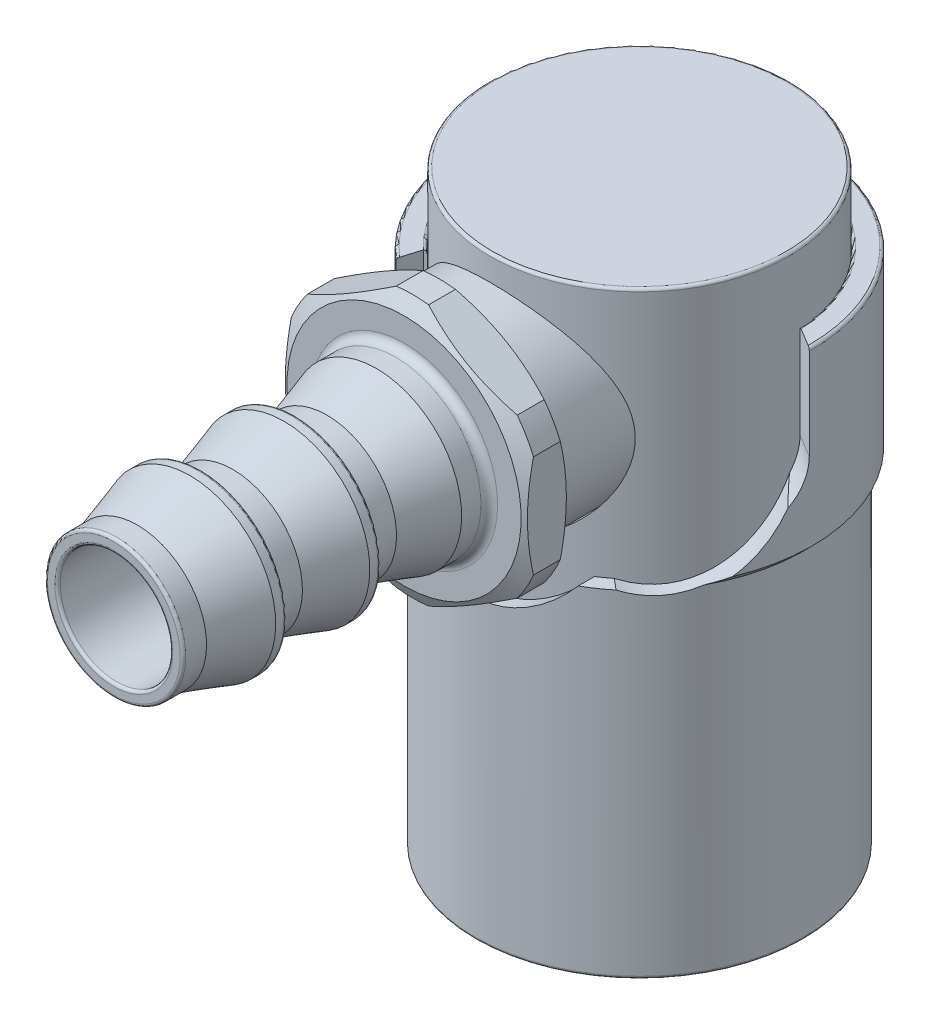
ISO-10303-21;
HEADER;
FILE_DESCRIPTION(('STEP AP214'),'2;1');
FILE_NAME('part.step','',(''),(''),'','','');
FILE_SCHEMA(('AUTOMOTIVE_DESIGN { 1 0 10303 214 1 1 1 1 }'));
ENDSEC;
DATA;
#1=APPLICATION_CONTEXT('core data for automotive mechanical design processes');
#2=APPLICATION_PROTOCOL_DEFINITION('international standard','automotive_design',2000,#1);
#3=PRODUCT_CONTEXT('',#1,'mechanical');
#4=PRODUCT('Part','Part','',(#3));
#5=PRODUCT_RELATED_PRODUCT_CATEGORY('part','',(#4));
#6=PRODUCT_DEFINITION_FORMATION('','',#4);
#7=PRODUCT_DEFINITION_CONTEXT('part definition',#1,'design');
#8=PRODUCT_DEFINITION('design','',#6,#7);
#9=PRODUCT_DEFINITION_SHAPE('','',#8);
#10=(LENGTH_UNIT() NAMED_UNIT(*) SI_UNIT(.MILLI.,.METRE.));
#11=(NAMED_UNIT(*) PLANE_ANGLE_UNIT() SI_UNIT($,.RADIAN.));
#12=(NAMED_UNIT(*) SI_UNIT($,.STERADIAN.) SOLID_ANGLE_UNIT());
#13=UNCERTAINTY_MEASURE_WITH_UNIT(LENGTH_MEASURE(1.E-05),#10,'distance_accuracy_value','');
#14=(GEOMETRIC_REPRESENTATION_CONTEXT(3) GLOBAL_UNCERTAINTY_ASSIGNED_CONTEXT((#13)) GLOBAL_UNIT_ASSIGNED_CONTEXT((#10,
#11,#12)) REPRESENTATION_CONTEXT('',''));
#15=CARTESIAN_POINT('',(0.,0.,0.));
#16=DIRECTION('',(0.,0.,1.));
#17=DIRECTION('',(1.,0.,0.));
#18=AXIS2_PLACEMENT_3D('',#15,#16,#17);
#19=CARTESIAN_POINT('',(0.,27.6882256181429,0.));
#20=DIRECTION('',(0.,1.,0.));
#21=DIRECTION('',(0.,0.,1.));
#22=AXIS2_PLACEMENT_3D('',#19,#20,#21);
#23=CYLINDRICAL_SURFACE('',#22,10.668);
#24=CARTESIAN_POINT('',(0.,17.6276,0.));
#25=DIRECTION('',(0.,1.,0.));
#26=DIRECTION('',(0.,0.,1.));
#27=AXIS2_PLACEMENT_3D('',#24,#25,#26);
#28=CIRCLE('',#27,10.668);
#29=CARTESIAN_POINT('',(0.,17.6276,10.668));
#30=VERTEX_POINT('',#29);
#31=EDGE_CURVE('P0_E10',#30,#30,#28,.T.);
#32=ORIENTED_EDGE('',*,*,#31,.T.);
#33=EDGE_LOOP('',(#32));
#34=FACE_BOUND('',#33,.T.);
#35=CARTESIAN_POINT('',(0.,23.9776,0.));
#36=DIRECTION('',(0.,1.,0.));
#37=DIRECTION('',(0.,0.,1.));
#38=AXIS2_PLACEMENT_3D('',#35,#36,#37);
#39=CIRCLE('',#38,10.668);
#40=CARTESIAN_POINT('',(0.,23.9776,10.668));
#41=VERTEX_POINT('',#40);
#42=EDGE_CURVE('P0_E44',#41,#41,#39,.T.);
#43=ORIENTED_EDGE('',*,*,#42,.F.);
#44=EDGE_LOOP('',(#43));
#45=FACE_BOUND('',#44,.T.);
#46=ADVANCED_FACE('P0_F30',(#34,#45),#23,.T.);
#47=CARTESIAN_POINT('',(0.,17.6276,10.668));
#48=DIRECTION('',(0.,-1.,0.));
#49=DIRECTION('',(0.,0.,-1.));
#50=AXIS2_PLACEMENT_3D('',#47,#48,#49);
#51=PLANE('',#50);
#52=CARTESIAN_POINT('',(0.,17.6276,0.));
#53=DIRECTION('',(0.,1.,0.));
#54=DIRECTION('',(0.,0.,1.));
#55=AXIS2_PLACEMENT_3D('',#52,#53,#54);
#56=CIRCLE('',#55,7.9248);
#57=CARTESIAN_POINT('',(0.,17.6276,7.9248));
#58=VERTEX_POINT('',#57);
#59=EDGE_CURVE('P0_E36',#58,#58,#56,.T.);
#60=ORIENTED_EDGE('',*,*,#59,.T.);
#61=EDGE_LOOP('',(#60));
#62=FACE_BOUND('',#61,.T.);
#63=ORIENTED_EDGE('',*,*,#31,.F.);
#64=EDGE_LOOP('',(#63));
#65=FACE_BOUND('',#64,.T.);
#66=ADVANCED_FACE('P0_F54',(#62,#65),#51,.T.);
#67=CARTESIAN_POINT('',(0.,27.6882256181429,0.));
#68=DIRECTION('',(0.,1.,0.));
#69=DIRECTION('',(0.,0.,1.));
#70=AXIS2_PLACEMENT_3D('',#67,#68,#69);
#71=CYLINDRICAL_SURFACE('',#70,7.9248);
#72=CARTESIAN_POINT('',(0.,23.9776,0.));
#73=DIRECTION('',(0.,1.,0.));
#74=DIRECTION('',(0.,0.,1.));
#75=AXIS2_PLACEMENT_3D('',#72,#73,#74);
#76=CIRCLE('',#75,7.9248);
#77=CARTESIAN_POINT('',(0.,23.9776,7.9248));
#78=VERTEX_POINT('',#77);
#79=EDGE_CURVE('P0_E40',#78,#78,#76,.T.);
#80=ORIENTED_EDGE('',*,*,#79,.T.);
#81=EDGE_LOOP('',(#80));
#82=FACE_BOUND('',#81,.T.);
#83=ORIENTED_EDGE('',*,*,#59,.F.);
#84=EDGE_LOOP('',(#83));
#85=FACE_BOUND('',#84,.T.);
#86=ADVANCED_FACE('P0_F58',(#82,#85),#71,.F.);
#87=CARTESIAN_POINT('',(0.,23.9776,10.668));
#88=DIRECTION('',(0.,1.,0.));
#89=DIRECTION('',(0.,0.,1.));
#90=AXIS2_PLACEMENT_3D('',#87,#88,#89);
#91=PLANE('',#90);
#92=ORIENTED_EDGE('',*,*,#42,.T.);
#93=EDGE_LOOP('',(#92));
#94=FACE_BOUND('',#93,.T.);
#95=ORIENTED_EDGE('',*,*,#79,.F.);
#96=EDGE_LOOP('',(#95));
#97=FACE_BOUND('',#96,.T.);
#98=ADVANCED_FACE('P0_F50',(#94,#97),#91,.T.);
#99=CLOSED_SHELL('',(#46,#66,#86,#98));
#100=MANIFOLD_SOLID_BREP('P0_B2',#99);
#101=CARTESIAN_POINT('',(0.,48.566779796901,31.6102616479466));
#102=DIRECTION('',(0.,0.,-1.));
#103=DIRECTION('',(0.,1.,0.));
#104=AXIS2_PLACEMENT_3D('',#101,#102,#103);
#105=PLANE('',#104);
#106=CARTESIAN_POINT('',(0.,42.1767383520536,31.6102616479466));
#107=DIRECTION('',(0.,0.,-1.));
#108=DIRECTION('',(0.,1.,0.));
#109=AXIS2_PLACEMENT_3D('',#106,#107,#108);
#110=CIRCLE('',#109,6.39004144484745);
#111=CARTESIAN_POINT('',(0.,48.566779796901,31.6102616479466));
#112=VERTEX_POINT('',#111);
#113=EDGE_CURVE('P1_E20',#112,#112,#110,.T.);
#114=ORIENTED_EDGE('',*,*,#113,.F.);
#115=EDGE_LOOP('',(#114));
#116=FACE_BOUND('',#115,.T.);
#117=CARTESIAN_POINT('',(0.,42.1767383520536,31.6102616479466));
#118=DIRECTION('',(0.,0.,1.));
#119=DIRECTION('',(0.,1.,0.));
#120=AXIS2_PLACEMENT_3D('',#117,#118,#119);
#121=CIRCLE('',#120,7.61757490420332);
#122=CARTESIAN_POINT('',(0.,49.7943132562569,31.6102616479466));
#123=VERTEX_POINT('',#122);
#124=CARTESIAN_POINT('',(0.,34.5591634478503,31.6102616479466));
#125=VERTEX_POINT('',#124);
#126=EDGE_CURVE('P1_E713',#123,#125,#121,.T.);
#127=ORIENTED_EDGE('',*,*,#126,.F.);
#128=CARTESIAN_POINT('',(0.,42.1767383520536,31.6102616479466));
#129=DIRECTION('',(0.,0.,1.));
#130=DIRECTION('',(0.,-1.,0.));
#131=AXIS2_PLACEMENT_3D('',#128,#129,#130);
#132=CIRCLE('',#131,7.61757490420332);
#133=EDGE_CURVE('P1_E711',#125,#123,#132,.T.);
#134=ORIENTED_EDGE('',*,*,#133,.F.);
#135=EDGE_LOOP('',(#127,#134));
#136=FACE_BOUND('',#135,.T.);
#137=ADVANCED_FACE('P1_F16',(#116,#136),#105,.T.);
#138=CARTESIAN_POINT('',(0.,42.1767383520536,30.1497616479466));
#139=DIRECTION('',(0.,0.,-1.));
#140=DIRECTION('',(0.,1.,0.));
#141=AXIS2_PLACEMENT_3D('',#138,#139,#140);
#142=CYLINDRICAL_SURFACE('',#141,6.39004144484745);
#143=ORIENTED_EDGE('',*,*,#113,.T.);
#144=EDGE_LOOP('',(#143));
#145=FACE_BOUND('',#144,.T.);
#146=CARTESIAN_POINT('',(0.,42.1767383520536,28.6892616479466));
#147=DIRECTION('',(0.,0.,-1.));
#148=DIRECTION('',(0.,1.,0.));
#149=AXIS2_PLACEMENT_3D('',#146,#147,#148);
#150=CIRCLE('',#149,6.39004144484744);
#151=CARTESIAN_POINT('',(0.,48.566779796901,28.6892616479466));
#152=VERTEX_POINT('',#151);
#153=EDGE_CURVE('P1_E682',#152,#152,#150,.T.);
#154=ORIENTED_EDGE('',*,*,#153,.F.);
#155=EDGE_LOOP('',(#154));
#156=FACE_BOUND('',#155,.T.);
#157=ADVANCED_FACE('P1_F690',(#145,#156),#142,.T.);
#158=CARTESIAN_POINT('',(0.,42.1767383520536,31.8642616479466));
#159=DIRECTION('',(0.,0.,-1.));
#160=DIRECTION('',(0.,1.,0.));
#161=AXIS2_PLACEMENT_3D('',#158,#159,#160);
#162=TOROIDAL_SURFACE('',#161,7.61757490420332,0.254);
#163=CARTESIAN_POINT('',(0.,42.1767383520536,31.8642616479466));
#164=DIRECTION('',(0.,0.,-1.));
#165=DIRECTION('',(0.,1.,0.));
#166=AXIS2_PLACEMENT_3D('',#163,#164,#165);
#167=CIRCLE('',#166,7.87157490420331);
#168=CARTESIAN_POINT('',(0.,50.0483132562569,31.8642616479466));
#169=VERTEX_POINT('',#168);
#170=EDGE_CURVE('P1_E673',#169,#169,#167,.F.);
#171=ORIENTED_EDGE('',*,*,#170,.F.);
#172=EDGE_LOOP('',(#171));
#173=FACE_BOUND('',#172,.T.);
#174=ORIENTED_EDGE('',*,*,#126,.T.);
#175=ORIENTED_EDGE('',*,*,#133,.T.);
#176=EDGE_LOOP('',(#174,#175));
#177=FACE_BOUND('',#176,.T.);
#178=ADVANCED_FACE('P1_F685',(#173,#177),#162,.T.);
#179=CARTESIAN_POINT('',(0.,42.1767383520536,24.1426616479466));
#180=DIRECTION('',(0.,0.,-1.));
#181=DIRECTION('',(0.,1.,0.));
#182=AXIS2_PLACEMENT_3D('',#179,#180,#181);
#183=CONICAL_SURFACE('',#182,7.82352517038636,0.305421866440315);
#184=ORIENTED_EDGE('',*,*,#153,.T.);
#185=EDGE_LOOP('',(#184));
#186=FACE_BOUND('',#185,.T.);
#187=CARTESIAN_POINT('',(0.,42.1767383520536,24.1426616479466));
#188=DIRECTION('',(0.,0.,-1.));
#189=DIRECTION('',(0.,1.,0.));
#190=AXIS2_PLACEMENT_3D('',#187,#188,#189);
#191=CIRCLE('',#190,7.82352517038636);
#192=CARTESIAN_POINT('',(0.,50.0002635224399,24.1426616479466));
#193=VERTEX_POINT('',#192);
#194=EDGE_CURVE('P1_E669',#193,#193,#191,.T.);
#195=ORIENTED_EDGE('',*,*,#194,.F.);
#196=EDGE_LOOP('',(#195));
#197=FACE_BOUND('',#196,.T.);
#198=ADVANCED_FACE('P1_F689',(#186,#197),#183,.T.);
#199=CARTESIAN_POINT('',(0.,42.1767383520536,32.1182616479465));
#200=DIRECTION('',(0.,0.,-1.));
#201=DIRECTION('',(0.,1.,0.));
#202=AXIS2_PLACEMENT_3D('',#199,#200,#201);
#203=CYLINDRICAL_SURFACE('',#202,7.87157490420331);
#204=CARTESIAN_POINT('',(0.,42.1767383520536,32.6262616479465));
#205=DIRECTION('',(0.,0.,-1.));
#206=DIRECTION('',(0.,1.,0.));
#207=AXIS2_PLACEMENT_3D('',#204,#205,#206);
#208=CIRCLE('',#207,7.87157490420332);
#209=CARTESIAN_POINT('',(0.,50.0483132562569,32.6262616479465));
#210=VERTEX_POINT('',#209);
#211=EDGE_CURVE('P1_E667',#210,#210,#208,.F.);
#212=ORIENTED_EDGE('',*,*,#211,.F.);
#213=EDGE_LOOP('',(#212));
#214=FACE_BOUND('',#213,.T.);
#215=ORIENTED_EDGE('',*,*,#170,.T.);
#216=EDGE_LOOP('',(#215));
#217=FACE_BOUND('',#216,.T.);
#218=ADVANCED_FACE('P1_F741',(#214,#217),#203,.T.);
#219=CARTESIAN_POINT('',(0.,42.1767383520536,22.8726616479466));
#220=DIRECTION('',(0.,0.,-1.));
#221=DIRECTION('',(0.,1.,0.));
#222=AXIS2_PLACEMENT_3D('',#219,#220,#221);
#223=CYLINDRICAL_SURFACE('',#222,7.82352517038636);
#224=ORIENTED_EDGE('',*,*,#194,.T.);
#225=EDGE_LOOP('',(#224));
#226=FACE_BOUND('',#225,.T.);
#227=CARTESIAN_POINT('',(0.,42.1767383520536,22.3646616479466));
#228=DIRECTION('',(0.,0.,-1.));
#229=DIRECTION('',(0.,1.,0.));
#230=AXIS2_PLACEMENT_3D('',#227,#228,#229);
#231=CIRCLE('',#230,7.82352517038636);
#232=CARTESIAN_POINT('',(0.,50.0002635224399,22.3646616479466));
#233=VERTEX_POINT('',#232);
#234=EDGE_CURVE('P1_E624',#233,#233,#231,.F.);
#235=ORIENTED_EDGE('',*,*,#234,.T.);
#236=EDGE_LOOP('',(#235));
#237=FACE_BOUND('',#236,.T.);
#238=ADVANCED_FACE('P1_F664',(#226,#237),#223,.T.);
#239=CARTESIAN_POINT('',(0.,42.1767383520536,32.6262616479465));
#240=DIRECTION('',(0.,0.,-1.));
#241=DIRECTION('',(0.,1.,0.));
#242=AXIS2_PLACEMENT_3D('',#239,#240,#241);
#243=CONICAL_SURFACE('',#242,7.87157490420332,0.305421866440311);
#244=CARTESIAN_POINT('',(0.,42.1767383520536,37.3252616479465));
#245=DIRECTION('',(0.,0.,-1.));
#246=DIRECTION('',(0.,1.,0.));
#247=AXIS2_PLACEMENT_3D('',#244,#245,#246);
#248=CIRCLE('',#247,6.39004144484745);
#249=CARTESIAN_POINT('',(0.,48.566779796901,37.3252616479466));
#250=VERTEX_POINT('',#249);
#251=EDGE_CURVE('P1_E616',#250,#250,#248,.F.);
#252=ORIENTED_EDGE('',*,*,#251,.F.);
#253=EDGE_LOOP('',(#252));
#254=FACE_BOUND('',#253,.T.);
#255=ORIENTED_EDGE('',*,*,#211,.T.);
#256=EDGE_LOOP('',(#255));
#257=FACE_BOUND('',#256,.T.);
#258=ADVANCED_FACE('P1_F636',(#254,#257),#243,.T.);
#259=CARTESIAN_POINT('',(0.,42.1767383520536,22.3646616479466));
#260=DIRECTION('',(0.,0.,-1.));
#261=DIRECTION('',(0.,1.,0.));
#262=AXIS2_PLACEMENT_3D('',#259,#260,#261);
#263=TOROIDAL_SURFACE('',#262,8.58552517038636,0.762);
#264=CARTESIAN_POINT('',(0.,42.1767383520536,21.6026616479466));
#265=DIRECTION('',(0.,0.,1.));
#266=DIRECTION('',(0.,1.,0.));
#267=AXIS2_PLACEMENT_3D('',#264,#265,#266);
#268=CIRCLE('',#267,8.58552517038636);
#269=CARTESIAN_POINT('',(0.,33.5912131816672,21.6026616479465));
#270=VERTEX_POINT('',#269);
#271=CARTESIAN_POINT('',(0.,50.7622635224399,21.6026616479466));
#272=VERTEX_POINT('',#271);
#273=EDGE_CURVE('P1_E601',#270,#272,#268,.F.);
#274=ORIENTED_EDGE('',*,*,#273,.F.);
#275=CARTESIAN_POINT('',(0.,42.1767383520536,21.6026616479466));
#276=DIRECTION('',(0.,0.,1.));
#277=DIRECTION('',(0.,-1.,0.));
#278=AXIS2_PLACEMENT_3D('',#275,#276,#277);
#279=CIRCLE('',#278,8.58552517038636);
#280=EDGE_CURVE('P1_E612',#272,#270,#279,.F.);
#281=ORIENTED_EDGE('',*,*,#280,.F.);
#282=EDGE_LOOP('',(#274,#281));
#283=FACE_BOUND('',#282,.T.);
#284=ORIENTED_EDGE('',*,*,#234,.F.);
#285=EDGE_LOOP('',(#284));
#286=FACE_BOUND('',#285,.T.);
#287=ADVANCED_FACE('P1_F631',(#283,#286),#263,.F.);
#288=CARTESIAN_POINT('',(0.,42.1767383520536,38.7857616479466));
#289=DIRECTION('',(0.,0.,-1.));
#290=DIRECTION('',(0.,1.,0.));
#291=AXIS2_PLACEMENT_3D('',#288,#289,#290);
#292=CYLINDRICAL_SURFACE('',#291,6.39004144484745);
#293=CARTESIAN_POINT('',(0.,42.1767383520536,40.2462616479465));
#294=DIRECTION('',(0.,0.,-1.));
#295=DIRECTION('',(0.,1.,0.));
#296=AXIS2_PLACEMENT_3D('',#293,#294,#295);
#297=CIRCLE('',#296,6.39004144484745);
#298=CARTESIAN_POINT('',(0.,48.566779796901,40.2462616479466));
#299=VERTEX_POINT('',#298);
#300=EDGE_CURVE('P1_E542',#299,#299,#297,.F.);
#301=ORIENTED_EDGE('',*,*,#300,.F.);
#302=EDGE_LOOP('',(#301));
#303=FACE_BOUND('',#302,.T.);
#304=ORIENTED_EDGE('',*,*,#251,.T.);
#305=EDGE_LOOP('',(#304));
#306=FACE_BOUND('',#305,.T.);
#307=ADVANCED_FACE('P1_F635',(#303,#306),#292,.T.);
#308=CARTESIAN_POINT('',(0.,54.2417383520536,21.6026616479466));
#309=DIRECTION('',(0.,0.,1.));
#310=DIRECTION('',(0.,-1.,0.));
#311=AXIS2_PLACEMENT_3D('',#308,#309,#310);
#312=PLANE('',#311);
#313=ORIENTED_EDGE('',*,*,#273,.T.);
#314=ORIENTED_EDGE('',*,*,#280,.T.);
#315=EDGE_LOOP('',(#313,#314));
#316=FACE_BOUND('',#315,.T.);
#317=CARTESIAN_POINT('',(0.,42.1767383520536,21.6026616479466));
#318=DIRECTION('',(0.,0.,-1.));
#319=DIRECTION('',(0.,1.,0.));
#320=AXIS2_PLACEMENT_3D('',#317,#318,#319);
#321=CIRCLE('',#320,10.7451772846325);
#322=CARTESIAN_POINT('',(0.,52.9219156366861,21.6026616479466));
#323=VERTEX_POINT('',#322);
#324=EDGE_CURVE('P1_E156',#323,#323,#321,.T.);
#325=ORIENTED_EDGE('',*,*,#324,.F.);
#326=EDGE_LOOP('',(#325));
#327=FACE_BOUND('',#326,.T.);
#328=ADVANCED_FACE('P1_F566',(#316,#327),#312,.T.);
#329=CARTESIAN_POINT('',(0.,48.566779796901,40.2462616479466));
#330=DIRECTION('',(0.,0.,-1.));
#331=DIRECTION('',(0.,1.,0.));
#332=AXIS2_PLACEMENT_3D('',#329,#330,#331);
#333=PLANE('',#332);
#334=ORIENTED_EDGE('',*,*,#300,.T.);
#335=EDGE_LOOP('',(#334));
#336=FACE_BOUND('',#335,.T.);
#337=CARTESIAN_POINT('',(0.,42.1767383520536,40.2462616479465));
#338=DIRECTION('',(0.,0.,1.));
#339=DIRECTION('',(0.,1.,0.));
#340=AXIS2_PLACEMENT_3D('',#337,#338,#339);
#341=CIRCLE('',#340,7.61757490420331);
#342=CARTESIAN_POINT('',(0.,49.7943132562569,40.2462616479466));
#343=VERTEX_POINT('',#342);
#344=CARTESIAN_POINT('',(0.,34.5591634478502,40.2462616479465));
#345=VERTEX_POINT('',#344);
#346=EDGE_CURVE('P1_E166',#343,#345,#341,.T.);
#347=ORIENTED_EDGE('',*,*,#346,.F.);
#348=CARTESIAN_POINT('',(0.,42.1767383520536,40.2462616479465));
#349=DIRECTION('',(0.,0.,1.));
#350=DIRECTION('',(0.,-1.,0.));
#351=AXIS2_PLACEMENT_3D('',#348,#349,#350);
#352=CIRCLE('',#351,7.61757490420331);
#353=EDGE_CURVE('P1_E155',#345,#343,#352,.T.);
#354=ORIENTED_EDGE('',*,*,#353,.F.);
#355=EDGE_LOOP('',(#347,#354));
#356=FACE_BOUND('',#355,.T.);
#357=ADVANCED_FACE('P1_F557',(#336,#356),#333,.T.);
#358=CARTESIAN_POINT('',(0.,42.1767383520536,19.6214616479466));
#359=DIRECTION('',(0.,0.,-1.));
#360=DIRECTION('',(0.,1.,0.));
#361=AXIS2_PLACEMENT_3D('',#358,#359,#360);
#362=CYLINDRICAL_SURFACE('',#361,12.065);
#363=CARTESIAN_POINT('',(0.,42.1767383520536,20.8406616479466));
#364=DIRECTION('',(0.,0.,-1.));
#365=DIRECTION('',(0.,-1.,0.));
#366=AXIS2_PLACEMENT_3D('',#363,#364,#365);
#367=CIRCLE('',#366,12.065);
#368=CARTESIAN_POINT('',(1.48716821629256,54.1497311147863,20.8406616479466));
#369=VERTEX_POINT('',#368);
#370=CARTESIAN_POINT('',(-1.48716821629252,54.1497311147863,20.8406616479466));
#371=VERTEX_POINT('',#370);
#372=EDGE_CURVE('P1_E146',#369,#371,#367,.F.);
#373=ORIENTED_EDGE('',*,*,#372,.F.);
#374=DIRECTION('',(0.,0.,1.));
#375=VECTOR('',#374,1.);
#376=CARTESIAN_POINT('',(1.48716821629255,54.1497311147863,8.36926164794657));
#377=LINE('',#376,#375);
#378=CARTESIAN_POINT('',(1.48716821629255,54.1497311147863,18.3734964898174));
#379=VERTEX_POINT('',#378);
#380=EDGE_CURVE('P1_E148',#369,#379,#377,.F.);
#381=ORIENTED_EDGE('',*,*,#380,.T.);
#382=CARTESIAN_POINT('',(0.,42.1767383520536,18.3734964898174));
#383=DIRECTION('',(0.,0.,-1.));
#384=DIRECTION('',(0.,1.,0.));
#385=AXIS2_PLACEMENT_3D('',#382,#383,#384);
#386=CIRCLE('',#385,12.065);
#387=CARTESIAN_POINT('',(-1.48716821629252,54.1497311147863,18.3734964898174));
#388=VERTEX_POINT('',#387);
#389=EDGE_CURVE('P1_E540',#379,#388,#386,.F.);
#390=ORIENTED_EDGE('',*,*,#389,.T.);
#391=DIRECTION('',(0.,0.,1.));
#392=VECTOR('',#391,1.);
#393=CARTESIAN_POINT('',(-1.48716821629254,54.1497311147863,8.36926164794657));
#394=LINE('',#393,#392);
#395=EDGE_CURVE('P1_E151',#388,#371,#394,.T.);
#396=ORIENTED_EDGE('',*,*,#395,.T.);
#397=EDGE_LOOP('',(#373,#381,#390,#396));
#398=FACE_BOUND('',#397,.T.);
#399=ADVANCED_FACE('P1_F147',(#398),#362,.T.);
#400=CARTESIAN_POINT('',(0.,42.1767383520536,20.8406616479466));
#401=DIRECTION('',(0.,0.,-1.));
#402=DIRECTION('',(0.,1.,0.));
#403=AXIS2_PLACEMENT_3D('',#400,#401,#402);
#404=CONICAL_SURFACE('',#403,12.065,1.0471975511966);
#405=ORIENTED_EDGE('',*,*,#324,.T.);
#406=EDGE_LOOP('',(#405));
#407=FACE_BOUND('',#406,.T.);
#408=CARTESIAN_POINT('',(-1.48716821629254,54.1497311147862,20.8406616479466));
#409=CARTESIAN_POINT('',(-1.72029594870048,54.015134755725,20.901198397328));
#410=CARTESIAN_POINT('',(-1.95427114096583,53.8800491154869,20.9575223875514));
#411=CARTESIAN_POINT('',(-2.42381592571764,53.6089573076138,21.0608966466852));
#412=CARTESIAN_POINT('',(-2.65938594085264,53.4729508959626,21.1079443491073));
#413=CARTESIAN_POINT('',(-3.13208815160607,53.2000361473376,21.1919184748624));
#414=CARTESIAN_POINT('',(-3.3692214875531,53.0631271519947,21.2288364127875));
#415=CARTESIAN_POINT('',(-3.84455608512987,52.7886925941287,21.2917458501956));
#416=CARTESIAN_POINT('',(-4.08275724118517,52.6511670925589,21.3177384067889));
#417=CARTESIAN_POINT('',(-4.55561917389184,52.3781601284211,21.3578612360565));
#418=CARTESIAN_POINT('',(-4.79026687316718,52.2426862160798,21.3721957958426));
#419=CARTESIAN_POINT('',(-5.25987613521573,51.9715571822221,21.389449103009));
#420=CARTESIAN_POINT('',(-5.49483769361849,51.8359020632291,21.3923680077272));
#421=CARTESIAN_POINT('',(-5.96450378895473,51.5647402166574,21.3867243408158));
#422=CARTESIAN_POINT('',(-6.19920839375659,51.4292334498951,21.3781692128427));
#423=CARTESIAN_POINT('',(-6.66808438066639,51.1585277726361,21.3497883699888));
#424=CARTESIAN_POINT('',(-6.90225580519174,51.0233288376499,21.3299635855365));
#425=CARTESIAN_POINT('',(-7.34449869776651,50.7679997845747,21.2822079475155));
#426=CARTESIAN_POINT('',(-7.55266081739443,50.6478173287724,21.2553821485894));
#427=CARTESIAN_POINT('',(-7.96806267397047,50.4079849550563,21.1935569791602));
#428=CARTESIAN_POINT('',(-8.17530244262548,50.2883350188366,21.1585578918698));
#429=CARTESIAN_POINT('',(-8.59040838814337,50.0486734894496,21.0805923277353));
#430=CARTESIAN_POINT('',(-8.79826555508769,49.9286670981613,21.0375623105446));
#431=CARTESIAN_POINT('',(-9.212744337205,49.6893676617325,20.9443363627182));
#432=CARTESIAN_POINT('',(-9.41936611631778,49.5700745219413,20.8941414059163));
#433=CARTESIAN_POINT('',(-9.62533178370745,49.45116018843,20.8406616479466));
#434=B_SPLINE_CURVE_WITH_KNOTS('',3,(#408,#409,#410,#411,#412,#413,#414,#415,#416,#417,#418,
#419,#420,#421,#422,#423,#424,#425,#426,#427,#428,#429,#430,#431,#432,#433),.UNSPECIFIED.,.F.,
.F.,(4,2,2,2,2,2,2,2,2,2,2,2,4),(0.,0.827758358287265,1.65574541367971,2.48442394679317,
3.31302228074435,4.12676744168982,4.94050138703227,5.75370768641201,6.56684685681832,
7.29227447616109,8.01767696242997,8.74908282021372,9.48038936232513),.UNSPECIFIED.);
#435=CARTESIAN_POINT('',(-9.62533178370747,49.45116018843,20.8406616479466));
#436=VERTEX_POINT('',#435);
#437=EDGE_CURVE('P1_E199',#371,#436,#434,.T.);
#438=ORIENTED_EDGE('',*,*,#437,.T.);
#439=CARTESIAN_POINT('',(0.,42.1767383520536,20.8406616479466));
#440=DIRECTION('',(0.,0.,-1.));
#441=DIRECTION('',(0.,1.,0.));
#442=AXIS2_PLACEMENT_3D('',#439,#440,#441);
#443=CIRCLE('',#442,12.065);
#444=CARTESIAN_POINT('',(-11.1125,46.8753092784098,20.8406616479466));
#445=VERTEX_POINT('',#444);
#446=EDGE_CURVE('P1_E503',#445,#436,#443,.T.);
#447=ORIENTED_EDGE('',*,*,#446,.F.);
#448=CARTESIAN_POINT('',(-11.1125,46.8753092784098,20.8406616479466));
#449=CARTESIAN_POINT('',(-11.1125,46.6061165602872,20.901198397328));
#450=CARTESIAN_POINT('',(-11.1125,46.335945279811,20.9575223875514));
#451=CARTESIAN_POINT('',(-11.1125,45.7937616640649,21.0608966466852));
#452=CARTESIAN_POINT('',(-11.1125,45.5217488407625,21.1079443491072));
#453=CARTESIAN_POINT('',(-11.1125,44.9759193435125,21.1919184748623));
#454=CARTESIAN_POINT('',(-11.1125,44.7021013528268,21.2288364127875));
#455=CARTESIAN_POINT('',(-11.1125,44.1532322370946,21.2917458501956));
#456=CARTESIAN_POINT('',(-11.1125,43.878181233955,21.3177384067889));
#457=CARTESIAN_POINT('',(-11.1125,43.3321673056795,21.3578612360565));
#458=CARTESIAN_POINT('',(-11.1125,43.0612194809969,21.3721957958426));
#459=CARTESIAN_POINT('',(-11.1125,42.5189614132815,21.389449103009));
#460=CARTESIAN_POINT('',(-11.1125,42.2476511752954,21.3923680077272));
#461=CARTESIAN_POINT('',(-11.1125,41.7053274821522,21.3867243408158));
#462=CARTESIAN_POINT('',(-11.1125,41.4343139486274,21.3781692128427));
#463=CARTESIAN_POINT('',(-11.1125,40.8929025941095,21.3497883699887));
#464=CARTESIAN_POINT('',(-11.1125,40.6225047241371,21.3299635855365));
#465=CARTESIAN_POINT('',(-11.1125,40.1118466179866,21.2822079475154));
#466=CARTESIAN_POINT('',(-11.1125,39.871481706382,21.2553821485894));
#467=CARTESIAN_POINT('',(-11.1125,39.39181695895,21.1935569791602));
#468=CARTESIAN_POINT('',(-11.1125,39.1525170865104,21.1585578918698));
#469=CARTESIAN_POINT('',(-11.1125,38.6731940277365,21.0805923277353));
#470=CARTESIAN_POINT('',(-11.1125,38.4331812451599,21.0375623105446));
#471=CARTESIAN_POINT('',(-11.1125,37.9545823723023,20.9443363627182));
#472=CARTESIAN_POINT('',(-11.1125,37.7159960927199,20.8941414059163));
#473=CARTESIAN_POINT('',(-11.1125,37.4781674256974,20.8406616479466));
#474=B_SPLINE_CURVE_WITH_KNOTS('',3,(#448,#449,#450,#451,#452,#453,#454,#455,#456,#457,#458,
#459,#460,#461,#462,#463,#464,#465,#466,#467,#468,#469,#470,#471,#472,#473),.UNSPECIFIED.,.F.,
.F.,(4,2,2,2,2,2,2,2,2,2,2,2,4),(0.,0.827758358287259,1.65574541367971,2.48442394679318,
3.31302228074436,4.12676744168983,4.94050138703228,5.75370768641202,6.56684685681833,
7.29227447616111,8.01767696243,8.74908282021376,9.48038936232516),.UNSPECIFIED.);
#475=CARTESIAN_POINT('',(-11.1125,37.4781674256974,20.8406616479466));
#476=VERTEX_POINT('',#475);
#477=EDGE_CURVE('P1_E208',#445,#476,#474,.T.);
#478=ORIENTED_EDGE('',*,*,#477,.T.);
#479=CARTESIAN_POINT('',(0.,42.1767383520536,20.8406616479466));
#480=DIRECTION('',(0.,0.,-1.));
#481=DIRECTION('',(0.,1.,0.));
#482=AXIS2_PLACEMENT_3D('',#479,#480,#481);
#483=CIRCLE('',#482,12.065);
#484=CARTESIAN_POINT('',(-9.62533178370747,34.9023165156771,20.8406616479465));
#485=VERTEX_POINT('',#484);
#486=EDGE_CURVE('P1_E515',#485,#476,#483,.T.);
#487=ORIENTED_EDGE('',*,*,#486,.F.);
#488=CARTESIAN_POINT('',(-9.62533178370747,34.9023165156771,20.8406616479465));
#489=CARTESIAN_POINT('',(-9.39220405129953,34.7677201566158,20.9011983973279));
#490=CARTESIAN_POINT('',(-9.15822885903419,34.6326345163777,20.9575223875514));
#491=CARTESIAN_POINT('',(-8.68868407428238,34.3615427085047,21.0608966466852));
#492=CARTESIAN_POINT('',(-8.45311405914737,34.2255362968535,21.1079443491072));
#493=CARTESIAN_POINT('',(-7.98041184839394,33.9526215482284,21.1919184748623));
#494=CARTESIAN_POINT('',(-7.74327851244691,33.8157125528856,21.2288364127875));
#495=CARTESIAN_POINT('',(-7.26794391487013,33.5412779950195,21.2917458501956));
#496=CARTESIAN_POINT('',(-7.02974275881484,33.4037524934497,21.3177384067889));
#497=CARTESIAN_POINT('',(-6.55688082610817,33.130745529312,21.3578612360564));
#498=CARTESIAN_POINT('',(-6.32223312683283,32.9952716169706,21.3721957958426));
#499=CARTESIAN_POINT('',(-5.85262386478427,32.724142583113,21.389449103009));
#500=CARTESIAN_POINT('',(-5.61766230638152,32.5884874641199,21.3923680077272));
#501=CARTESIAN_POINT('',(-5.14799621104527,32.3173256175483,21.3867243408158));
#502=CARTESIAN_POINT('',(-4.91329160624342,32.1818188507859,21.3781692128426));
#503=CARTESIAN_POINT('',(-4.44441561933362,31.911113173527,21.3497883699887));
#504=CARTESIAN_POINT('',(-4.21024419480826,31.7759142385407,21.3299635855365));
#505=CARTESIAN_POINT('',(-3.76800130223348,31.5205851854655,21.2822079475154));
#506=CARTESIAN_POINT('',(-3.55983918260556,31.4004027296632,21.2553821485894));
#507=CARTESIAN_POINT('',(-3.14443732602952,31.1605703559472,21.1935569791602));
#508=CARTESIAN_POINT('',(-2.93719755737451,31.0409204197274,21.1585578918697));
#509=CARTESIAN_POINT('',(-2.52209161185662,30.8012588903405,21.0805923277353));
#510=CARTESIAN_POINT('',(-2.3142344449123,30.6812524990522,21.0375623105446));
#511=CARTESIAN_POINT('',(-1.899755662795,30.4419530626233,20.9443363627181));
#512=CARTESIAN_POINT('',(-1.69313388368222,30.3226599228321,20.8941414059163));
#513=CARTESIAN_POINT('',(-1.48716821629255,30.2037455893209,20.8406616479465));
#514=B_SPLINE_CURVE_WITH_KNOTS('',3,(#488,#489,#490,#491,#492,#493,#494,#495,#496,#497,#498,
#499,#500,#501,#502,#503,#504,#505,#506,#507,#508,#509,#510,#511,#512,#513),.UNSPECIFIED.,.F.,
.F.,(4,2,2,2,2,2,2,2,2,2,2,2,4),(0.,0.827758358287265,1.65574541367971,2.48442394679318,
3.31302228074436,4.12676744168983,4.94050138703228,5.75370768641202,6.56684685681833,
7.29227447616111,8.01767696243,8.74908282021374,9.48038936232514),.UNSPECIFIED.);
#515=CARTESIAN_POINT('',(-1.48716821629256,30.2037455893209,20.8406616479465));
#516=VERTEX_POINT('',#515);
#517=EDGE_CURVE('P1_E215',#485,#516,#514,.T.);
#518=ORIENTED_EDGE('',*,*,#517,.T.);
#519=CARTESIAN_POINT('',(0.,42.1767383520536,20.8406616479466));
#520=DIRECTION('',(0.,0.,-1.));
#521=DIRECTION('',(0.,1.,0.));
#522=AXIS2_PLACEMENT_3D('',#519,#520,#521);
#523=CIRCLE('',#522,12.065);
#524=CARTESIAN_POINT('',(1.48716821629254,30.2037455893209,20.8406616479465));
#525=VERTEX_POINT('',#524);
#526=EDGE_CURVE('P1_E523',#525,#516,#523,.T.);
#527=ORIENTED_EDGE('',*,*,#526,.F.);
#528=CARTESIAN_POINT('',(1.48716821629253,30.2037455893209,20.8406616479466));
#529=CARTESIAN_POINT('',(1.72029594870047,30.3383419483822,20.9011983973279));
#530=CARTESIAN_POINT('',(1.95427114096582,30.4734275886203,20.9575223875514));
#531=CARTESIAN_POINT('',(2.42381592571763,30.7445193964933,21.0608966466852));
#532=CARTESIAN_POINT('',(2.65938594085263,30.8805258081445,21.1079443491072));
#533=CARTESIAN_POINT('',(3.13208815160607,31.1534405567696,21.1919184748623));
#534=CARTESIAN_POINT('',(3.36922148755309,31.2903495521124,21.2288364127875));
#535=CARTESIAN_POINT('',(3.84455608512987,31.5647841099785,21.2917458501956));
#536=CARTESIAN_POINT('',(4.08275724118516,31.7023096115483,21.3177384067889));
#537=CARTESIAN_POINT('',(4.55561917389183,31.975316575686,21.3578612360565));
#538=CARTESIAN_POINT('',(4.79026687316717,32.1107904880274,21.3721957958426));
#539=CARTESIAN_POINT('',(5.25987613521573,32.381919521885,21.389449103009));
#540=CARTESIAN_POINT('',(5.49483769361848,32.5175746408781,21.3923680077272));
#541=CARTESIAN_POINT('',(5.96450378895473,32.7887364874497,21.3867243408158));
#542=CARTESIAN_POINT('',(6.19920839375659,32.9242432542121,21.3781692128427));
#543=CARTESIAN_POINT('',(6.66808438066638,33.194948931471,21.3497883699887));
#544=CARTESIAN_POINT('',(6.90225580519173,33.3301478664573,21.3299635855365));
#545=CARTESIAN_POINT('',(7.34449869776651,33.5854769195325,21.2822079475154));
#546=CARTESIAN_POINT('',(7.55266081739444,33.7056593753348,21.2553821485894));
#547=CARTESIAN_POINT('',(7.96806267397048,33.9454917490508,21.1935569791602));
#548=CARTESIAN_POINT('',(8.17530244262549,34.0651416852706,21.1585578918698));
#549=CARTESIAN_POINT('',(8.59040838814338,34.3048032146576,21.0805923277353));
#550=CARTESIAN_POINT('',(8.7982655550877,34.4248096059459,21.0375623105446));
#551=CARTESIAN_POINT('',(9.212744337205,34.6641090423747,20.9443363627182));
#552=CARTESIAN_POINT('',(9.41936611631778,34.7834021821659,20.8941414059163));
#553=CARTESIAN_POINT('',(9.62533178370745,34.9023165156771,20.8406616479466));
#554=B_SPLINE_CURVE_WITH_KNOTS('',3,(#528,#529,#530,#531,#532,#533,#534,#535,#536,#537,#538,
#539,#540,#541,#542,#543,#544,#545,#546,#547,#548,#549,#550,#551,#552,#553),.UNSPECIFIED.,.F.,
.F.,(4,2,2,2,2,2,2,2,2,2,2,2,4),(0.,0.827758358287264,1.65574541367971,2.48442394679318,
3.31302228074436,4.12676744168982,4.94050138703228,5.75370768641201,6.56684685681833,
7.2922744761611,8.01767696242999,8.74908282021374,9.48038936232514),.UNSPECIFIED.);
#555=CARTESIAN_POINT('',(9.62533178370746,34.9023165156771,20.8406616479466));
#556=VERTEX_POINT('',#555);
#557=EDGE_CURVE('P1_E221',#525,#556,#554,.T.);
#558=ORIENTED_EDGE('',*,*,#557,.T.);
#559=CARTESIAN_POINT('',(0.,42.1767383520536,20.8406616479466));
#560=DIRECTION('',(0.,0.,-1.));
#561=DIRECTION('',(0.,1.,0.));
#562=AXIS2_PLACEMENT_3D('',#559,#560,#561);
#563=CIRCLE('',#562,12.065);
#564=CARTESIAN_POINT('',(11.1125,37.4781674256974,20.8406616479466));
#565=VERTEX_POINT('',#564);
#566=EDGE_CURVE('P1_E229',#565,#556,#563,.T.);
#567=ORIENTED_EDGE('',*,*,#566,.F.);
#568=CARTESIAN_POINT('',(11.1125,37.4781674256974,20.8406616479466));
#569=CARTESIAN_POINT('',(11.1125,37.7473601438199,20.9011983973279));
#570=CARTESIAN_POINT('',(11.1125,38.0175314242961,20.9575223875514));
#571=CARTESIAN_POINT('',(11.1125,38.5597150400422,21.0608966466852));
#572=CARTESIAN_POINT('',(11.1125,38.8317278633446,21.1079443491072));
#573=CARTESIAN_POINT('',(11.1125,39.3775573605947,21.1919184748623));
#574=CARTESIAN_POINT('',(11.1125,39.6513753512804,21.2288364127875));
#575=CARTESIAN_POINT('',(11.1125,40.2002444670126,21.2917458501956));
#576=CARTESIAN_POINT('',(11.1125,40.4752954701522,21.3177384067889));
#577=CARTESIAN_POINT('',(11.1125,41.0213093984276,21.3578612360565));
#578=CARTESIAN_POINT('',(11.1125,41.2922572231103,21.3721957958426));
#579=CARTESIAN_POINT('',(11.1125,41.8345152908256,21.389449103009));
#580=CARTESIAN_POINT('',(11.1125,42.1058255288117,21.3923680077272));
#581=CARTESIAN_POINT('',(11.1125,42.648149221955,21.3867243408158));
#582=CARTESIAN_POINT('',(11.1125,42.9191627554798,21.3781692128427));
#583=CARTESIAN_POINT('',(11.1125,43.4605741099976,21.3497883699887));
#584=CARTESIAN_POINT('',(11.1125,43.7309719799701,21.3299635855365));
#585=CARTESIAN_POINT('',(11.1125,44.2416300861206,21.2822079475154));
#586=CARTESIAN_POINT('',(11.1125,44.4819949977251,21.2553821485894));
#587=CARTESIAN_POINT('',(11.1125,44.9616597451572,21.1935569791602));
#588=CARTESIAN_POINT('',(11.1125,45.2009596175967,21.1585578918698));
#589=CARTESIAN_POINT('',(11.1125,45.6802826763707,21.0805923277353));
#590=CARTESIAN_POINT('',(11.1125,45.9202954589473,21.0375623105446));
#591=CARTESIAN_POINT('',(11.1125,46.3988943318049,20.9443363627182));
#592=CARTESIAN_POINT('',(11.1125,46.6374806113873,20.8941414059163));
#593=CARTESIAN_POINT('',(11.1125,46.8753092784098,20.8406616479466));
#594=B_SPLINE_CURVE_WITH_KNOTS('',3,(#568,#569,#570,#571,#572,#573,#574,#575,#576,#577,#578,
#579,#580,#581,#582,#583,#584,#585,#586,#587,#588,#589,#590,#591,#592,#593),.UNSPECIFIED.,.F.,
.F.,(4,2,2,2,2,2,2,2,2,2,2,2,4),(0.,0.82775835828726,1.65574541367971,2.48442394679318,
3.31302228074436,4.12676744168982,4.94050138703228,5.75370768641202,6.56684685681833,
7.29227447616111,8.01767696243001,8.74908282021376,9.48038936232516),.UNSPECIFIED.);
#595=CARTESIAN_POINT('',(11.1125,46.8753092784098,20.8406616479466));
#596=VERTEX_POINT('',#595);
#597=EDGE_CURVE('P1_E176',#565,#596,#594,.T.);
#598=ORIENTED_EDGE('',*,*,#597,.T.);
#599=CARTESIAN_POINT('',(0.,42.1767383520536,20.8406616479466));
#600=DIRECTION('',(0.,0.,-1.));
#601=DIRECTION('',(0.,1.,0.));
#602=AXIS2_PLACEMENT_3D('',#599,#600,#601);
#603=CIRCLE('',#602,12.065);
#604=CARTESIAN_POINT('',(9.62533178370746,49.4511601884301,20.8406616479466));
#605=VERTEX_POINT('',#604);
#606=EDGE_CURVE('P1_E165',#605,#596,#603,.T.);
#607=ORIENTED_EDGE('',*,*,#606,.F.);
#608=CARTESIAN_POINT('',(9.62533178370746,49.4511601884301,20.8406616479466));
#609=CARTESIAN_POINT('',(9.39220405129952,49.5857565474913,20.901198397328));
#610=CARTESIAN_POINT('',(9.15822885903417,49.7208421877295,20.9575223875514));
#611=CARTESIAN_POINT('',(8.68868407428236,49.9919339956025,21.0608966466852));
#612=CARTESIAN_POINT('',(8.45311405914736,50.1279404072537,21.1079443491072));
#613=CARTESIAN_POINT('',(7.98041184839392,50.4008551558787,21.1919184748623));
#614=CARTESIAN_POINT('',(7.7432785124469,50.5377641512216,21.2288364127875));
#615=CARTESIAN_POINT('',(7.26794391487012,50.8121987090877,21.2917458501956));
#616=CARTESIAN_POINT('',(7.02974275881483,50.9497242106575,21.3177384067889));
#617=CARTESIAN_POINT('',(6.55688082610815,51.2227311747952,21.3578612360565));
#618=CARTESIAN_POINT('',(6.32223312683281,51.3582050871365,21.3721957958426));
#619=CARTESIAN_POINT('',(5.85262386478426,51.6293341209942,21.389449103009));
#620=CARTESIAN_POINT('',(5.6176623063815,51.7649892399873,21.3923680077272));
#621=CARTESIAN_POINT('',(5.14799621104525,52.0361510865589,21.3867243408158));
#622=CARTESIAN_POINT('',(4.9132916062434,52.1716578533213,21.3781692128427));
#623=CARTESIAN_POINT('',(4.4444156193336,52.4423635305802,21.3497883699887));
#624=CARTESIAN_POINT('',(4.21024419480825,52.5775624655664,21.3299635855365));
#625=CARTESIAN_POINT('',(3.76800130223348,52.8328915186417,21.2822079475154));
#626=CARTESIAN_POINT('',(3.55983918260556,52.9530739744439,21.2553821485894));
#627=CARTESIAN_POINT('',(3.14443732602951,53.19290634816,21.1935569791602));
#628=CARTESIAN_POINT('',(2.9371975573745,53.3125562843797,21.1585578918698));
#629=CARTESIAN_POINT('',(2.52209161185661,53.5522178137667,21.0805923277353));
#630=CARTESIAN_POINT('',(2.31423444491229,53.672224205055,21.0375623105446));
#631=CARTESIAN_POINT('',(1.899755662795,53.9115236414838,20.9443363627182));
#632=CARTESIAN_POINT('',(1.69313388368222,54.030816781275,20.8941414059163));
#633=CARTESIAN_POINT('',(1.48716821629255,54.1497311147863,20.8406616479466));
#634=B_SPLINE_CURVE_WITH_KNOTS('',3,(#608,#609,#610,#611,#612,#613,#614,#615,#616,#617,#618,
#619,#620,#621,#622,#623,#624,#625,#626,#627,#628,#629,#630,#631,#632,#633),.UNSPECIFIED.,.F.,
.F.,(4,2,2,2,2,2,2,2,2,2,2,2,4),(0.,0.827758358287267,1.65574541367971,2.48442394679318,
3.31302228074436,4.12676744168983,4.94050138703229,5.75370768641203,6.56684685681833,
7.2922744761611,8.01767696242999,8.74908282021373,9.48038936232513),.UNSPECIFIED.);
#635=EDGE_CURVE('P1_E140',#605,#369,#634,.T.);
#636=ORIENTED_EDGE('',*,*,#635,.T.);
#637=ORIENTED_EDGE('',*,*,#372,.T.);
#638=EDGE_LOOP('',(#438,#447,#478,#487,#518,#527,#558,#567,#598,#607,#636,#637));
#639=FACE_BOUND('',#638,.T.);
#640=ADVANCED_FACE('P1_F163',(#407,#639),#404,.T.);
#641=CARTESIAN_POINT('',(0.,42.1767383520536,40.5002616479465));
#642=DIRECTION('',(0.,0.,-1.));
#643=DIRECTION('',(0.,1.,0.));
#644=AXIS2_PLACEMENT_3D('',#641,#642,#643);
#645=TOROIDAL_SURFACE('',#644,7.61757490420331,0.254);
#646=CARTESIAN_POINT('',(0.,42.1767383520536,40.5002616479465));
#647=DIRECTION('',(0.,0.,-1.));
#648=DIRECTION('',(0.,1.,0.));
#649=AXIS2_PLACEMENT_3D('',#646,#647,#648);
#650=CIRCLE('',#649,7.87157490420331);
#651=CARTESIAN_POINT('',(0.,50.0483132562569,40.5002616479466));
#652=VERTEX_POINT('',#651);
#653=EDGE_CURVE('P1_E489',#652,#652,#650,.F.);
#654=ORIENTED_EDGE('',*,*,#653,.F.);
#655=EDGE_LOOP('',(#654));
#656=FACE_BOUND('',#655,.T.);
#657=ORIENTED_EDGE('',*,*,#346,.T.);
#658=ORIENTED_EDGE('',*,*,#353,.T.);
#659=EDGE_LOOP('',(#657,#658));
#660=FACE_BOUND('',#659,.T.);
#661=ADVANCED_FACE('P1_F189',(#656,#660),#645,.T.);
#662=CARTESIAN_POINT('',(0.231613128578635,54.8746261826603,8.36926164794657));
#663=DIRECTION('',(-0.5,-0.866025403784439,0.));
#664=DIRECTION('',(0.866025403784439,-0.5,0.));
#665=AXIS2_PLACEMENT_3D('',#662,#663,#664);
#666=PLANE('',#665);
#667=ORIENTED_EDGE('',*,*,#380,.F.);
#668=ORIENTED_EDGE('',*,*,#635,.F.);
#669=DIRECTION('',(0.,0.,-1.));
#670=VECTOR('',#669,1.);
#671=CARTESIAN_POINT('',(9.62533178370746,49.4511601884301,19.6214616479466));
#672=LINE('',#671,#670);
#673=CARTESIAN_POINT('',(9.62533178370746,49.4511601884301,18.3734964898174));
#674=VERTEX_POINT('',#673);
#675=EDGE_CURVE('P1_E160',#674,#605,#672,.F.);
#676=ORIENTED_EDGE('',*,*,#675,.F.);
#677=CARTESIAN_POINT('',(1.48716821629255,54.1497311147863,18.3734964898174));
#678=CARTESIAN_POINT('',(1.72029594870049,54.015134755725,18.312959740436));
#679=CARTESIAN_POINT('',(1.95427114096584,53.8800491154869,18.2566357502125));
#680=CARTESIAN_POINT('',(2.42381592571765,53.6089573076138,18.1532614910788));
#681=CARTESIAN_POINT('',(2.65938594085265,53.4729508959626,18.1062137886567));
#682=CARTESIAN_POINT('',(3.13208815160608,53.2000361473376,18.0222396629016));
#683=CARTESIAN_POINT('',(3.36922148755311,53.0631271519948,17.9853217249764));
#684=CARTESIAN_POINT('',(3.84455608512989,52.7886925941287,17.9224122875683));
#685=CARTESIAN_POINT('',(4.08275724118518,52.6511670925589,17.8964197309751));
#686=CARTESIAN_POINT('',(4.55561917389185,52.3781601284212,17.8562969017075));
#687=CARTESIAN_POINT('',(4.79026687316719,52.2426862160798,17.8419623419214));
#688=CARTESIAN_POINT('',(5.25987613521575,51.9715571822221,17.824709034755));
#689=CARTESIAN_POINT('',(5.4948376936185,51.8359020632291,17.8217901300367));
#690=CARTESIAN_POINT('',(5.96450378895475,51.5647402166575,17.8274337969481));
#691=CARTESIAN_POINT('',(6.1992083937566,51.4292334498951,17.8359889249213));
#692=CARTESIAN_POINT('',(6.6680843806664,51.1585277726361,17.8643697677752));
#693=CARTESIAN_POINT('',(6.90225580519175,51.0233288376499,17.8841945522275));
#694=CARTESIAN_POINT('',(7.34449869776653,50.7679997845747,17.9319501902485));
#695=CARTESIAN_POINT('',(7.55266081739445,50.6478173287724,17.9587759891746));
#696=CARTESIAN_POINT('',(7.96806267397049,50.4079849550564,18.0206011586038));
#697=CARTESIAN_POINT('',(8.17530244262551,50.2883350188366,18.0556002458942));
#698=CARTESIAN_POINT('',(8.59040838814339,50.0486734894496,18.1335658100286));
#699=CARTESIAN_POINT('',(8.79826555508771,49.9286670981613,18.1765958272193));
#700=CARTESIAN_POINT('',(9.21274433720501,49.6893676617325,18.2698217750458));
#701=CARTESIAN_POINT('',(9.41936611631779,49.5700745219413,18.3200167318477));
#702=CARTESIAN_POINT('',(9.62533178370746,49.4511601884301,18.3734964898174));
#703=B_SPLINE_CURVE_WITH_KNOTS('',3,(#677,#678,#679,#680,#681,#682,#683,#684,#685,#686,#687,
#688,#689,#690,#691,#692,#693,#694,#695,#696,#697,#698,#699,#700,#701,#702),.UNSPECIFIED.,.F.,
.F.,(4,2,2,2,2,2,2,2,2,2,2,2,4),(0.,0.827758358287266,1.65574541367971,2.48442394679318,
3.31302228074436,4.12676744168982,4.94050138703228,5.75370768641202,6.56684685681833,
7.2922744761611,8.01767696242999,8.74908282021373,9.48038936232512),.UNSPECIFIED.);
#704=EDGE_CURVE('P1_E159',#379,#674,#703,.T.);
#705=ORIENTED_EDGE('',*,*,#704,.F.);
#706=EDGE_LOOP('',(#667,#668,#676,#705));
#707=FACE_BOUND('',#706,.T.);
#708=ADVANCED_FACE('P1_F158',(#707),#666,.F.);
#709=CARTESIAN_POINT('',(0.,42.1767383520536,19.6214616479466));
#710=DIRECTION('',(0.,0.,-1.));
#711=DIRECTION('',(0.,1.,0.));
#712=AXIS2_PLACEMENT_3D('',#709,#710,#711);
#713=CYLINDRICAL_SURFACE('',#712,12.065);
#714=ORIENTED_EDGE('',*,*,#675,.T.);
#715=ORIENTED_EDGE('',*,*,#606,.T.);
#716=DIRECTION('',(0.,0.,1.));
#717=VECTOR('',#716,1.);
#718=CARTESIAN_POINT('',(11.1125,46.8753092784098,8.36926164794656));
#719=LINE('',#718,#717);
#720=CARTESIAN_POINT('',(11.1125,46.8753092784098,18.3734964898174));
#721=VERTEX_POINT('',#720);
#722=EDGE_CURVE('P1_E530',#596,#721,#719,.F.);
#723=ORIENTED_EDGE('',*,*,#722,.T.);
#724=CARTESIAN_POINT('',(0.,42.1767383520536,18.3734964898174));
#725=DIRECTION('',(0.,0.,1.));
#726=DIRECTION('',(0.,-1.,0.));
#727=AXIS2_PLACEMENT_3D('',#724,#725,#726);
#728=CIRCLE('',#727,12.065);
#729=EDGE_CURVE('P1_E533',#674,#721,#728,.F.);
#730=ORIENTED_EDGE('',*,*,#729,.F.);
#731=EDGE_LOOP('',(#714,#715,#723,#730));
#732=FACE_BOUND('',#731,.T.);
#733=ADVANCED_FACE('P1_F875',(#732),#713,.T.);
#734=CARTESIAN_POINT('',(11.1125,48.3250994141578,8.36926164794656));
#735=DIRECTION('',(-1.,0.,0.));
#736=DIRECTION('',(0.,-1.,0.));
#737=AXIS2_PLACEMENT_3D('',#734,#735,#736);
#738=PLANE('',#737);
#739=ORIENTED_EDGE('',*,*,#722,.F.);
#740=ORIENTED_EDGE('',*,*,#597,.F.);
#741=DIRECTION('',(0.,0.,-1.));
#742=VECTOR('',#741,1.);
#743=CARTESIAN_POINT('',(11.1125,37.4781674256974,19.6214616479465));
#744=LINE('',#743,#742);
#745=CARTESIAN_POINT('',(11.1125,37.4781674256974,18.3734964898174));
#746=VERTEX_POINT('',#745);
#747=EDGE_CURVE('P1_E527',#746,#565,#744,.F.);
#748=ORIENTED_EDGE('',*,*,#747,.F.);
#749=CARTESIAN_POINT('',(11.1125,46.8753092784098,18.3734964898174));
#750=CARTESIAN_POINT('',(11.1125,46.6061165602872,18.312959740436));
#751=CARTESIAN_POINT('',(11.1125,46.335945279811,18.2566357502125));
#752=CARTESIAN_POINT('',(11.1125,45.793761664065,18.1532614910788));
#753=CARTESIAN_POINT('',(11.1125,45.5217488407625,18.1062137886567));
#754=CARTESIAN_POINT('',(11.1125,44.9759193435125,18.0222396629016));
#755=CARTESIAN_POINT('',(11.1125,44.7021013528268,17.9853217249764));
#756=CARTESIAN_POINT('',(11.1125,44.1532322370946,17.9224122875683));
#757=CARTESIAN_POINT('',(11.1125,43.878181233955,17.8964197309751));
#758=CARTESIAN_POINT('',(11.1125,43.3321673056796,17.8562969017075));
#759=CARTESIAN_POINT('',(11.1125,43.0612194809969,17.8419623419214));
#760=CARTESIAN_POINT('',(11.1125,42.5189614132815,17.824709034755));
#761=CARTESIAN_POINT('',(11.1125,42.2476511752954,17.8217901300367));
#762=CARTESIAN_POINT('',(11.1125,41.7053274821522,17.8274337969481));
#763=CARTESIAN_POINT('',(11.1125,41.4343139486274,17.8359889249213));
#764=CARTESIAN_POINT('',(11.1125,40.8929025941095,17.8643697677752));
#765=CARTESIAN_POINT('',(11.1125,40.6225047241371,17.8841945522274));
#766=CARTESIAN_POINT('',(11.1125,40.1118466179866,17.9319501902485));
#767=CARTESIAN_POINT('',(11.1125,39.8714817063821,17.9587759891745));
#768=CARTESIAN_POINT('',(11.1125,39.39181695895,18.0206011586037));
#769=CARTESIAN_POINT('',(11.1125,39.1525170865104,18.0556002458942));
#770=CARTESIAN_POINT('',(11.1125,38.6731940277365,18.1335658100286));
#771=CARTESIAN_POINT('',(11.1125,38.4331812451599,18.1765958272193));
#772=CARTESIAN_POINT('',(11.1125,37.9545823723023,18.2698217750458));
#773=CARTESIAN_POINT('',(11.1125,37.7159960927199,18.3200167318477));
#774=CARTESIAN_POINT('',(11.1125,37.4781674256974,18.3734964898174));
#775=B_SPLINE_CURVE_WITH_KNOTS('',3,(#749,#750,#751,#752,#753,#754,#755,#756,#757,#758,#759,
#760,#761,#762,#763,#764,#765,#766,#767,#768,#769,#770,#771,#772,#773,#774),.UNSPECIFIED.,.F.,
.F.,(4,2,2,2,2,2,2,2,2,2,2,2,4),(0.,0.82775835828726,1.65574541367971,2.48442394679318,
3.31302228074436,4.12676744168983,4.94050138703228,5.75370768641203,6.56684685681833,
7.29227447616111,8.01767696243,8.74908282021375,9.48038936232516),.UNSPECIFIED.);
#776=EDGE_CURVE('P1_E256',#721,#746,#775,.T.);
#777=ORIENTED_EDGE('',*,*,#776,.F.);
#778=EDGE_LOOP('',(#739,#740,#748,#777));
#779=FACE_BOUND('',#778,.T.);
#780=ADVANCED_FACE('P1_F884',(#779),#738,.F.);
#781=CARTESIAN_POINT('',(0.,42.1767383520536,19.6214616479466));
#782=DIRECTION('',(0.,0.,-1.));
#783=DIRECTION('',(0.,1.,0.));
#784=AXIS2_PLACEMENT_3D('',#781,#782,#783);
#785=CYLINDRICAL_SURFACE('',#784,12.065);
#786=ORIENTED_EDGE('',*,*,#747,.T.);
#787=ORIENTED_EDGE('',*,*,#566,.T.);
#788=DIRECTION('',(0.,0.,1.));
#789=VECTOR('',#788,1.);
#790=CARTESIAN_POINT('',(9.62533178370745,34.9023165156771,8.36926164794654));
#791=LINE('',#790,#789);
#792=CARTESIAN_POINT('',(9.62533178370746,34.9023165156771,18.3734964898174));
#793=VERTEX_POINT('',#792);
#794=EDGE_CURVE('P1_E228',#556,#793,#791,.F.);
#795=ORIENTED_EDGE('',*,*,#794,.T.);
#796=CARTESIAN_POINT('',(0.,42.1767383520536,18.3734964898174));
#797=DIRECTION('',(0.,0.,1.));
#798=DIRECTION('',(0.,-1.,0.));
#799=AXIS2_PLACEMENT_3D('',#796,#797,#798);
#800=CIRCLE('',#799,12.065);
#801=EDGE_CURVE('P1_E249',#746,#793,#800,.F.);
#802=ORIENTED_EDGE('',*,*,#801,.F.);
#803=EDGE_LOOP('',(#786,#787,#795,#802));
#804=FACE_BOUND('',#803,.T.);
#805=ADVANCED_FACE('P1_F236',(#804),#785,.T.);
#806=CARTESIAN_POINT('',(10.8808868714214,35.6272115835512,8.36926164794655));
#807=DIRECTION('',(-0.5,0.866025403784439,0.));
#808=DIRECTION('',(-0.866025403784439,-0.5,0.));
#809=AXIS2_PLACEMENT_3D('',#806,#807,#808);
#810=PLANE('',#809);
#811=ORIENTED_EDGE('',*,*,#794,.F.);
#812=ORIENTED_EDGE('',*,*,#557,.F.);
#813=DIRECTION('',(0.,0.,-1.));
#814=VECTOR('',#813,1.);
#815=CARTESIAN_POINT('',(1.48716821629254,30.2037455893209,19.6214616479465));
#816=LINE('',#815,#814);
#817=CARTESIAN_POINT('',(1.48716821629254,30.2037455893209,18.3734964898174));
#818=VERTEX_POINT('',#817);
#819=EDGE_CURVE('P1_E520',#818,#525,#816,.F.);
#820=ORIENTED_EDGE('',*,*,#819,.F.);
#821=CARTESIAN_POINT('',(9.62533178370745,34.9023165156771,18.3734964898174));
#822=CARTESIAN_POINT('',(9.39220405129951,34.7677201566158,18.312959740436));
#823=CARTESIAN_POINT('',(9.15822885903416,34.6326345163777,18.2566357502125));
#824=CARTESIAN_POINT('',(8.68868407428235,34.3615427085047,18.1532614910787));
#825=CARTESIAN_POINT('',(8.45311405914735,34.2255362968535,18.1062137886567));
#826=CARTESIAN_POINT('',(7.98041184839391,33.9526215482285,18.0222396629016));
#827=CARTESIAN_POINT('',(7.74327851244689,33.8157125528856,17.9853217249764));
#828=CARTESIAN_POINT('',(7.26794391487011,33.5412779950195,17.9224122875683));
#829=CARTESIAN_POINT('',(7.02974275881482,33.4037524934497,17.896419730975));
#830=CARTESIAN_POINT('',(6.55688082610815,33.130745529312,17.8562969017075));
#831=CARTESIAN_POINT('',(6.32223312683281,32.9952716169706,17.8419623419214));
#832=CARTESIAN_POINT('',(5.85262386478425,32.724142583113,17.8247090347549));
#833=CARTESIAN_POINT('',(5.6176623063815,32.5884874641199,17.8217901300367));
#834=CARTESIAN_POINT('',(5.14799621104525,32.3173256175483,17.8274337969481));
#835=CARTESIAN_POINT('',(4.9132916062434,32.1818188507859,17.8359889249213));
#836=CARTESIAN_POINT('',(4.4444156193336,31.911113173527,17.8643697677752));
#837=CARTESIAN_POINT('',(4.21024419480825,31.7759142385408,17.8841945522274));
#838=CARTESIAN_POINT('',(3.76800130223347,31.5205851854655,17.9319501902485));
#839=CARTESIAN_POINT('',(3.55983918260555,31.4004027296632,17.9587759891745));
#840=CARTESIAN_POINT('',(3.14443732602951,31.1605703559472,18.0206011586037));
#841=CARTESIAN_POINT('',(2.93719755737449,31.0409204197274,18.0556002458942));
#842=CARTESIAN_POINT('',(2.52209161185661,30.8012588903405,18.1335658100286));
#843=CARTESIAN_POINT('',(2.31423444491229,30.6812524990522,18.1765958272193));
#844=CARTESIAN_POINT('',(1.89975566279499,30.4419530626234,18.2698217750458));
#845=CARTESIAN_POINT('',(1.69313388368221,30.3226599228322,18.3200167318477));
#846=CARTESIAN_POINT('',(1.48716821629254,30.2037455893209,18.3734964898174));
#847=B_SPLINE_CURVE_WITH_KNOTS('',3,(#821,#822,#823,#824,#825,#826,#827,#828,#829,#830,#831,
#832,#833,#834,#835,#836,#837,#838,#839,#840,#841,#842,#843,#844,#845,#846),.UNSPECIFIED.,.F.,
.F.,(4,2,2,2,2,2,2,2,2,2,2,2,4),(0.,0.827758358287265,1.65574541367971,2.48442394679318,
3.31302228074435,4.12676744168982,4.94050138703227,5.75370768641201,6.56684685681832,
7.2922744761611,8.01767696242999,8.74908282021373,9.48038936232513),.UNSPECIFIED.);
#848=EDGE_CURVE('P1_E240',#793,#818,#847,.T.);
#849=ORIENTED_EDGE('',*,*,#848,.F.);
#850=EDGE_LOOP('',(#811,#812,#820,#849));
#851=FACE_BOUND('',#850,.T.);
#852=ADVANCED_FACE('P1_F230',(#851),#810,.F.);
#853=CARTESIAN_POINT('',(0.,42.1767383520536,19.6214616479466));
#854=DIRECTION('',(0.,0.,-1.));
#855=DIRECTION('',(0.,1.,0.));
#856=AXIS2_PLACEMENT_3D('',#853,#854,#855);
#857=CYLINDRICAL_SURFACE('',#856,12.065);
#858=DIRECTION('',(0.,0.,1.));
#859=VECTOR('',#858,1.);
#860=CARTESIAN_POINT('',(-1.48716821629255,30.2037455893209,8.36926164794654));
#861=LINE('',#860,#859);
#862=CARTESIAN_POINT('',(-1.48716821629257,30.2037455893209,18.3734964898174));
#863=VERTEX_POINT('',#862);
#864=EDGE_CURVE('P1_E516',#516,#863,#861,.F.);
#865=ORIENTED_EDGE('',*,*,#864,.T.);
#866=CARTESIAN_POINT('',(0.,42.1767383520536,18.3734964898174));
#867=DIRECTION('',(0.,0.,1.));
#868=DIRECTION('',(0.,-1.,0.));
#869=AXIS2_PLACEMENT_3D('',#866,#867,#868);
#870=CIRCLE('',#869,12.065);
#871=EDGE_CURVE('P1_E248',#818,#863,#870,.F.);
#872=ORIENTED_EDGE('',*,*,#871,.F.);
#873=ORIENTED_EDGE('',*,*,#819,.T.);
#874=ORIENTED_EDGE('',*,*,#526,.T.);
#875=EDGE_LOOP('',(#865,#872,#873,#874));
#876=FACE_BOUND('',#875,.T.);
#877=ADVANCED_FACE('P1_F235',(#876),#857,.T.);
#878=CARTESIAN_POINT('',(-0.231613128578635,29.4788505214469,8.36926164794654));
#879=DIRECTION('',(0.5,0.866025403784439,0.));
#880=DIRECTION('',(-0.866025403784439,0.5,0.));
#881=AXIS2_PLACEMENT_3D('',#878,#879,#880);
#882=PLANE('',#881);
#883=ORIENTED_EDGE('',*,*,#864,.F.);
#884=ORIENTED_EDGE('',*,*,#517,.F.);
#885=DIRECTION('',(0.,0.,-1.));
#886=VECTOR('',#885,1.);
#887=CARTESIAN_POINT('',(-9.62533178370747,34.9023165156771,19.6214616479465));
#888=LINE('',#887,#886);
#889=CARTESIAN_POINT('',(-9.62533178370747,34.9023165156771,18.3734964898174));
#890=VERTEX_POINT('',#889);
#891=EDGE_CURVE('P1_E512',#890,#485,#888,.F.);
#892=ORIENTED_EDGE('',*,*,#891,.F.);
#893=CARTESIAN_POINT('',(-1.48716821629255,30.2037455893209,18.3734964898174));
#894=CARTESIAN_POINT('',(-1.72029594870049,30.3383419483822,18.312959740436));
#895=CARTESIAN_POINT('',(-1.95427114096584,30.4734275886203,18.2566357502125));
#896=CARTESIAN_POINT('',(-2.42381592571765,30.7445193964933,18.1532614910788));
#897=CARTESIAN_POINT('',(-2.65938594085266,30.8805258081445,18.1062137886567));
#898=CARTESIAN_POINT('',(-3.13208815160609,31.1534405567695,18.0222396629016));
#899=CARTESIAN_POINT('',(-3.36922148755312,31.2903495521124,17.9853217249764));
#900=CARTESIAN_POINT('',(-3.8445560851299,31.5647841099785,17.9224122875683));
#901=CARTESIAN_POINT('',(-4.08275724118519,31.7023096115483,17.896419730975));
#902=CARTESIAN_POINT('',(-4.55561917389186,31.975316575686,17.8562969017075));
#903=CARTESIAN_POINT('',(-4.7902668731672,32.1107904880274,17.8419623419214));
#904=CARTESIAN_POINT('',(-5.25987613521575,32.381919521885,17.824709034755));
#905=CARTESIAN_POINT('',(-5.49483769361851,32.5175746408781,17.8217901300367));
#906=CARTESIAN_POINT('',(-5.96450378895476,32.7887364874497,17.8274337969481));
#907=CARTESIAN_POINT('',(-6.19920839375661,32.9242432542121,17.8359889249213));
#908=CARTESIAN_POINT('',(-6.66808438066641,33.194948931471,17.8643697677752));
#909=CARTESIAN_POINT('',(-6.90225580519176,33.3301478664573,17.8841945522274));
#910=CARTESIAN_POINT('',(-7.34449869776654,33.5854769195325,17.9319501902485));
#911=CARTESIAN_POINT('',(-7.55266081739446,33.7056593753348,17.9587759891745));
#912=CARTESIAN_POINT('',(-7.9680626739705,33.9454917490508,18.0206011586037));
#913=CARTESIAN_POINT('',(-8.17530244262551,34.0651416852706,18.0556002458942));
#914=CARTESIAN_POINT('',(-8.59040838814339,34.3048032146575,18.1335658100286));
#915=CARTESIAN_POINT('',(-8.79826555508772,34.4248096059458,18.1765958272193));
#916=CARTESIAN_POINT('',(-9.21274433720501,34.6641090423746,18.2698217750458));
#917=CARTESIAN_POINT('',(-9.41936611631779,34.7834021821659,18.3200167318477));
#918=CARTESIAN_POINT('',(-9.62533178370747,34.9023165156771,18.3734964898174));
#919=B_SPLINE_CURVE_WITH_KNOTS('',3,(#893,#894,#895,#896,#897,#898,#899,#900,#901,#902,#903,
#904,#905,#906,#907,#908,#909,#910,#911,#912,#913,#914,#915,#916,#917,#918),.UNSPECIFIED.,.F.,
.F.,(4,2,2,2,2,2,2,2,2,2,2,2,4),(0.,0.827758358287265,1.65574541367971,2.48442394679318,
3.31302228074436,4.12676744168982,4.94050138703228,5.75370768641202,6.56684685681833,
7.2922744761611,8.01767696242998,8.74908282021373,9.48038936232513),.UNSPECIFIED.);
#920=EDGE_CURVE('P1_E250',#863,#890,#919,.T.);
#921=ORIENTED_EDGE('',*,*,#920,.F.);
#922=EDGE_LOOP('',(#883,#884,#892,#921));
#923=FACE_BOUND('',#922,.T.);
#924=ADVANCED_FACE('P1_F299',(#923),#882,.F.);
#925=CARTESIAN_POINT('',(0.,42.1767383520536,19.6214616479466));
#926=DIRECTION('',(0.,0.,-1.));
#927=DIRECTION('',(0.,1.,0.));
#928=AXIS2_PLACEMENT_3D('',#925,#926,#927);
#929=CYLINDRICAL_SURFACE('',#928,12.065);
#930=ORIENTED_EDGE('',*,*,#891,.T.);
#931=ORIENTED_EDGE('',*,*,#486,.T.);
#932=DIRECTION('',(0.,0.,1.));
#933=VECTOR('',#932,1.);
#934=CARTESIAN_POINT('',(-11.1125,37.4781674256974,8.36926164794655));
#935=LINE('',#934,#933);
#936=CARTESIAN_POINT('',(-11.1125,37.4781674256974,18.3734964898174));
#937=VERTEX_POINT('',#936);
#938=EDGE_CURVE('P1_E508',#476,#937,#935,.F.);
#939=ORIENTED_EDGE('',*,*,#938,.T.);
#940=CARTESIAN_POINT('',(0.,42.1767383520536,18.3734964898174));
#941=DIRECTION('',(0.,0.,1.));
#942=DIRECTION('',(0.,-1.,0.));
#943=AXIS2_PLACEMENT_3D('',#940,#941,#942);
#944=CIRCLE('',#943,12.065);
#945=EDGE_CURVE('P1_E288',#890,#937,#944,.F.);
#946=ORIENTED_EDGE('',*,*,#945,.F.);
#947=EDGE_LOOP('',(#930,#931,#939,#946));
#948=FACE_BOUND('',#947,.T.);
#949=ADVANCED_FACE('P1_F295',(#948),#929,.T.);
#950=CARTESIAN_POINT('',(-11.1125,36.0283772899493,8.36926164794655));
#951=DIRECTION('',(1.,0.,0.));
#952=DIRECTION('',(0.,1.,0.));
#953=AXIS2_PLACEMENT_3D('',#950,#951,#952);
#954=PLANE('',#953);
#955=ORIENTED_EDGE('',*,*,#938,.F.);
#956=ORIENTED_EDGE('',*,*,#477,.F.);
#957=DIRECTION('',(0.,0.,-1.));
#958=VECTOR('',#957,1.);
#959=CARTESIAN_POINT('',(-11.1125,46.8753092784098,19.6214616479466));
#960=LINE('',#959,#958);
#961=CARTESIAN_POINT('',(-11.1125,46.8753092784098,18.3734964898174));
#962=VERTEX_POINT('',#961);
#963=EDGE_CURVE('P1_E505',#962,#445,#960,.F.);
#964=ORIENTED_EDGE('',*,*,#963,.F.);
#965=CARTESIAN_POINT('',(-11.1125,37.4781674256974,18.3734964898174));
#966=CARTESIAN_POINT('',(-11.1125,37.7473601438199,18.312959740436));
#967=CARTESIAN_POINT('',(-11.1125,38.0175314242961,18.2566357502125));
#968=CARTESIAN_POINT('',(-11.1125,38.5597150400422,18.1532614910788));
#969=CARTESIAN_POINT('',(-11.1125,38.8317278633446,18.1062137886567));
#970=CARTESIAN_POINT('',(-11.1125,39.3775573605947,18.0222396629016));
#971=CARTESIAN_POINT('',(-11.1125,39.6513753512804,17.9853217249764));
#972=CARTESIAN_POINT('',(-11.1125,40.2002444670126,17.9224122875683));
#973=CARTESIAN_POINT('',(-11.1125,40.4752954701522,17.896419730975));
#974=CARTESIAN_POINT('',(-11.1125,41.0213093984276,17.8562969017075));
#975=CARTESIAN_POINT('',(-11.1125,41.2922572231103,17.8419623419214));
#976=CARTESIAN_POINT('',(-11.1125,41.8345152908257,17.824709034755));
#977=CARTESIAN_POINT('',(-11.1125,42.1058255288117,17.8217901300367));
#978=CARTESIAN_POINT('',(-11.1125,42.648149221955,17.8274337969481));
#979=CARTESIAN_POINT('',(-11.1125,42.9191627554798,17.8359889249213));
#980=CARTESIAN_POINT('',(-11.1125,43.4605741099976,17.8643697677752));
#981=CARTESIAN_POINT('',(-11.1125,43.7309719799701,17.8841945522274));
#982=CARTESIAN_POINT('',(-11.1125,44.2416300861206,17.9319501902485));
#983=CARTESIAN_POINT('',(-11.1125,44.4819949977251,17.9587759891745));
#984=CARTESIAN_POINT('',(-11.1125,44.9616597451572,18.0206011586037));
#985=CARTESIAN_POINT('',(-11.1125,45.2009596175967,18.0556002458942));
#986=CARTESIAN_POINT('',(-11.1125,45.6802826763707,18.1335658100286));
#987=CARTESIAN_POINT('',(-11.1125,45.9202954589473,18.1765958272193));
#988=CARTESIAN_POINT('',(-11.1125,46.3988943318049,18.2698217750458));
#989=CARTESIAN_POINT('',(-11.1125,46.6374806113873,18.3200167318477));
#990=CARTESIAN_POINT('',(-11.1125,46.8753092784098,18.3734964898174));
#991=B_SPLINE_CURVE_WITH_KNOTS('',3,(#965,#966,#967,#968,#969,#970,#971,#972,#973,#974,#975,
#976,#977,#978,#979,#980,#981,#982,#983,#984,#985,#986,#987,#988,#989,#990),.UNSPECIFIED.,.F.,
.F.,(4,2,2,2,2,2,2,2,2,2,2,2,4),(0.,0.827758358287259,1.65574541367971,2.48442394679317,
3.31302228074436,4.12676744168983,4.94050138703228,5.75370768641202,6.56684685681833,
7.2922744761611,8.01767696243,8.74908282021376,9.48038936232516),.UNSPECIFIED.);
#992=EDGE_CURVE('P1_E282',#937,#962,#991,.T.);
#993=ORIENTED_EDGE('',*,*,#992,.F.);
#994=EDGE_LOOP('',(#955,#956,#964,#993));
#995=FACE_BOUND('',#994,.T.);
#996=ADVANCED_FACE('P1_F289',(#995),#954,.F.);
#997=CARTESIAN_POINT('',(0.,42.1767383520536,19.6214616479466));
#998=DIRECTION('',(0.,0.,-1.));
#999=DIRECTION('',(0.,1.,0.));
#1000=AXIS2_PLACEMENT_3D('',#997,#998,#999);
#1001=CYLINDRICAL_SURFACE('',#1000,12.065);
#1002=DIRECTION('',(0.,0.,1.));
#1003=VECTOR('',#1002,1.);
#1004=CARTESIAN_POINT('',(-9.62533178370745,49.4511601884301,8.36926164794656));
#1005=LINE('',#1004,#1003);
#1006=CARTESIAN_POINT('',(-9.62533178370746,49.45116018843,18.3734964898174));
#1007=VERTEX_POINT('',#1006);
#1008=EDGE_CURVE('P1_E492',#436,#1007,#1005,.F.);
#1009=ORIENTED_EDGE('',*,*,#1008,.T.);
#1010=CARTESIAN_POINT('',(0.,42.1767383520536,18.3734964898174));
#1011=DIRECTION('',(0.,0.,1.));
#1012=DIRECTION('',(0.,-1.,0.));
#1013=AXIS2_PLACEMENT_3D('',#1010,#1011,#1012);
#1014=CIRCLE('',#1013,12.065);
#1015=EDGE_CURVE('P1_E287',#962,#1007,#1014,.F.);
#1016=ORIENTED_EDGE('',*,*,#1015,.F.);
#1017=ORIENTED_EDGE('',*,*,#963,.T.);
#1018=ORIENTED_EDGE('',*,*,#446,.T.);
#1019=EDGE_LOOP('',(#1009,#1016,#1017,#1018));
#1020=FACE_BOUND('',#1019,.T.);
#1021=ADVANCED_FACE('P1_F294',(#1020),#1001,.T.);
#1022=CARTESIAN_POINT('',(-10.8808868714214,48.726265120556,8.36926164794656));
#1023=DIRECTION('',(0.5,-0.866025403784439,0.));
#1024=DIRECTION('',(0.866025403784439,0.5,0.));
#1025=AXIS2_PLACEMENT_3D('',#1022,#1023,#1024);
#1026=PLANE('',#1025);
#1027=ORIENTED_EDGE('',*,*,#1008,.F.);
#1028=ORIENTED_EDGE('',*,*,#437,.F.);
#1029=ORIENTED_EDGE('',*,*,#395,.F.);
#1030=CARTESIAN_POINT('',(-9.62533178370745,49.4511601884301,18.3734964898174));
#1031=CARTESIAN_POINT('',(-9.39220405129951,49.5857565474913,18.312959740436));
#1032=CARTESIAN_POINT('',(-9.15822885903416,49.7208421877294,18.2566357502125));
#1033=CARTESIAN_POINT('',(-8.68868407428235,49.9919339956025,18.1532614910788));
#1034=CARTESIAN_POINT('',(-8.45311405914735,50.1279404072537,18.1062137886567));
#1035=CARTESIAN_POINT('',(-7.98041184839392,50.4008551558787,18.0222396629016));
#1036=CARTESIAN_POINT('',(-7.74327851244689,50.5377641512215,17.9853217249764));
#1037=CARTESIAN_POINT('',(-7.26794391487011,50.8121987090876,17.9224122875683));
#1038=CARTESIAN_POINT('',(-7.02974275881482,50.9497242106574,17.8964197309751));
#1039=CARTESIAN_POINT('',(-6.55688082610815,51.2227311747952,17.8562969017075));
#1040=CARTESIAN_POINT('',(-6.32223312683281,51.3582050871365,17.8419623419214));
#1041=CARTESIAN_POINT('',(-5.85262386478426,51.6293341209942,17.824709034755));
#1042=CARTESIAN_POINT('',(-5.6176623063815,51.7649892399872,17.8217901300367));
#1043=CARTESIAN_POINT('',(-5.14799621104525,52.0361510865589,17.8274337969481));
#1044=CARTESIAN_POINT('',(-4.9132916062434,52.1716578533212,17.8359889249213));
#1045=CARTESIAN_POINT('',(-4.4444156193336,52.4423635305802,17.8643697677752));
#1046=CARTESIAN_POINT('',(-4.21024419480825,52.5775624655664,17.8841945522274));
#1047=CARTESIAN_POINT('',(-3.76800130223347,52.8328915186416,17.9319501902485));
#1048=CARTESIAN_POINT('',(-3.55983918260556,52.9530739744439,17.9587759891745));
#1049=CARTESIAN_POINT('',(-3.14443732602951,53.19290634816,18.0206011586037));
#1050=CARTESIAN_POINT('',(-2.9371975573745,53.3125562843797,18.0556002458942));
#1051=CARTESIAN_POINT('',(-2.52209161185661,53.5522178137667,18.1335658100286));
#1052=CARTESIAN_POINT('',(-2.31423444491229,53.672224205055,18.1765958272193));
#1053=CARTESIAN_POINT('',(-1.89975566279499,53.9115236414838,18.2698217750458));
#1054=CARTESIAN_POINT('',(-1.69313388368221,54.030816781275,18.3200167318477));
#1055=CARTESIAN_POINT('',(-1.48716821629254,54.1497311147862,18.3734964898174));
#1056=B_SPLINE_CURVE_WITH_KNOTS('',3,(#1030,#1031,#1032,#1033,#1034,#1035,#1036,#1037,#1038,
#1039,#1040,#1041,#1042,#1043,#1044,#1045,#1046,#1047,#1048,#1049,#1050,#1051,#1052,#1053,#1054,
#1055),.UNSPECIFIED.,.F.,.F.,(4,2,2,2,2,2,2,2,2,2,2,2,4),(0.,0.827758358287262,1.65574541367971,
2.48442394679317,3.31302228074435,4.12676744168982,4.94050138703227,5.75370768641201,
6.56684685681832,7.29227447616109,8.01767696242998,8.74908282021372,9.48038936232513),.UNSPECIFIED.);
#1057=EDGE_CURVE('P1_E275',#1007,#388,#1056,.T.);
#1058=ORIENTED_EDGE('',*,*,#1057,.F.);
#1059=EDGE_LOOP('',(#1027,#1028,#1029,#1058));
#1060=FACE_BOUND('',#1059,.T.);
#1061=ADVANCED_FACE('P1_F946',(#1060),#1026,.F.);
#1062=CARTESIAN_POINT('',(0.,42.1767383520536,40.7542616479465));
#1063=DIRECTION('',(0.,0.,-1.));
#1064=DIRECTION('',(0.,1.,0.));
#1065=AXIS2_PLACEMENT_3D('',#1062,#1063,#1064);
#1066=CYLINDRICAL_SURFACE('',#1065,7.87157490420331);
#1067=CARTESIAN_POINT('',(0.,42.1767383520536,41.2622616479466));
#1068=DIRECTION('',(0.,0.,-1.));
#1069=DIRECTION('',(0.,1.,0.));
#1070=AXIS2_PLACEMENT_3D('',#1067,#1068,#1069);
#1071=CIRCLE('',#1070,7.8715749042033);
#1072=CARTESIAN_POINT('',(0.,50.0483132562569,41.2622616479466));
#1073=VERTEX_POINT('',#1072);
#1074=EDGE_CURVE('P1_E495',#1073,#1073,#1071,.F.);
#1075=ORIENTED_EDGE('',*,*,#1074,.F.);
#1076=EDGE_LOOP('',(#1075));
#1077=FACE_BOUND('',#1076,.T.);
#1078=ORIENTED_EDGE('',*,*,#653,.T.);
#1079=EDGE_LOOP('',(#1078));
#1080=FACE_BOUND('',#1079,.T.);
#1081=ADVANCED_FACE('P1_F267',(#1077,#1080),#1066,.T.);
#1082=CARTESIAN_POINT('',(0.,42.1767383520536,18.3734964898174));
#1083=DIRECTION('',(0.,0.,1.));
#1084=DIRECTION('',(0.,-1.,0.));
#1085=AXIS2_PLACEMENT_3D('',#1082,#1083,#1084);
#1086=CONICAL_SURFACE('',#1085,12.065,1.0471975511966);
#1087=ORIENTED_EDGE('',*,*,#389,.F.);
#1088=ORIENTED_EDGE('',*,*,#704,.T.);
#1089=ORIENTED_EDGE('',*,*,#729,.T.);
#1090=ORIENTED_EDGE('',*,*,#776,.T.);
#1091=ORIENTED_EDGE('',*,*,#801,.T.);
#1092=ORIENTED_EDGE('',*,*,#848,.T.);
#1093=ORIENTED_EDGE('',*,*,#871,.T.);
#1094=ORIENTED_EDGE('',*,*,#920,.T.);
#1095=ORIENTED_EDGE('',*,*,#945,.T.);
#1096=ORIENTED_EDGE('',*,*,#992,.T.);
#1097=ORIENTED_EDGE('',*,*,#1015,.T.);
#1098=ORIENTED_EDGE('',*,*,#1057,.T.);
#1099=EDGE_LOOP('',(#1087,#1088,#1089,#1090,#1091,#1092,#1093,#1094,#1095,#1096,#1097,#1098));
#1100=FACE_BOUND('',#1099,.T.);
#1101=CARTESIAN_POINT('',(0.,42.1767383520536,17.6402616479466));
#1102=DIRECTION('',(0.,0.,1.));
#1103=DIRECTION('',(0.,-1.,0.));
#1104=AXIS2_PLACEMENT_3D('',#1101,#1102,#1103);
#1105=CIRCLE('',#1104,10.795);
#1106=CARTESIAN_POINT('',(0.,31.3817383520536,17.6402616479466));
#1107=VERTEX_POINT('',#1106);
#1108=EDGE_CURVE('P1_E486',#1107,#1107,#1105,.F.);
#1109=ORIENTED_EDGE('',*,*,#1108,.F.);
#1110=EDGE_LOOP('',(#1109));
#1111=FACE_BOUND('',#1110,.T.);
#1112=ADVANCED_FACE('P1_F261',(#1100,#1111),#1086,.T.);
#1113=CARTESIAN_POINT('',(0.,42.1767383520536,41.2622616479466));
#1114=DIRECTION('',(0.,0.,-1.));
#1115=DIRECTION('',(0.,1.,0.));
#1116=AXIS2_PLACEMENT_3D('',#1113,#1114,#1115);
#1117=CONICAL_SURFACE('',#1116,7.8715749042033,0.30542186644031);
#1118=CARTESIAN_POINT('',(0.,42.1767383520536,46.0882616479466));
#1119=DIRECTION('',(0.,0.,-1.));
#1120=DIRECTION('',(0.,1.,0.));
#1121=AXIS2_PLACEMENT_3D('',#1118,#1119,#1120);
#1122=CIRCLE('',#1121,6.35);
#1123=CARTESIAN_POINT('',(0.,48.5267383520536,46.0882616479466));
#1124=VERTEX_POINT('',#1123);
#1125=EDGE_CURVE('P1_E483',#1124,#1124,#1122,.F.);
#1126=ORIENTED_EDGE('',*,*,#1125,.F.);
#1127=EDGE_LOOP('',(#1126));
#1128=FACE_BOUND('',#1127,.T.);
#1129=ORIENTED_EDGE('',*,*,#1074,.T.);
#1130=EDGE_LOOP('',(#1129));
#1131=FACE_BOUND('',#1130,.T.);
#1132=ADVANCED_FACE('P1_F266',(#1128,#1131),#1117,.T.);
#1133=CARTESIAN_POINT('',(0.,51.7017383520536,17.6402616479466));
#1134=DIRECTION('',(0.,0.,-1.));
#1135=DIRECTION('',(0.,1.,0.));
#1136=AXIS2_PLACEMENT_3D('',#1133,#1134,#1135);
#1137=PLANE('',#1136);
#1138=CARTESIAN_POINT('',(0.,42.1767383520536,17.6402616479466));
#1139=DIRECTION('',(0.,0.,-1.));
#1140=DIRECTION('',(0.,1.,0.));
#1141=AXIS2_PLACEMENT_3D('',#1138,#1139,#1140);
#1142=CIRCLE('',#1141,9.48436);
#1143=CARTESIAN_POINT('',(0.,51.6610983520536,17.6402616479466));
#1144=VERTEX_POINT('',#1143);
#1145=EDGE_CURVE('P1_E481',#1144,#1144,#1142,.T.);
#1146=ORIENTED_EDGE('',*,*,#1145,.F.);
#1147=EDGE_LOOP('',(#1146));
#1148=FACE_BOUND('',#1147,.T.);
#1149=ORIENTED_EDGE('',*,*,#1108,.T.);
#1150=EDGE_LOOP('',(#1149));
#1151=FACE_BOUND('',#1150,.T.);
#1152=ADVANCED_FACE('P1_F981',(#1148,#1151),#1137,.T.);
#1153=CARTESIAN_POINT('',(0.,42.1767383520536,47.1677616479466));
#1154=DIRECTION('',(0.,0.,-1.));
#1155=DIRECTION('',(0.,1.,0.));
#1156=AXIS2_PLACEMENT_3D('',#1153,#1154,#1155);
#1157=CYLINDRICAL_SURFACE('',#1156,6.35);
#1158=CARTESIAN_POINT('',(0.,42.1767383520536,47.9932616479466));
#1159=DIRECTION('',(0.,0.,-1.));
#1160=DIRECTION('',(0.,1.,0.));
#1161=AXIS2_PLACEMENT_3D('',#1158,#1159,#1160);
#1162=CIRCLE('',#1161,6.35);
#1163=CARTESIAN_POINT('',(0.,48.5267383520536,47.9932616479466));
#1164=VERTEX_POINT('',#1163);
#1165=EDGE_CURVE('P1_E448',#1164,#1164,#1162,.F.);
#1166=ORIENTED_EDGE('',*,*,#1165,.F.);
#1167=EDGE_LOOP('',(#1166));
#1168=FACE_BOUND('',#1167,.T.);
#1169=ORIENTED_EDGE('',*,*,#1125,.T.);
#1170=EDGE_LOOP('',(#1169));
#1171=FACE_BOUND('',#1170,.T.);
#1172=ADVANCED_FACE('P1_F991',(#1168,#1171),#1157,.T.);
#1173=CARTESIAN_POINT('',(0.,42.1767383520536,13.0047616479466));
#1174=DIRECTION('',(0.,0.,-1.));
#1175=DIRECTION('',(0.,1.,0.));
#1176=AXIS2_PLACEMENT_3D('',#1173,#1174,#1175);
#1177=CYLINDRICAL_SURFACE('',#1176,9.48436);
#1178=ORIENTED_EDGE('',*,*,#1145,.T.);
#1179=EDGE_LOOP('',(#1178));
#1180=FACE_BOUND('',#1179,.T.);
#1181=CARTESIAN_POINT('',(0.,42.1767383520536,9.09062164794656));
#1182=DIRECTION('',(0.,0.,1.));
#1183=DIRECTION('',(0.,-1.,0.));
#1184=AXIS2_PLACEMENT_3D('',#1181,#1182,#1183);
#1185=CIRCLE('',#1184,9.48436);
#1186=CARTESIAN_POINT('',(0.,32.6923783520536,9.09062164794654));
#1187=VERTEX_POINT('',#1186);
#1188=EDGE_CURVE('P1_E475',#1187,#1187,#1185,.F.);
#1189=ORIENTED_EDGE('',*,*,#1188,.F.);
#1190=EDGE_LOOP('',(#1189));
#1191=FACE_BOUND('',#1190,.T.);
#1192=ADVANCED_FACE('P1_F456',(#1180,#1191),#1177,.T.);
#1193=CARTESIAN_POINT('',(0.,42.1767383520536,47.9932616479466));
#1194=DIRECTION('',(0.,0.,-1.));
#1195=DIRECTION('',(0.,1.,0.));
#1196=AXIS2_PLACEMENT_3D('',#1193,#1194,#1195);
#1197=TOROIDAL_SURFACE('',#1196,6.096,0.254);
#1198=CARTESIAN_POINT('',(0.,42.1767383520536,48.2472616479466));
#1199=DIRECTION('',(0.,0.,-1.));
#1200=DIRECTION('',(0.,1.,0.));
#1201=AXIS2_PLACEMENT_3D('',#1198,#1199,#1200);
#1202=CIRCLE('',#1201,6.096);
#1203=CARTESIAN_POINT('',(0.,36.0807383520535,48.2472616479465));
#1204=VERTEX_POINT('',#1203);
#1205=CARTESIAN_POINT('',(0.,48.2727383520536,48.2472616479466));
#1206=VERTEX_POINT('',#1205);
#1207=EDGE_CURVE('P1_E384',#1204,#1206,#1202,.F.);
#1208=ORIENTED_EDGE('',*,*,#1207,.F.);
#1209=CARTESIAN_POINT('',(0.,42.1767383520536,48.2472616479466));
#1210=DIRECTION('',(0.,0.,-1.));
#1211=DIRECTION('',(0.,-1.,0.));
#1212=AXIS2_PLACEMENT_3D('',#1209,#1210,#1211);
#1213=CIRCLE('',#1212,6.096);
#1214=EDGE_CURVE('P1_E395',#1206,#1204,#1213,.F.);
#1215=ORIENTED_EDGE('',*,*,#1214,.F.);
#1216=EDGE_LOOP('',(#1208,#1215));
#1217=FACE_BOUND('',#1216,.T.);
#1218=ORIENTED_EDGE('',*,*,#1165,.T.);
#1219=EDGE_LOOP('',(#1218));
#1220=FACE_BOUND('',#1219,.T.);
#1221=ADVANCED_FACE('P1_F451',(#1217,#1220),#1197,.T.);
#1222=CARTESIAN_POINT('',(0.,42.1767383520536,9.09062164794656));
#1223=DIRECTION('',(0.,0.,1.));
#1224=DIRECTION('',(0.,-1.,0.));
#1225=AXIS2_PLACEMENT_3D('',#1222,#1223,#1224);
#1226=CONICAL_SURFACE('',#1225,9.48436,0.785398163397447);
#1227=ORIENTED_EDGE('',*,*,#1188,.T.);
#1228=EDGE_LOOP('',(#1227));
#1229=FACE_BOUND('',#1228,.T.);
#1230=CARTESIAN_POINT('',(0.,42.1767383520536,8.36926164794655));
#1231=DIRECTION('',(0.,0.,1.));
#1232=DIRECTION('',(0.,-1.,0.));
#1233=AXIS2_PLACEMENT_3D('',#1230,#1231,#1232);
#1234=CIRCLE('',#1233,8.763);
#1235=CARTESIAN_POINT('',(0.,33.4137383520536,8.36926164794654));
#1236=VERTEX_POINT('',#1235);
#1237=EDGE_CURVE('P1_E476',#1236,#1236,#1234,.F.);
#1238=ORIENTED_EDGE('',*,*,#1237,.F.);
#1239=EDGE_LOOP('',(#1238));
#1240=FACE_BOUND('',#1239,.T.);
#1241=ADVANCED_FACE('P1_F455',(#1229,#1240),#1226,.T.);
#1242=CARTESIAN_POINT('',(0.,48.5267383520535,48.2472616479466));
#1243=DIRECTION('',(0.,0.,1.));
#1244=DIRECTION('',(0.,-1.,0.));
#1245=AXIS2_PLACEMENT_3D('',#1242,#1243,#1244);
#1246=PLANE('',#1245);
#1247=CARTESIAN_POINT('',(0.,42.1767383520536,48.2472616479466));
#1248=DIRECTION('',(0.,0.,1.));
#1249=DIRECTION('',(0.,1.,0.));
#1250=AXIS2_PLACEMENT_3D('',#1247,#1248,#1249);
#1251=CIRCLE('',#1250,5.4102);
#1252=CARTESIAN_POINT('',(0.,47.5869383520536,48.2472616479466));
#1253=VERTEX_POINT('',#1252);
#1254=CARTESIAN_POINT('',(0.,36.7665383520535,48.2472616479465));
#1255=VERTEX_POINT('',#1254);
#1256=EDGE_CURVE('P1_E408',#1253,#1255,#1251,.T.);
#1257=ORIENTED_EDGE('',*,*,#1256,.F.);
#1258=CARTESIAN_POINT('',(0.,42.1767383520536,48.2472616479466));
#1259=DIRECTION('',(0.,0.,1.));
#1260=DIRECTION('',(0.,-1.,0.));
#1261=AXIS2_PLACEMENT_3D('',#1258,#1259,#1260);
#1262=CIRCLE('',#1261,5.4102);
#1263=EDGE_CURVE('P1_E418',#1255,#1253,#1262,.T.);
#1264=ORIENTED_EDGE('',*,*,#1263,.F.);
#1265=EDGE_LOOP('',(#1257,#1264));
#1266=FACE_BOUND('',#1265,.T.);
#1267=ORIENTED_EDGE('',*,*,#1207,.T.);
#1268=ORIENTED_EDGE('',*,*,#1214,.T.);
#1269=EDGE_LOOP('',(#1267,#1268));
#1270=FACE_BOUND('',#1269,.T.);
#1271=ADVANCED_FACE('P1_F353',(#1266,#1270),#1246,.T.);
#1272=CARTESIAN_POINT('',(0.,47.3329383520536,8.36926164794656));
#1273=DIRECTION('',(0.,0.,-1.));
#1274=DIRECTION('',(0.,1.,0.));
#1275=AXIS2_PLACEMENT_3D('',#1272,#1273,#1274);
#1276=PLANE('',#1275);
#1277=CARTESIAN_POINT('',(0.,42.1767383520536,8.36926164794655));
#1278=DIRECTION('',(0.,0.,-1.));
#1279=DIRECTION('',(0.,1.,0.));
#1280=AXIS2_PLACEMENT_3D('',#1277,#1278,#1279);
#1281=CIRCLE('',#1280,5.4102);
#1282=CARTESIAN_POINT('',(0.,47.5869383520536,8.36926164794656));
#1283=VERTEX_POINT('',#1282);
#1284=CARTESIAN_POINT('',(0.,36.7665383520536,8.36926164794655));
#1285=VERTEX_POINT('',#1284);
#1286=EDGE_CURVE('P1_E339',#1283,#1285,#1281,.T.);
#1287=ORIENTED_EDGE('',*,*,#1286,.F.);
#1288=CARTESIAN_POINT('',(0.,42.1767383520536,8.36926164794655));
#1289=DIRECTION('',(0.,0.,-1.));
#1290=DIRECTION('',(0.,-1.,0.));
#1291=AXIS2_PLACEMENT_3D('',#1288,#1289,#1290);
#1292=CIRCLE('',#1291,5.4102);
#1293=EDGE_CURVE('P1_E34',#1285,#1283,#1292,.T.);
#1294=ORIENTED_EDGE('',*,*,#1293,.F.);
#1295=EDGE_LOOP('',(#1287,#1294));
#1296=FACE_BOUND('',#1295,.T.);
#1297=ORIENTED_EDGE('',*,*,#1237,.T.);
#1298=EDGE_LOOP('',(#1297));
#1299=FACE_BOUND('',#1298,.T.);
#1300=ADVANCED_FACE('P1_F344',(#1296,#1299),#1276,.T.);
#1301=CARTESIAN_POINT('',(0.,42.1767383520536,47.9932616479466));
#1302=DIRECTION('',(0.,0.,-1.));
#1303=DIRECTION('',(0.,1.,0.));
#1304=AXIS2_PLACEMENT_3D('',#1301,#1302,#1303);
#1305=TOROIDAL_SURFACE('',#1304,5.4102,0.254);
#1306=CARTESIAN_POINT('',(0.,42.1767383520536,47.9932616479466));
#1307=DIRECTION('',(0.,0.,-1.));
#1308=DIRECTION('',(0.,1.,0.));
#1309=AXIS2_PLACEMENT_3D('',#1306,#1307,#1308);
#1310=CIRCLE('',#1309,5.1562);
#1311=CARTESIAN_POINT('',(0.,47.3329383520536,47.9932616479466));
#1312=VERTEX_POINT('',#1311);
#1313=EDGE_CURVE('P1_E26',#1312,#1312,#1310,.T.);
#1314=ORIENTED_EDGE('',*,*,#1313,.T.);
#1315=EDGE_LOOP('',(#1314));
#1316=FACE_BOUND('',#1315,.T.);
#1317=ORIENTED_EDGE('',*,*,#1256,.T.);
#1318=ORIENTED_EDGE('',*,*,#1263,.T.);
#1319=EDGE_LOOP('',(#1317,#1318));
#1320=FACE_BOUND('',#1319,.T.);
#1321=ADVANCED_FACE('P1_F319',(#1316,#1320),#1305,.T.);
#1322=CARTESIAN_POINT('',(0.,42.1767383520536,8.62326164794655));
#1323=DIRECTION('',(0.,0.,-1.));
#1324=DIRECTION('',(0.,1.,0.));
#1325=AXIS2_PLACEMENT_3D('',#1322,#1323,#1324);
#1326=TOROIDAL_SURFACE('',#1325,5.4102,0.254);
#1327=ORIENTED_EDGE('',*,*,#1286,.T.);
#1328=ORIENTED_EDGE('',*,*,#1293,.T.);
#1329=EDGE_LOOP('',(#1327,#1328));
#1330=FACE_BOUND('',#1329,.T.);
#1331=CARTESIAN_POINT('',(0.,42.1767383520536,8.62326164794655));
#1332=DIRECTION('',(0.,0.,-1.));
#1333=DIRECTION('',(0.,1.,0.));
#1334=AXIS2_PLACEMENT_3D('',#1331,#1332,#1333);
#1335=CIRCLE('',#1334,5.1562);
#1336=CARTESIAN_POINT('',(0.,47.3329383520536,8.62326164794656));
#1337=VERTEX_POINT('',#1336);
#1338=EDGE_CURVE('P1_E11',#1337,#1337,#1335,.F.);
#1339=ORIENTED_EDGE('',*,*,#1338,.T.);
#1340=EDGE_LOOP('',(#1339));
#1341=FACE_BOUND('',#1340,.T.);
#1342=ADVANCED_FACE('P1_F313',(#1330,#1341),#1326,.T.);
#1343=CARTESIAN_POINT('',(0.,42.1767383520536,28.3082616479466));
#1344=DIRECTION('',(0.,0.,-1.));
#1345=DIRECTION('',(0.,1.,0.));
#1346=AXIS2_PLACEMENT_3D('',#1343,#1344,#1345);
#1347=CYLINDRICAL_SURFACE('',#1346,5.1562);
#1348=ORIENTED_EDGE('',*,*,#1313,.F.);
#1349=EDGE_LOOP('',(#1348));
#1350=FACE_BOUND('',#1349,.T.);
#1351=ORIENTED_EDGE('',*,*,#1338,.F.);
#1352=EDGE_LOOP('',(#1351));
#1353=FACE_BOUND('',#1352,.T.);
#1354=ADVANCED_FACE('P1_F311',(#1350,#1353),#1347,.F.);
#1355=CLOSED_SHELL('',(#137,#157,#178,#198,#218,#238,#258,#287,#307,#328,#357,#399,#640,#661,
#708,#733,#780,#805,#852,#877,#924,#949,#996,#1021,#1061,#1081,#1112,#1132,#1152,#1172,#1192,
#1221,#1241,#1271,#1300,#1321,#1342,#1354));
#1356=MANIFOLD_SOLID_BREP('P1_B1',#1355);
#1357=CARTESIAN_POINT('',(0.,5.7785,0.));
#1358=DIRECTION('',(0.,-1.,0.));
#1359=DIRECTION('',(0.,0.,-1.));
#1360=AXIS2_PLACEMENT_3D('',#1357,#1358,#1359);
#1361=CYLINDRICAL_SURFACE('',#1360,12.192);
#1362=CARTESIAN_POINT('',(0.,11.557,0.));
#1363=DIRECTION('',(0.,-1.,0.));
#1364=DIRECTION('',(0.,0.,-1.));
#1365=AXIS2_PLACEMENT_3D('',#1362,#1363,#1364);
#1366=CIRCLE('',#1365,12.192);
#1367=CARTESIAN_POINT('',(0.,11.557,-12.192));
#1368=VERTEX_POINT('',#1367);
#1369=EDGE_CURVE('P2_E408',#1368,#1368,#1366,.T.);
#1370=ORIENTED_EDGE('',*,*,#1369,.F.);
#1371=EDGE_LOOP('',(#1370));
#1372=FACE_BOUND('',#1371,.T.);
#1373=CARTESIAN_POINT('',(0.,0.254,0.));
#1374=DIRECTION('',(0.,-1.,0.));
#1375=DIRECTION('',(0.,0.,-1.));
#1376=AXIS2_PLACEMENT_3D('',#1373,#1374,#1375);
#1377=CIRCLE('',#1376,12.192);
#1378=CARTESIAN_POINT('',(0.,0.254,-12.192));
#1379=VERTEX_POINT('',#1378);
#1380=EDGE_CURVE('P2_E421',#1379,#1379,#1377,.F.);
#1381=ORIENTED_EDGE('',*,*,#1380,.F.);
#1382=EDGE_LOOP('',(#1381));
#1383=FACE_BOUND('',#1382,.T.);
#1384=ADVANCED_FACE('P2_F16',(#1372,#1383),#1361,.F.);
#1385=CARTESIAN_POINT('',(0.,47.625,-15.8623));
#1386=DIRECTION('',(0.,1.,0.));
#1387=DIRECTION('',(0.,0.,1.));
#1388=AXIS2_PLACEMENT_3D('',#1385,#1386,#1387);
#1389=PLANE('',#1388);
#1390=DIRECTION('',(-0.288290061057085,0.,0.957543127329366));
#1391=VECTOR('',#1390,1.);
#1392=CARTESIAN_POINT('',(-11.937999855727,47.625,17.7800005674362));
#1393=LINE('',#1392,#1391);
#1394=CARTESIAN_POINT('',(-10.1538550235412,47.625,11.8540396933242));
#1395=VERTEX_POINT('',#1394);
#1396=CARTESIAN_POINT('',(-9.652,47.625,10.1871496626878));
#1397=VERTEX_POINT('',#1396);
#1398=EDGE_CURVE('P2_E410',#1395,#1397,#1393,.F.);
#1399=ORIENTED_EDGE('',*,*,#1398,.T.);
#1400=CARTESIAN_POINT('',(0.,47.625,0.));
#1401=DIRECTION('',(0.,1.,0.));
#1402=DIRECTION('',(0.998204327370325,0.,-0.05990092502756));
#1403=AXIS2_PLACEMENT_3D('',#1400,#1401,#1402);
#1404=CIRCLE('',#1403,14.0335);
#1405=CARTESIAN_POINT('',(14.0083004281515,47.625,-0.840619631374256));
#1406=VERTEX_POINT('',#1405);
#1407=EDGE_CURVE('P2_E116',#1406,#1397,#1404,.T.);
#1408=ORIENTED_EDGE('',*,*,#1407,.F.);
#1409=DIRECTION('',(-0.857492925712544,0.,-0.514495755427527));
#1410=VECTOR('',#1409,1.);
#1411=CARTESIAN_POINT('',(13.7159998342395,47.625,-1.01599998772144));
#1412=LINE('',#1411,#1410);
#1413=CARTESIAN_POINT('',(15.6078455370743,47.625,0.119107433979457));
#1414=VERTEX_POINT('',#1413);
#1415=EDGE_CURVE('P2_E362',#1406,#1414,#1412,.F.);
#1416=ORIENTED_EDGE('',*,*,#1415,.T.);
#1417=CARTESIAN_POINT('',(0.,47.625,0.));
#1418=DIRECTION('',(0.,-1.,0.));
#1419=DIRECTION('',(-0.65054202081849,0.,0.759470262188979));
#1420=AXIS2_PLACEMENT_3D('',#1417,#1418,#1419);
#1421=CIRCLE('',#1420,15.6083);
#1422=EDGE_CURVE('P2_E413',#1395,#1414,#1421,.T.);
#1423=ORIENTED_EDGE('',*,*,#1422,.F.);
#1424=EDGE_LOOP('',(#1399,#1408,#1416,#1423));
#1425=FACE_BOUND('',#1424,.T.);
#1426=ADVANCED_FACE('P2_F453',(#1425),#1389,.T.);
#1427=CARTESIAN_POINT('',(0.,0.254,0.));
#1428=DIRECTION('',(0.,-1.,0.));
#1429=DIRECTION('',(0.,0.,-1.));
#1430=AXIS2_PLACEMENT_3D('',#1427,#1428,#1429);
#1431=TOROIDAL_SURFACE('',#1430,12.446,0.254);
#1432=CARTESIAN_POINT('',(0.,0.,0.));
#1433=DIRECTION('',(0.,-1.,0.));
#1434=DIRECTION('',(0.,0.,-1.));
#1435=AXIS2_PLACEMENT_3D('',#1432,#1433,#1434);
#1436=CIRCLE('',#1435,12.446);
#1437=CARTESIAN_POINT('',(0.,0.,12.446));
#1438=VERTEX_POINT('',#1437);
#1439=CARTESIAN_POINT('',(0.,0.,-12.446));
#1440=VERTEX_POINT('',#1439);
#1441=EDGE_CURVE('P2_E495',#1438,#1440,#1436,.F.);
#1442=ORIENTED_EDGE('',*,*,#1441,.F.);
#1443=CARTESIAN_POINT('',(0.,0.,0.));
#1444=DIRECTION('',(0.,-1.,0.));
#1445=DIRECTION('',(0.,0.,1.));
#1446=AXIS2_PLACEMENT_3D('',#1443,#1444,#1445);
#1447=CIRCLE('',#1446,12.446);
#1448=EDGE_CURVE('P2_E292',#1440,#1438,#1447,.F.);
#1449=ORIENTED_EDGE('',*,*,#1448,.F.);
#1450=EDGE_LOOP('',(#1442,#1449));
#1451=FACE_BOUND('',#1450,.T.);
#1452=ORIENTED_EDGE('',*,*,#1380,.T.);
#1453=EDGE_LOOP('',(#1452));
#1454=FACE_BOUND('',#1453,.T.);
#1455=ADVANCED_FACE('P2_F444',(#1451,#1454),#1431,.T.);
#1456=CARTESIAN_POINT('',(0.,47.371,0.));
#1457=DIRECTION('',(0.,-1.,0.));
#1458=DIRECTION('',(0.,0.,-1.));
#1459=AXIS2_PLACEMENT_3D('',#1456,#1457,#1458);
#1460=TOROIDAL_SURFACE('',#1459,15.6083,0.254);
#1461=CARTESIAN_POINT('',(-10.233778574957,47.371,12.1195023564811));
#1462=CARTESIAN_POINT('',(-10.2337831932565,47.3844412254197,12.119517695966));
#1463=CARTESIAN_POINT('',(-10.2334436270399,47.3978714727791,12.1183898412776));
#1464=CARTESIAN_POINT('',(-10.2321134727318,47.4242982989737,12.113971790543));
#1465=CARTESIAN_POINT('',(-10.2311248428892,47.4372960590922,12.1106880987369));
#1466=CARTESIAN_POINT('',(-10.2285339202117,47.462527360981,12.1020824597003));
#1467=CARTESIAN_POINT('',(-10.2269318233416,47.4747611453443,12.0967611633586));
#1468=CARTESIAN_POINT('',(-10.223179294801,47.4981626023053,12.0842973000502));
#1469=CARTESIAN_POINT('',(-10.2210286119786,47.5093297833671,12.0771538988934));
#1470=CARTESIAN_POINT('',(-10.2137028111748,47.5415336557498,12.0528215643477));
#1471=CARTESIAN_POINT('',(-10.2077390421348,47.560477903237,12.0330131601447));
#1472=CARTESIAN_POINT('',(-10.1939546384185,47.5925818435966,11.9872288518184));
#1473=CARTESIAN_POINT('',(-10.1860249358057,47.6051701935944,11.9608906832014));
#1474=CARTESIAN_POINT('',(-10.1738802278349,47.6172608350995,11.9205525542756));
#1475=CARTESIAN_POINT('',(-10.169919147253,47.620162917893,11.9073959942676));
#1476=CARTESIAN_POINT('',(-10.1619255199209,47.6240287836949,11.8808455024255));
#1477=CARTESIAN_POINT('',(-10.1578931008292,47.6249957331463,11.8674519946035));
#1478=CARTESIAN_POINT('',(-10.1538550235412,47.625,11.8540396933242));
#1479=B_SPLINE_CURVE_WITH_KNOTS('',3,(#1461,#1462,#1463,#1464,#1465,#1466,#1467,#1468,#1469,
#1470,#1471,#1472,#1473,#1474,#1475,#1476,#1477,#1478),.UNSPECIFIED.,.F.,.F.,(4,2,2,2,2,2,2,2,
4),(0.,0.0402547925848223,0.0803886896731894,0.120509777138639,0.160649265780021,
0.243356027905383,0.332560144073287,0.37457635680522,0.416523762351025),.UNSPECIFIED.);
#1480=CARTESIAN_POINT('',(-10.233778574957,47.371,12.1195023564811));
#1481=VERTEX_POINT('',#1480);
#1482=EDGE_CURVE('P2_E411',#1481,#1395,#1479,.T.);
#1483=ORIENTED_EDGE('',*,*,#1482,.T.);
#1484=ORIENTED_EDGE('',*,*,#1422,.T.);
#1485=CARTESIAN_POINT('',(15.6078455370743,47.625,0.119107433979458));
#1486=CARTESIAN_POINT('',(15.6263753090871,47.6250073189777,0.130225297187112));
#1487=CARTESIAN_POINT('',(15.6449392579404,47.6229526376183,0.14136366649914));
#1488=CARTESIAN_POINT('',(15.6814986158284,47.6147004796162,0.163299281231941));
#1489=CARTESIAN_POINT('',(15.6994895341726,47.6084761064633,0.174093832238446));
#1490=CARTESIAN_POINT('',(15.731677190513,47.5929858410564,0.193406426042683));
#1491=CARTESIAN_POINT('',(15.7460583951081,47.5842433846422,0.202035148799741));
#1492=CARTESIAN_POINT('',(15.7731024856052,47.5637337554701,0.218261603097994));
#1493=CARTESIAN_POINT('',(15.7857703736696,47.5519756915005,0.225862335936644));
#1494=CARTESIAN_POINT('',(15.8074142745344,47.5271688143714,0.23884867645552));
#1495=CARTESIAN_POINT('',(15.8166478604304,47.5144267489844,0.244388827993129));
#1496=CARTESIAN_POINT('',(15.8327546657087,47.4870599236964,0.254052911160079));
#1497=CARTESIAN_POINT('',(15.8396318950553,47.4724384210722,0.258179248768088));
#1498=CARTESIAN_POINT('',(15.8499343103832,47.4435648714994,0.264360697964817));
#1499=CARTESIAN_POINT('',(15.8536636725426,47.4294607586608,0.266598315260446));
#1500=CARTESIAN_POINT('',(15.8587151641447,47.4005840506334,0.269629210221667));
#1501=CARTESIAN_POINT('',(15.8600210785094,47.3858076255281,0.270412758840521));
#1502=CARTESIAN_POINT('',(15.8599951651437,47.371,0.270397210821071));
#1503=B_SPLINE_CURVE_WITH_KNOTS('',3,(#1485,#1486,#1487,#1488,#1489,#1490,#1491,#1492,#1493,
#1494,#1495,#1496,#1497,#1498,#1499,#1500,#1501,#1502),.UNSPECIFIED.,.F.,.F.,(4,2,2,2,2,2,2,2,
4),(0.,0.064800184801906,0.130022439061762,0.186448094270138,0.242705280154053,
0.292453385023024,0.342116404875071,0.386117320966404,0.430411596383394),.UNSPECIFIED.);
#1504=CARTESIAN_POINT('',(15.8599951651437,47.371,0.270397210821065));
#1505=VERTEX_POINT('',#1504);
#1506=EDGE_CURVE('P2_E370',#1414,#1505,#1503,.T.);
#1507=ORIENTED_EDGE('',*,*,#1506,.T.);
#1508=CARTESIAN_POINT('',(0.,47.371,0.));
#1509=DIRECTION('',(0.,-1.,0.));
#1510=DIRECTION('',(0.,0.,-1.));
#1511=AXIS2_PLACEMENT_3D('',#1508,#1509,#1510);
#1512=CIRCLE('',#1511,15.8623);
#1513=EDGE_CURVE('P2_E285',#1481,#1505,#1512,.T.);
#1514=ORIENTED_EDGE('',*,*,#1513,.F.);
#1515=EDGE_LOOP('',(#1483,#1484,#1507,#1514));
#1516=FACE_BOUND('',#1515,.T.);
#1517=ADVANCED_FACE('P2_F452',(#1516),#1460,.T.);
#1518=CARTESIAN_POINT('',(-11.937999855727,47.625,17.7800005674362));
#1519=DIRECTION('',(-0.957543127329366,0.,-0.288290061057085));
#1520=DIRECTION('',(-0.288290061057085,0.,0.957543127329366));
#1521=AXIS2_PLACEMENT_3D('',#1518,#1519,#1520);
#1522=PLANE('',#1521);
#1523=DIRECTION('',(0.,1.,0.));
#1524=VECTOR('',#1523,1.);
#1525=CARTESIAN_POINT('',(-9.652,47.625,10.1871496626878));
#1526=LINE('',#1525,#1524);
#1527=CARTESIAN_POINT('',(-9.652,36.3474,10.1871496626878));
#1528=VERTEX_POINT('',#1527);
#1529=EDGE_CURVE('P2_E117',#1528,#1397,#1526,.T.);
#1530=ORIENTED_EDGE('',*,*,#1529,.T.);
#1531=ORIENTED_EDGE('',*,*,#1398,.F.);
#1532=ORIENTED_EDGE('',*,*,#1482,.F.);
#1533=DIRECTION('',(0.,-1.,0.));
#1534=VECTOR('',#1533,1.);
#1535=CARTESIAN_POINT('',(-10.233778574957,39.6875,12.1195023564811));
#1536=LINE('',#1535,#1534);
#1537=CARTESIAN_POINT('',(-10.233778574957,36.3474,12.1195023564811));
#1538=VERTEX_POINT('',#1537);
#1539=EDGE_CURVE('P2_E286',#1538,#1481,#1536,.F.);
#1540=ORIENTED_EDGE('',*,*,#1539,.F.);
#1541=DIRECTION('',(0.288290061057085,0.,-0.957543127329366));
#1542=VECTOR('',#1541,1.);
#1543=CARTESIAN_POINT('',(-10.4222008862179,36.3474,12.7453390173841));
#1544=LINE('',#1543,#1542);
#1545=EDGE_CURVE('P2_E274',#1538,#1528,#1544,.T.);
#1546=ORIENTED_EDGE('',*,*,#1545,.T.);
#1547=EDGE_LOOP('',(#1530,#1531,#1532,#1540,#1546));
#1548=FACE_BOUND('',#1547,.T.);
#1549=ADVANCED_FACE('P2_F689',(#1548),#1522,.F.);
#1550=CARTESIAN_POINT('',(0.,11.557,-13.7795));
#1551=DIRECTION('',(0.,1.,0.));
#1552=DIRECTION('',(0.,0.,1.));
#1553=AXIS2_PLACEMENT_3D('',#1550,#1551,#1552);
#1554=PLANE('',#1553);
#1555=ORIENTED_EDGE('',*,*,#1369,.T.);
#1556=EDGE_LOOP('',(#1555));
#1557=FACE_BOUND('',#1556,.T.);
#1558=CARTESIAN_POINT('',(0.,11.557,0.));
#1559=DIRECTION('',(0.,-1.,0.));
#1560=DIRECTION('',(0.,0.,-1.));
#1561=AXIS2_PLACEMENT_3D('',#1558,#1559,#1560);
#1562=CIRCLE('',#1561,13.7795);
#1563=CARTESIAN_POINT('',(0.,11.557,-13.7795));
#1564=VERTEX_POINT('',#1563);
#1565=EDGE_CURVE('P2_E756',#1564,#1564,#1562,.F.);
#1566=ORIENTED_EDGE('',*,*,#1565,.T.);
#1567=EDGE_LOOP('',(#1566));
#1568=FACE_BOUND('',#1567,.T.);
#1569=ADVANCED_FACE('P2_F680',(#1557,#1568),#1554,.T.);
#1570=CARTESIAN_POINT('',(0.,36.83,15.0876));
#1571=DIRECTION('',(0.,0.,-1.));
#1572=DIRECTION('',(-1.,0.,0.));
#1573=AXIS2_PLACEMENT_3D('',#1570,#1571,#1572);
#1574=CYLINDRICAL_SURFACE('',#1573,9.525);
#1575=CARTESIAN_POINT('',(-9.39765191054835,35.2776586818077,10.0776365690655));
#1576=CARTESIAN_POINT('',(-9.42989311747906,35.4726117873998,10.047529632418));
#1577=CARTESIAN_POINT('',(-9.45613610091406,35.6694350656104,10.022806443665));
#1578=CARTESIAN_POINT('',(-9.49634952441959,36.0655224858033,9.98473638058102));
#1579=CARTESIAN_POINT('',(-9.5103134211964,36.2647878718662,9.971395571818));
#1580=CARTESIAN_POINT('',(-9.52551510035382,36.6605391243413,9.95686867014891));
#1581=CARTESIAN_POINT('',(-9.52698446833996,36.8570078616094,9.9554613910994));
#1582=CARTESIAN_POINT('',(-9.51778701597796,37.2492870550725,9.96425648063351));
#1583=CARTESIAN_POINT('',(-9.50712794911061,37.4450978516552,9.97445143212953));
#1584=CARTESIAN_POINT('',(-9.4798908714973,37.7642874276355,10.0003246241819));
#1585=CARTESIAN_POINT('',(-9.4668458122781,37.8882598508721,10.0126880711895));
#1586=CARTESIAN_POINT('',(-9.43589258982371,38.1358428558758,10.0418615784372));
#1587=CARTESIAN_POINT('',(-9.41795548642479,38.2594467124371,10.0586980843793));
#1588=CARTESIAN_POINT('',(-9.39765191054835,38.3823413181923,10.0776365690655));
#1589=B_SPLINE_CURVE_WITH_KNOTS('',3,(#1575,#1576,#1577,#1578,#1579,#1580,#1581,#1582,#1583,
#1584,#1585,#1586,#1587,#1588),.UNSPECIFIED.,.F.,.F.,(4,2,2,2,2,2,4),(0.,0.599546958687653,
1.19941321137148,1.78813616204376,2.37648296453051,2.75212933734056,3.13004804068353),.UNSPECIFIED.);
#1590=CARTESIAN_POINT('',(-9.39765191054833,35.2776586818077,10.0776365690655));
#1591=VERTEX_POINT('',#1590);
#1592=CARTESIAN_POINT('',(-9.39765191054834,38.3823413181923,10.0776365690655));
#1593=VERTEX_POINT('',#1592);
#1594=EDGE_CURVE('P2_E113',#1591,#1593,#1589,.T.);
#1595=ORIENTED_EDGE('',*,*,#1594,.T.);
#1596=CARTESIAN_POINT('',(0.,36.83,6.03134734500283));
#1597=DIRECTION('',(-0.395464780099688,0.,-0.918481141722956));
#1598=DIRECTION('',(0.918481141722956,0.,-0.395464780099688));
#1599=AXIS2_PLACEMENT_3D('',#1596,#1597,#1598);
#1600=ELLIPSE('',#1599,10.3703816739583,9.525);
#1601=EDGE_CURVE('P2_E109',#1593,#1591,#1600,.F.);
#1602=ORIENTED_EDGE('',*,*,#1601,.T.);
#1603=EDGE_LOOP('',(#1595,#1602));
#1604=FACE_BOUND('',#1603,.T.);
#1605=ADVANCED_FACE('P2_F111',(#1604),#1574,.F.);
#1606=CARTESIAN_POINT('',(-9.652,47.625,10.1871496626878));
#1607=DIRECTION('',(-0.395464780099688,0.,-0.918481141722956));
#1608=DIRECTION('',(-0.918481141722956,0.,0.395464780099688));
#1609=AXIS2_PLACEMENT_3D('',#1606,#1607,#1608);
#1610=PLANE('',#1609);
#1611=DIRECTION('',(0.,-1.,0.));
#1612=VECTOR('',#1611,1.);
#1613=CARTESIAN_POINT('',(-9.39765191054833,29.591,10.0776365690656));
#1614=LINE('',#1613,#1612);
#1615=CARTESIAN_POINT('',(-9.39765191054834,47.371,10.0776365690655));
#1616=VERTEX_POINT('',#1615);
#1617=EDGE_CURVE('P2_E133',#1593,#1616,#1614,.F.);
#1618=ORIENTED_EDGE('',*,*,#1617,.T.);
#1619=CARTESIAN_POINT('',(-9.652,47.625,10.1871496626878));
#1620=CARTESIAN_POINT('',(-9.63671038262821,47.6250068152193,10.1805665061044));
#1621=CARTESIAN_POINT('',(-9.62141711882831,47.6236186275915,10.1739817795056));
#1622=CARTESIAN_POINT('',(-9.59122387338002,47.6180982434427,10.1609816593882));
#1623=CARTESIAN_POINT('',(-9.57632472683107,47.6139606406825,10.1545666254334));
#1624=CARTESIAN_POINT('',(-9.54736515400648,47.6029806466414,10.1420976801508));
#1625=CARTESIAN_POINT('',(-9.5333058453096,47.5961347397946,10.136044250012));
#1626=CARTESIAN_POINT('',(-9.50651924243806,47.5798596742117,10.1245109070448));
#1627=CARTESIAN_POINT('',(-9.493790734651,47.5704328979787,10.1190304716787));
#1628=CARTESIAN_POINT('',(-9.47066032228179,47.5496599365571,10.1090713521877));
#1629=CARTESIAN_POINT('',(-9.460180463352,47.5384169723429,10.1045591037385));
#1630=CARTESIAN_POINT('',(-9.44130562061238,47.5140228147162,10.096432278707));
#1631=CARTESIAN_POINT('',(-9.43290873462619,47.5008733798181,10.0928168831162));
#1632=CARTESIAN_POINT('',(-9.41920090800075,47.4742369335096,10.086914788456));
#1633=CARTESIAN_POINT('',(-9.41368907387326,47.460872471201,10.0845415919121));
#1634=CARTESIAN_POINT('',(-9.40500979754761,47.433290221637,10.0808046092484));
#1635=CARTESIAN_POINT('',(-9.40183775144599,47.4190741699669,10.0794388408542));
#1636=CARTESIAN_POINT('',(-9.39840080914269,47.3935208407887,10.0779590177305));
#1637=CARTESIAN_POINT('',(-9.39764047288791,47.3822601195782,10.0776316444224));
#1638=CARTESIAN_POINT('',(-9.39765191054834,47.371,10.0776365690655));
#1639=B_SPLINE_CURVE_WITH_KNOTS('',3,(#1619,#1620,#1621,#1622,#1623,#1624,#1625,#1626,#1627,
#1628,#1629,#1630,#1631,#1632,#1633,#1634,#1635,#1636,#1637,#1638),.UNSPECIFIED.,.F.,.F.,(4,2,2,
2,2,2,2,2,2,4),(0.,0.0498895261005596,0.0998774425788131,0.149930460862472,0.199937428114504,
0.247734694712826,0.295488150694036,0.339203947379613,0.382833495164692,0.416589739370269),.UNSPECIFIED.);
#1640=EDGE_CURVE('P2_E400',#1397,#1616,#1639,.T.);
#1641=ORIENTED_EDGE('',*,*,#1640,.F.);
#1642=ORIENTED_EDGE('',*,*,#1529,.F.);
#1643=CARTESIAN_POINT('',(-4.89759076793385,36.3474,8.1400729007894));
#1644=DIRECTION('',(-0.395464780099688,0.,-0.918481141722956));
#1645=DIRECTION('',(0.918481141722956,0.,-0.395464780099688));
#1646=AXIS2_PLACEMENT_3D('',#1643,#1644,#1645);
#1647=ELLIPSE('',#1646,5.17638198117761,3.9624);
#1648=CARTESIAN_POINT('',(-9.39765191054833,35.0687497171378,10.0776365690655));
#1649=VERTEX_POINT('',#1648);
#1650=EDGE_CURVE('P2_E124',#1528,#1649,#1647,.F.);
#1651=ORIENTED_EDGE('',*,*,#1650,.T.);
#1652=DIRECTION('',(0.,-1.,0.));
#1653=VECTOR('',#1652,1.);
#1654=CARTESIAN_POINT('',(-9.39765191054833,29.591,10.0776365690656));
#1655=LINE('',#1654,#1653);
#1656=EDGE_CURVE('P2_E120',#1649,#1591,#1655,.F.);
#1657=ORIENTED_EDGE('',*,*,#1656,.T.);
#1658=ORIENTED_EDGE('',*,*,#1601,.F.);
#1659=EDGE_LOOP('',(#1618,#1641,#1642,#1651,#1657,#1658));
#1660=FACE_BOUND('',#1659,.T.);
#1661=ADVANCED_FACE('P2_F121',(#1660),#1610,.F.);
#1662=CARTESIAN_POINT('',(0.,47.371,0.));
#1663=DIRECTION('',(0.,-1.,0.));
#1664=DIRECTION('',(0.,0.,-1.));
#1665=AXIS2_PLACEMENT_3D('',#1662,#1663,#1664);
#1666=TOROIDAL_SURFACE('',#1665,14.0335,0.254);
#1667=ORIENTED_EDGE('',*,*,#1640,.T.);
#1668=CARTESIAN_POINT('',(0.,47.371,0.));
#1669=DIRECTION('',(0.,-1.,0.));
#1670=DIRECTION('',(0.,0.,-1.));
#1671=AXIS2_PLACEMENT_3D('',#1668,#1669,#1670);
#1672=CIRCLE('',#1671,13.7795);
#1673=CARTESIAN_POINT('',(13.7431891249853,47.371,-0.999686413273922));
#1674=VERTEX_POINT('',#1673);
#1675=EDGE_CURVE('P2_E135',#1616,#1674,#1672,.T.);
#1676=ORIENTED_EDGE('',*,*,#1675,.T.);
#1677=CARTESIAN_POINT('',(13.7431891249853,47.371,-0.999686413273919));
#1678=CARTESIAN_POINT('',(13.7431707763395,47.3834636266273,-0.999697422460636));
#1679=CARTESIAN_POINT('',(13.744149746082,47.3959076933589,-0.999110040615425));
#1680=CARTESIAN_POINT('',(13.7479472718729,47.4203391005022,-0.996831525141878));
#1681=CARTESIAN_POINT('',(13.750755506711,47.4323286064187,-0.995146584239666));
#1682=CARTESIAN_POINT('',(13.758054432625,47.4555640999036,-0.990767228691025));
#1683=CARTESIAN_POINT('',(13.7625427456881,47.4668111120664,-0.988074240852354));
#1684=CARTESIAN_POINT('',(13.772969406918,47.4883491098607,-0.98181824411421));
#1685=CARTESIAN_POINT('',(13.778909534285,47.4986389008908,-0.978254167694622));
#1686=CARTESIAN_POINT('',(13.7994345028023,47.5291134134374,-0.965939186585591));
#1687=CARTESIAN_POINT('',(13.8162082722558,47.5473553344,-0.955874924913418));
#1688=CARTESIAN_POINT('',(13.8454609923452,47.5717079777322,-0.938323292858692));
#1689=CARTESIAN_POINT('',(13.8568661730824,47.5797215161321,-0.93148018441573));
#1690=CARTESIAN_POINT('',(13.8805526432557,47.5938100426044,-0.917268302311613));
#1691=CARTESIAN_POINT('',(13.8928349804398,47.5998826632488,-0.909898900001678));
#1692=CARTESIAN_POINT('',(13.921924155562,47.6116713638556,-0.892445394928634));
#1693=CARTESIAN_POINT('',(13.9389419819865,47.6166784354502,-0.882234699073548));
#1694=CARTESIAN_POINT('',(13.9734150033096,47.623336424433,-0.861550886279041));
#1695=CARTESIAN_POINT('',(13.9908690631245,47.6249952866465,-0.851078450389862));
#1696=CARTESIAN_POINT('',(14.0083004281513,47.625,-0.840619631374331));
#1697=B_SPLINE_CURVE_WITH_KNOTS('',3,(#1677,#1678,#1679,#1680,#1681,#1682,#1683,#1684,#1685,
#1686,#1687,#1688,#1689,#1690,#1691,#1692,#1693,#1694,#1695,#1696),.UNSPECIFIED.,.F.,.F.,(4,2,2,
2,2,2,2,2,2,4),(0.,0.0373075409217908,0.0744063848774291,0.111452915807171,0.148545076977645,
0.227509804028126,0.273974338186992,0.320495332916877,0.381605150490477,0.442569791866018),.UNSPECIFIED.);
#1698=EDGE_CURVE('P2_E371',#1674,#1406,#1697,.T.);
#1699=ORIENTED_EDGE('',*,*,#1698,.T.);
#1700=ORIENTED_EDGE('',*,*,#1407,.T.);
#1701=EDGE_LOOP('',(#1667,#1676,#1699,#1700));
#1702=FACE_BOUND('',#1701,.T.);
#1703=ADVANCED_FACE('P2_F378',(#1702),#1666,.T.);
#1704=CARTESIAN_POINT('',(13.7159998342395,47.625,-1.01599998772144));
#1705=DIRECTION('',(0.514495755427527,0.,-0.857492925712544));
#1706=DIRECTION('',(-0.857492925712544,0.,-0.514495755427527));
#1707=AXIS2_PLACEMENT_3D('',#1704,#1705,#1706);
#1708=PLANE('',#1707);
#1709=DIRECTION('',(0.,-1.,0.));
#1710=VECTOR('',#1709,1.);
#1711=CARTESIAN_POINT('',(15.8599951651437,39.6875,0.27039721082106));
#1712=LINE('',#1711,#1710);
#1713=CARTESIAN_POINT('',(15.8599951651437,38.989,0.270397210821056));
#1714=VERTEX_POINT('',#1713);
#1715=EDGE_CURVE('P2_E281',#1505,#1714,#1712,.T.);
#1716=ORIENTED_EDGE('',*,*,#1715,.F.);
#1717=ORIENTED_EDGE('',*,*,#1506,.F.);
#1718=ORIENTED_EDGE('',*,*,#1415,.F.);
#1719=ORIENTED_EDGE('',*,*,#1698,.F.);
#1720=DIRECTION('',(0.,-1.,0.));
#1721=VECTOR('',#1720,1.);
#1722=CARTESIAN_POINT('',(13.7431891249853,29.591,-0.999686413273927));
#1723=LINE('',#1722,#1721);
#1724=CARTESIAN_POINT('',(13.7431891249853,38.989,-0.99968641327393));
#1725=VERTEX_POINT('',#1724);
#1726=EDGE_CURVE('P2_E272',#1674,#1725,#1723,.T.);
#1727=ORIENTED_EDGE('',*,*,#1726,.T.);
#1728=DIRECTION('',(0.857492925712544,0.,0.514495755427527));
#1729=VECTOR('',#1728,1.);
#1730=CARTESIAN_POINT('',(11.5516128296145,38.989,-2.31463219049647));
#1731=LINE('',#1730,#1729);
#1732=EDGE_CURVE('P2_E290',#1725,#1714,#1731,.T.);
#1733=ORIENTED_EDGE('',*,*,#1732,.T.);
#1734=EDGE_LOOP('',(#1716,#1717,#1718,#1719,#1727,#1733));
#1735=FACE_BOUND('',#1734,.T.);
#1736=ADVANCED_FACE('P2_F314',(#1735),#1708,.F.);
#1737=CARTESIAN_POINT('',(0.,0.,-12.192));
#1738=DIRECTION('',(0.,-1.,0.));
#1739=DIRECTION('',(0.,0.,-1.));
#1740=AXIS2_PLACEMENT_3D('',#1737,#1738,#1739);
#1741=PLANE('',#1740);
#1742=ORIENTED_EDGE('',*,*,#1441,.T.);
#1743=ORIENTED_EDGE('',*,*,#1448,.T.);
#1744=EDGE_LOOP('',(#1742,#1743));
#1745=FACE_BOUND('',#1744,.T.);
#1746=CARTESIAN_POINT('',(0.,0.,0.));
#1747=DIRECTION('',(0.,1.,0.));
#1748=DIRECTION('',(0.,0.,-1.));
#1749=AXIS2_PLACEMENT_3D('',#1746,#1747,#1748);
#1750=CIRCLE('',#1749,14.8082);
#1751=CARTESIAN_POINT('',(0.,0.,-14.8082));
#1752=VERTEX_POINT('',#1751);
#1753=CARTESIAN_POINT('',(0.,0.,14.8082));
#1754=VERTEX_POINT('',#1753);
#1755=EDGE_CURVE('P2_E280',#1752,#1754,#1750,.T.);
#1756=ORIENTED_EDGE('',*,*,#1755,.F.);
#1757=CARTESIAN_POINT('',(0.,0.,0.));
#1758=DIRECTION('',(0.,1.,0.));
#1759=DIRECTION('',(0.,0.,1.));
#1760=AXIS2_PLACEMENT_3D('',#1757,#1758,#1759);
#1761=CIRCLE('',#1760,14.8082);
#1762=EDGE_CURVE('P2_E358',#1754,#1752,#1761,.T.);
#1763=ORIENTED_EDGE('',*,*,#1762,.F.);
#1764=EDGE_LOOP('',(#1756,#1763));
#1765=FACE_BOUND('',#1764,.T.);
#1766=ADVANCED_FACE('P2_F304',(#1745,#1765),#1741,.T.);
#1767=CARTESIAN_POINT('',(9.46070207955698,38.989,1.17021905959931));
#1768=DIRECTION('',(0.857492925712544,0.,0.514495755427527));
#1769=DIRECTION('',(0.514495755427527,0.,-0.857492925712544));
#1770=AXIS2_PLACEMENT_3D('',#1767,#1768,#1769);
#1771=CYLINDRICAL_SURFACE('',#1770,4.064);
#1772=CARTESIAN_POINT('',(15.8599951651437,38.989,0.270397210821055));
#1773=CARTESIAN_POINT('',(15.859986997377,38.8838576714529,0.270370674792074));
#1774=CARTESIAN_POINT('',(15.8599146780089,38.7787290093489,0.275106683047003));
#1775=CARTESIAN_POINT('',(15.8595821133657,38.569357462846,0.293899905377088));
#1776=CARTESIAN_POINT('',(15.859321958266,38.4651141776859,0.307952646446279));
#1777=CARTESIAN_POINT('',(15.8585569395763,38.2590058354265,0.345043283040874));
#1778=CARTESIAN_POINT('',(15.8580538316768,38.1571291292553,0.368016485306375));
#1779=CARTESIAN_POINT('',(15.8566938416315,37.9557320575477,0.422568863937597));
#1780=CARTESIAN_POINT('',(15.8558369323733,37.8562118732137,0.454148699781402));
#1781=CARTESIAN_POINT('',(15.8525360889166,37.5624717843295,0.56105035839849));
#1782=CARTESIAN_POINT('',(15.8493614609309,37.3725831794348,0.648625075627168));
#1783=CARTESIAN_POINT('',(15.839712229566,37.0084356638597,0.852325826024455));
#1784=CARTESIAN_POINT('',(15.8332275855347,36.8342262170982,0.968538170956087));
#1785=CARTESIAN_POINT('',(15.8145492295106,36.4880667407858,1.23795694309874));
#1786=CARTESIAN_POINT('',(15.8018457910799,36.3181157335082,1.39371201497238));
#1787=CARTESIAN_POINT('',(15.7770566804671,36.0830295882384,1.64441416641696));
#1788=CARTESIAN_POINT('',(15.7678560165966,36.0080716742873,1.7306846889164));
#1789=CARTESIAN_POINT('',(15.7473405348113,35.8648968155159,1.90835797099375));
#1790=CARTESIAN_POINT('',(15.7360265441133,35.796677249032,1.99975871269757));
#1791=CARTESIAN_POINT('',(15.7235493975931,35.7319195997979,2.09345542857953));
#1792=B_SPLINE_CURVE_WITH_KNOTS('',3,(#1772,#1773,#1774,#1775,#1776,#1777,#1778,#1779,#1780,
#1781,#1782,#1783,#1784,#1785,#1786,#1787,#1788,#1789,#1790,#1791),.UNSPECIFIED.,.F.,.F.,(4,2,2,
2,2,2,2,2,2,4),(0.,0.315297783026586,0.630444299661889,0.943346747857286,1.25627317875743,
1.88065237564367,2.50693693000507,3.19637096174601,3.54006094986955,3.88361668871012),.UNSPECIFIED.);
#1793=CARTESIAN_POINT('',(15.7235493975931,35.7319195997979,2.09345542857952));
#1794=VERTEX_POINT('',#1793);
#1795=EDGE_CURVE('P2_E284',#1714,#1794,#1792,.T.);
#1796=ORIENTED_EDGE('',*,*,#1795,.F.);
#1797=ORIENTED_EDGE('',*,*,#1732,.F.);
#1798=CARTESIAN_POINT('',(13.7431891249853,38.989,-0.999686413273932));
#1799=CARTESIAN_POINT('',(13.7431771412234,38.8872350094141,-0.999717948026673));
#1800=CARTESIAN_POINT('',(13.7435279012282,38.785487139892,-0.995026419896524));
#1801=CARTESIAN_POINT('',(13.7448660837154,38.5829017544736,-0.976439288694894));
#1802=CARTESIAN_POINT('',(13.7458531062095,38.482063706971,-0.962549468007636));
#1803=CARTESIAN_POINT('',(13.7483686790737,38.2825610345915,-0.925902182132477));
#1804=CARTESIAN_POINT('',(13.7498944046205,38.1838878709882,-0.903190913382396));
#1805=CARTESIAN_POINT('',(13.7533259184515,37.9888961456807,-0.849336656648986));
#1806=CARTESIAN_POINT('',(13.7552317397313,37.892577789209,-0.818192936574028));
#1807=CARTESIAN_POINT('',(13.7612192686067,37.6085644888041,-0.713036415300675));
#1808=CARTESIAN_POINT('',(13.7655815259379,37.4251613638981,-0.627174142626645));
#1809=CARTESIAN_POINT('',(13.7731915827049,37.0736998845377,-0.428504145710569));
#1810=CARTESIAN_POINT('',(13.7764392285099,36.9056436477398,-0.315692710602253));
#1811=CARTESIAN_POINT('',(13.778610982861,36.7052831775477,-0.159790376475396));
#1812=CARTESIAN_POINT('',(13.778955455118,36.6646994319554,-0.12701034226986));
#1813=CARTESIAN_POINT('',(13.7794093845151,36.5848057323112,-0.0600949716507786));
#1814=CARTESIAN_POINT('',(13.7795193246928,36.545493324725,-0.0259625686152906));
#1815=CARTESIAN_POINT('',(13.7794971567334,36.5067760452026,0.00885198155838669));
#1816=B_SPLINE_CURVE_WITH_KNOTS('',3,(#1798,#1799,#1800,#1801,#1802,#1803,#1804,#1805,#1806,
#1807,#1808,#1809,#1810,#1811,#1812,#1813,#1814,#1815),.UNSPECIFIED.,.F.,.F.,(4,2,2,2,2,2,2,2,
4),(0.,0.305158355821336,0.610125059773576,0.913515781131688,1.21693285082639,1.82180743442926,
2.42676535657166,2.58325608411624,2.7394241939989),.UNSPECIFIED.);
#1817=CARTESIAN_POINT('',(13.7794971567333,36.5067760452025,0.00885198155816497));
#1818=VERTEX_POINT('',#1817);
#1819=EDGE_CURVE('P2_E145',#1725,#1818,#1816,.T.);
#1820=ORIENTED_EDGE('',*,*,#1819,.T.);
#1821=CARTESIAN_POINT('',(13.7794971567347,36.506776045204,0.00885198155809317));
#1822=CARTESIAN_POINT('',(13.8541765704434,36.4602207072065,0.0955766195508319));
#1823=CARTESIAN_POINT('',(13.9301079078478,36.4162353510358,0.182548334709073));
#1824=CARTESIAN_POINT('',(14.0840242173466,36.3327069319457,0.356735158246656));
#1825=CARTESIAN_POINT('',(14.1620082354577,36.2931618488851,0.443950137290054));
#1826=CARTESIAN_POINT('',(14.3194447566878,36.2178726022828,0.61822660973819));
#1827=CARTESIAN_POINT('',(14.3988929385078,36.1821188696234,0.70528791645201));
#1828=CARTESIAN_POINT('',(14.5591949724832,36.1137873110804,0.879377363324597));
#1829=CARTESIAN_POINT('',(14.6400490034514,36.0812098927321,0.966405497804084));
#1830=CARTESIAN_POINT('',(14.8843043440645,35.9876301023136,1.22721843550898));
#1831=CARTESIAN_POINT('',(15.0494821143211,35.9307415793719,1.40082354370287));
#1832=CARTESIAN_POINT('',(15.3001177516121,35.8517544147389,1.66079528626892));
#1833=CARTESIAN_POINT('',(15.3842565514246,35.8264531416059,1.7474965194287));
#1834=CARTESIAN_POINT('',(15.5533279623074,35.7777877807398,1.92065799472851));
#1835=CARTESIAN_POINT('',(15.6382605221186,35.7544235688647,2.00711825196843));
#1836=CARTESIAN_POINT('',(15.7235493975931,35.7319195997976,2.09345542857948));
#1837=B_SPLINE_CURVE_WITH_KNOTS('',3,(#1821,#1822,#1823,#1824,#1825,#1826,#1827,#1828,#1829,
#1830,#1831,#1832,#1833,#1834,#1835,#1836),.UNSPECIFIED.,.F.,.F.,(4,2,2,2,2,2,2,4),(0.,
0.370573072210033,0.740976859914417,1.11042233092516,1.4799151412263,2.21851193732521,
2.58881053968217,2.95908539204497),.UNSPECIFIED.);
#1838=EDGE_CURVE('P2_E279',#1818,#1794,#1837,.T.);
#1839=ORIENTED_EDGE('',*,*,#1838,.T.);
#1840=EDGE_LOOP('',(#1796,#1797,#1820,#1839));
#1841=FACE_BOUND('',#1840,.T.);
#1842=ADVANCED_FACE('P2_F313',(#1841),#1771,.F.);
#1843=CARTESIAN_POINT('',(0.,39.6875,0.));
#1844=DIRECTION('',(0.,-1.,0.));
#1845=DIRECTION('',(0.,0.,-1.));
#1846=AXIS2_PLACEMENT_3D('',#1843,#1844,#1845);
#1847=CYLINDRICAL_SURFACE('',#1846,15.8623);
#1848=ORIENTED_EDGE('',*,*,#1715,.T.);
#1849=ORIENTED_EDGE('',*,*,#1795,.T.);
#1850=CARTESIAN_POINT('',(15.7235493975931,35.7319195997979,2.09345542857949));
#1851=CARTESIAN_POINT('',(15.7035863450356,35.4779138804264,2.24347663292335));
#1852=CARTESIAN_POINT('',(15.6799606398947,35.2307828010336,2.40445191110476));
#1853=CARTESIAN_POINT('',(15.6238307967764,34.7512185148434,2.74558565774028));
#1854=CARTESIAN_POINT('',(15.5913273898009,34.5187840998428,2.92574254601));
#1855=CARTESIAN_POINT('',(15.5167481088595,34.0746521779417,3.29823546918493));
#1856=CARTESIAN_POINT('',(15.4749079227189,33.8626022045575,3.49019917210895));
#1857=CARTESIAN_POINT('',(15.3799015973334,33.4543269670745,3.88753588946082));
#1858=CARTESIAN_POINT('',(15.3267378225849,33.2580984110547,4.0929060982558));
#1859=CARTESIAN_POINT('',(15.1880416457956,32.8201647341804,4.584862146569));
#1860=CARTESIAN_POINT('',(15.0976184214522,32.5848611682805,4.87585875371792));
#1861=CARTESIAN_POINT('',(14.9423549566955,32.2545621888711,5.32582004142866));
#1862=CARTESIAN_POINT('',(14.8868190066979,32.1474978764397,5.47929754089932));
#1863=CARTESIAN_POINT('',(14.7689544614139,31.9421046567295,5.78947990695));
#1864=CARTESIAN_POINT('',(14.7066251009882,31.8437767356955,5.94618513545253));
#1865=CARTESIAN_POINT('',(14.6407443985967,31.75,6.10419239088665));
#1866=B_SPLINE_CURVE_WITH_KNOTS('',3,(#1850,#1851,#1852,#1853,#1854,#1855,#1856,#1857,#1858,
#1859,#1860,#1861,#1862,#1863,#1864,#1865),.UNSPECIFIED.,.F.,.F.,(4,2,2,2,2,2,2,4),(0.,
0.886577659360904,1.77308233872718,2.63933149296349,3.50539994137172,4.65767794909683,
5.24298226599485,5.82835257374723),.UNSPECIFIED.);
#1867=CARTESIAN_POINT('',(14.6407443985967,31.75,6.10419239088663));
#1868=VERTEX_POINT('',#1867);
#1869=EDGE_CURVE('P2_E213',#1794,#1868,#1866,.T.);
#1870=ORIENTED_EDGE('',*,*,#1869,.T.);
#1871=CARTESIAN_POINT('',(0.,31.75,0.));
#1872=DIRECTION('',(0.,1.,0.));
#1873=DIRECTION('',(0.,0.,-1.));
#1874=AXIS2_PLACEMENT_3D('',#1871,#1872,#1873);
#1875=CIRCLE('',#1874,15.8623);
#1876=CARTESIAN_POINT('',(-8.05724673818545,31.75,13.6635769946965));
#1877=VERTEX_POINT('',#1876);
#1878=EDGE_CURVE('P2_E277',#1877,#1868,#1875,.F.);
#1879=ORIENTED_EDGE('',*,*,#1878,.F.);
#1880=CARTESIAN_POINT('',(-8.05724673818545,31.75,13.6635769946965));
#1881=CARTESIAN_POINT('',(-8.12302457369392,31.8543292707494,13.6247890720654));
#1882=CARTESIAN_POINT('',(-8.18686317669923,31.9600726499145,13.5865035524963));
#1883=CARTESIAN_POINT('',(-8.31046308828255,32.1741346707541,13.5112541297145));
#1884=CARTESIAN_POINT('',(-8.37023058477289,32.2824490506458,13.4742882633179));
#1885=CARTESIAN_POINT('',(-8.48569574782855,32.501727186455,13.4018720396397));
#1886=CARTESIAN_POINT('',(-8.541393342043,32.6126909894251,13.3664217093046));
#1887=CARTESIAN_POINT('',(-8.64868810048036,32.8373394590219,13.2972491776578));
#1888=CARTESIAN_POINT('',(-8.70027874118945,32.9510280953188,13.2635297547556));
#1889=CARTESIAN_POINT('',(-8.74971414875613,33.0659427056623,13.2308376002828));
#1890=B_SPLINE_CURVE_WITH_KNOTS('',3,(#1880,#1881,#1882,#1883,#1884,#1885,#1886,#1887,#1888,
#1889),.UNSPECIFIED.,.F.,.F.,(4,2,2,2,4),(0.,0.387851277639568,0.775099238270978,
1.16235408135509,1.55021225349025),.UNSPECIFIED.);
#1891=CARTESIAN_POINT('',(-8.74971414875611,33.0659427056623,13.2308376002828));
#1892=VERTEX_POINT('',#1891);
#1893=EDGE_CURVE('P2_E289',#1877,#1892,#1890,.T.);
#1894=ORIENTED_EDGE('',*,*,#1893,.T.);
#1895=CARTESIAN_POINT('',(-8.7497141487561,33.0659427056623,13.2308376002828));
#1896=CARTESIAN_POINT('',(-8.83073694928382,33.1289109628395,13.1772595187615));
#1897=CARTESIAN_POINT('',(-8.90910287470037,33.1957859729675,13.124361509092));
#1898=CARTESIAN_POINT('',(-9.06021039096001,33.3370059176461,13.0205046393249));
#1899=CARTESIAN_POINT('',(-9.13295119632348,33.411351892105,12.9695460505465));
#1900=CARTESIAN_POINT('',(-9.34249028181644,33.6453354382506,12.8202900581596));
#1901=CARTESIAN_POINT('',(-9.47030874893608,33.8156875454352,12.7258111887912));
#1902=CARTESIAN_POINT('',(-9.69911112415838,34.1812559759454,12.5523134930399));
#1903=CARTESIAN_POINT('',(-9.80004093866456,34.3765212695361,12.4733259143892));
#1904=CARTESIAN_POINT('',(-9.92885158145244,34.6836585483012,12.3706693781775));
#1905=CARTESIAN_POINT('',(-9.96800701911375,34.7883410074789,12.3391027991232));
#1906=CARTESIAN_POINT('',(-10.038560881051,35.0018078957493,12.2817722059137));
#1907=CARTESIAN_POINT('',(-10.0699633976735,35.1105901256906,12.2560051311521));
#1908=CARTESIAN_POINT('',(-10.1198383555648,35.3116768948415,12.2148385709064));
#1909=CARTESIAN_POINT('',(-10.1396186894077,35.403451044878,12.1984091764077));
#1910=CARTESIAN_POINT('',(-10.1736386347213,35.5886970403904,12.1700503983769));
#1911=CARTESIAN_POINT('',(-10.187879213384,35.6821685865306,12.1581202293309));
#1912=CARTESIAN_POINT('',(-10.2107625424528,35.8706166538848,12.1389096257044));
#1913=CARTESIAN_POINT('',(-10.2193847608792,35.9655974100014,12.1316462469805));
#1914=CARTESIAN_POINT('',(-10.2308974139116,36.1561835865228,12.1219350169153));
#1915=CARTESIAN_POINT('',(-10.2337858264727,36.2517892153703,12.1194888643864));
#1916=CARTESIAN_POINT('',(-10.233778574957,36.3474,12.1195023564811));
#1917=B_SPLINE_CURVE_WITH_KNOTS('',3,(#1895,#1896,#1897,#1898,#1899,#1900,#1901,#1902,#1903,
#1904,#1905,#1906,#1907,#1908,#1909,#1910,#1911,#1912,#1913,#1914,#1915,#1916),.UNSPECIFIED.,
.F.,.F.,(4,2,2,2,2,2,2,2,2,2,4),(0.,0.347081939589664,0.694212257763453,1.38973278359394,
2.0866421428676,2.43466212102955,2.78249800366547,3.06815800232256,3.35376810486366,
3.64041618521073,3.92716533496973),.UNSPECIFIED.);
#1918=EDGE_CURVE('P2_E276',#1892,#1538,#1917,.T.);
#1919=ORIENTED_EDGE('',*,*,#1918,.T.);
#1920=ORIENTED_EDGE('',*,*,#1539,.T.);
#1921=ORIENTED_EDGE('',*,*,#1513,.T.);
#1922=EDGE_LOOP('',(#1848,#1849,#1870,#1879,#1894,#1919,#1920,#1921));
#1923=FACE_BOUND('',#1922,.T.);
#1924=ADVANCED_FACE('P2_F624',(#1923),#1847,.T.);
#1925=CARTESIAN_POINT('',(-6.62803199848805,36.3474,13.8876595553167));
#1926=DIRECTION('',(0.288290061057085,0.,-0.957543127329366));
#1927=DIRECTION('',(-0.957543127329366,0.,-0.288290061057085));
#1928=AXIS2_PLACEMENT_3D('',#1925,#1926,#1927);
#1929=CYLINDRICAL_SURFACE('',#1928,3.9624);
#1930=CARTESIAN_POINT('',(-9.29353118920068,34.7429200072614,10.1737357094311));
#1931=CARTESIAN_POINT('',(-9.31283084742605,34.7961218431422,10.1560876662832));
#1932=CARTESIAN_POINT('',(-9.33115740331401,34.8498752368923,10.1392553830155));
#1933=CARTESIAN_POINT('',(-9.36586431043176,34.9584851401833,10.1072223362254));
#1934=CARTESIAN_POINT('',(-9.38224466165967,35.0133416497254,10.0920215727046));
#1935=CARTESIAN_POINT('',(-9.39765191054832,35.0687497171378,10.0776365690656));
#1936=B_SPLINE_CURVE_WITH_KNOTS('',3,(#1930,#1931,#1932,#1933,#1934,#1935),.UNSPECIFIED.,.F.,
.F.,(4,2,4),(0.,0.177700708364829,0.355401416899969),.UNSPECIFIED.);
#1937=CARTESIAN_POINT('',(-9.29353119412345,34.7429200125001,10.1737357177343));
#1938=VERTEX_POINT('',#1937);
#1939=EDGE_CURVE('P2_E128',#1938,#1649,#1936,.T.);
#1940=ORIENTED_EDGE('',*,*,#1939,.T.);
#1941=ORIENTED_EDGE('',*,*,#1650,.F.);
#1942=ORIENTED_EDGE('',*,*,#1545,.F.);
#1943=ORIENTED_EDGE('',*,*,#1918,.F.);
#1944=CARTESIAN_POINT('',(-8.74971414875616,33.0659427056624,13.2308376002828));
#1945=CARTESIAN_POINT('',(-8.76068832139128,33.0914565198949,13.1365502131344));
#1946=CARTESIAN_POINT('',(-8.77200426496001,33.1180635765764,13.0426011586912));
#1947=CARTESIAN_POINT('',(-8.79533765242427,33.1736938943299,12.8554856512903));
#1948=CARTESIAN_POINT('',(-8.80735526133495,33.2027177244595,12.7623193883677));
#1949=CARTESIAN_POINT('',(-8.84457758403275,33.2939807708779,12.4834858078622));
#1950=CARTESIAN_POINT('',(-8.87086507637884,33.3602129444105,12.2992330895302));
#1951=CARTESIAN_POINT('',(-8.92539279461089,33.50304426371,11.9424242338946));
#1952=CARTESIAN_POINT('',(-8.95353647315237,33.579215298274,11.7696833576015));
#1953=CARTESIAN_POINT('',(-9.01236647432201,33.7460525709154,11.4319274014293));
#1954=CARTESIAN_POINT('',(-9.0430489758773,33.8366972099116,11.2669012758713));
#1955=CARTESIAN_POINT('',(-9.09209428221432,33.9905173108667,11.0206873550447));
#1956=CARTESIAN_POINT('',(-9.10972370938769,34.0474721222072,10.9354615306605));
#1957=CARTESIAN_POINT('',(-9.14545497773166,34.1672591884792,10.7693708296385));
#1958=CARTESIAN_POINT('',(-9.163556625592,34.2300890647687,10.6885042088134));
#1959=CARTESIAN_POINT('',(-9.2003543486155,34.363425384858,10.530873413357));
#1960=CARTESIAN_POINT('',(-9.21905527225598,34.434048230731,10.4542074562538));
#1961=CARTESIAN_POINT('',(-9.25642452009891,34.582769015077,10.3080625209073));
#1962=CARTESIAN_POINT('',(-9.27509258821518,34.6608882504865,10.238605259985));
#1963=CARTESIAN_POINT('',(-9.29353119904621,34.7429200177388,10.1737357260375));
#1964=B_SPLINE_CURVE_WITH_KNOTS('',3,(#1944,#1945,#1946,#1947,#1948,#1949,#1950,#1951,#1952,
#1953,#1954,#1955,#1956,#1957,#1958,#1959,#1960,#1961,#1962,#1963),.UNSPECIFIED.,.F.,.F.,(4,2,2,
2,2,2,2,2,2,4),(0.,0.294862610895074,0.589794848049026,1.18199642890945,1.75410021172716,
2.32535808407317,2.63717795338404,2.94887211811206,3.26609532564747,3.58424805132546),.UNSPECIFIED.);
#1965=EDGE_CURVE('P2_E246',#1892,#1938,#1964,.T.);
#1966=ORIENTED_EDGE('',*,*,#1965,.T.);
#1967=EDGE_LOOP('',(#1940,#1941,#1942,#1943,#1966));
#1968=FACE_BOUND('',#1967,.T.);
#1969=ADVANCED_FACE('P2_F165',(#1968),#1929,.F.);
#1970=CARTESIAN_POINT('',(0.,29.591,0.));
#1971=DIRECTION('',(0.,-1.,0.));
#1972=DIRECTION('',(0.,0.,-1.));
#1973=AXIS2_PLACEMENT_3D('',#1970,#1971,#1972);
#1974=CYLINDRICAL_SURFACE('',#1973,13.7795);
#1975=ORIENTED_EDGE('',*,*,#1939,.F.);
#1976=CARTESIAN_POINT('',(-9.29353119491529,34.7429200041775,10.1737357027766));
#1977=CARTESIAN_POINT('',(-9.23424230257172,34.4788673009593,10.2278726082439));
#1978=CARTESIAN_POINT('',(-9.16413851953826,34.2193716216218,10.2909903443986));
#1979=CARTESIAN_POINT('',(-9.00384723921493,33.7111612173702,10.4315281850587));
#1980=CARTESIAN_POINT('',(-8.91369587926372,33.4624280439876,10.5089225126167));
#1981=CARTESIAN_POINT('',(-8.71517845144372,32.9777872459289,10.6741195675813));
#1982=CARTESIAN_POINT('',(-8.60691483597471,32.7418168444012,10.761862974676));
#1983=CARTESIAN_POINT('',(-8.37287647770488,32.2816799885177,10.9449370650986));
#1984=CARTESIAN_POINT('',(-8.24709313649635,32.0575194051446,11.0402714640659));
#1985=CARTESIAN_POINT('',(-7.97981918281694,31.6230106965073,11.2349569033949));
#1986=CARTESIAN_POINT('',(-7.83843991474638,31.4125798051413,11.3342766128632));
#1987=CARTESIAN_POINT('',(-7.53995461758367,31.0043120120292,11.534992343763));
#1988=CARTESIAN_POINT('',(-7.38285127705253,30.8064729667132,11.6363880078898));
#1989=CARTESIAN_POINT('',(-7.05295348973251,30.4233202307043,11.839259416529));
#1990=CARTESIAN_POINT('',(-6.88011868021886,30.2380410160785,11.9407346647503));
#1991=CARTESIAN_POINT('',(-6.51955127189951,29.8812298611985,12.1413608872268));
#1992=CARTESIAN_POINT('',(-6.33181872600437,29.709697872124,12.240511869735));
#1993=CARTESIAN_POINT('',(-5.91572798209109,29.3591656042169,12.4474797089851));
#1994=CARTESIAN_POINT('',(-5.68529738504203,29.1822466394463,12.5546764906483));
#1995=CARTESIAN_POINT('',(-5.20660945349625,28.8486502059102,12.7606320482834));
#1996=CARTESIAN_POINT('',(-4.95835017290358,28.6919749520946,12.8593899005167));
#1997=CARTESIAN_POINT('',(-4.44557786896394,28.4009300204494,13.0455250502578));
#1998=CARTESIAN_POINT('',(-4.18109158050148,28.2665249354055,13.1329203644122));
#1999=CARTESIAN_POINT('',(-3.63719487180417,28.0217481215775,13.2938251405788));
#2000=CARTESIAN_POINT('',(-3.35778843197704,27.9113700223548,13.3673382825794));
#2001=CARTESIAN_POINT('',(-2.82887456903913,27.7311465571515,13.4883048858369));
#2002=CARTESIAN_POINT('',(-2.58110027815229,27.6577144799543,13.5380079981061));
#2003=CARTESIAN_POINT('',(-2.07823118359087,27.5308716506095,13.6242656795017));
#2004=CARTESIAN_POINT('',(-1.8231371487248,27.4774588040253,13.6608216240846));
#2005=CARTESIAN_POINT('',(-1.3080140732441,27.3916287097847,13.7197257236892));
#2006=CARTESIAN_POINT('',(-1.04798892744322,27.3591955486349,13.7420846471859));
#2007=CARTESIAN_POINT('',(-0.525302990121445,27.3158827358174,13.7719705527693));
#2008=CARTESIAN_POINT('',(-0.262642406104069,27.3050014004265,13.7794986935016));
#2009=CARTESIAN_POINT('',(0.23754147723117,27.3049987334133,13.7795011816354));
#2010=CARTESIAN_POINT('',(0.475068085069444,27.313897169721,13.7733454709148));
#2011=CARTESIAN_POINT('',(0.948152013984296,27.349341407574,13.7488805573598));
#2012=CARTESIAN_POINT('',(1.18370949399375,27.3758857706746,13.7305723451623));
#2013=CARTESIAN_POINT('',(1.65095713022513,27.4461959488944,13.6822557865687));
#2014=CARTESIAN_POINT('',(1.88264808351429,27.4899581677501,13.652249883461));
#2015=CARTESIAN_POINT('',(2.34054651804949,27.5940592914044,13.5812425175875));
#2016=CARTESIAN_POINT('',(2.56675382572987,27.6543987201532,13.5402407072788));
#2017=CARTESIAN_POINT('',(3.01095667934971,27.7904524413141,13.4484166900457));
#2018=CARTESIAN_POINT('',(3.22899182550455,27.8660767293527,13.3976520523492));
#2019=CARTESIAN_POINT('',(3.65713247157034,28.0320598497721,13.2871708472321));
#2020=CARTESIAN_POINT('',(3.86723440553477,28.1224252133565,13.2274503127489));
#2021=CARTESIAN_POINT('',(4.27877133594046,28.3170901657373,13.1001221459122));
#2022=CARTESIAN_POINT('',(4.48019357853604,28.4214093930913,13.0325034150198));
#2023=CARTESIAN_POINT('',(4.87335771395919,28.643001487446,12.8906437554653));
#2024=CARTESIAN_POINT('',(5.06509827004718,28.7602761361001,12.8164019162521));
#2025=CARTESIAN_POINT('',(5.46424461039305,29.0240694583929,12.6518567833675));
#2026=CARTESIAN_POINT('',(5.67013237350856,29.1723879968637,12.5607542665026));
#2027=CARTESIAN_POINT('',(6.06806006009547,29.4837012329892,12.3734254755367));
#2028=CARTESIAN_POINT('',(6.26009672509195,29.646699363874,12.2771980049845));
#2029=CARTESIAN_POINT('',(6.62899004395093,29.9856870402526,12.0819876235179));
#2030=CARTESIAN_POINT('',(6.80591097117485,30.1616149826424,11.9830190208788));
#2031=CARTESIAN_POINT('',(7.14502534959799,30.5263429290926,11.7839718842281));
#2032=CARTESIAN_POINT('',(7.30722695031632,30.71513570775,11.6838939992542));
#2033=CARTESIAN_POINT('',(7.46191486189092,30.9100801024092,11.5842326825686));
#2034=B_SPLINE_CURVE_WITH_KNOTS('',3,(#1976,#1977,#1978,#1979,#1980,#1981,#1982,#1983,#1984,
#1985,#1986,#1987,#1988,#1989,#1990,#1991,#1992,#1993,#1994,#1995,#1996,#1997,#1998,#1999,#2000,
#2001,#2002,#2003,#2004,#2005,#2006,#2007,#2008,#2009,#2010,#2011,#2012,#2013,#2014,#2015,#2016,
#2017,#2018,#2019,#2020,#2021,#2022,#2023,#2024,#2025,#2026,#2027,#2028,#2029,#2030,#2031,#2032,
#2033),.UNSPECIFIED.,.F.,.F.,(4,2,2,2,2,2,2,2,2,2,2,2,2,2,2,2,2,2,2,2,2,2,2,2,2,2,2,2,4),(0.,
0.827178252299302,1.65287736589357,2.47405472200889,3.29563652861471,4.11169204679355,
4.92760827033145,5.74568033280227,6.5637494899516,7.49148317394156,8.41931827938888,
9.34566376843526,10.2717633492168,11.0601350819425,11.848424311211,12.6361149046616,
13.4237439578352,14.1360987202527,14.8483954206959,15.560543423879,16.2727139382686,
16.9808070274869,17.6892147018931,18.3986300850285,19.1081431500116,19.9161061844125,
20.7242586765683,21.5287833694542,22.3328598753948),.UNSPECIFIED.);
#2035=CARTESIAN_POINT('',(7.4619148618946,30.9100801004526,11.5842326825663));
#2036=VERTEX_POINT('',#2035);
#2037=EDGE_CURVE('P2_E176',#1938,#2036,#2034,.T.);
#2038=ORIENTED_EDGE('',*,*,#2037,.T.);
#2039=CARTESIAN_POINT('',(0.,30.9100800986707,0.));
#2040=DIRECTION('',(0.,-1.,0.));
#2041=DIRECTION('',(0.,0.,-1.));
#2042=AXIS2_PLACEMENT_3D('',#2039,#2040,#2041);
#2043=CIRCLE('',#2042,13.7795);
#2044=CARTESIAN_POINT('',(8.52248965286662,30.9100800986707,10.827824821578));
#2045=VERTEX_POINT('',#2044);
#2046=EDGE_CURVE('P2_E196',#2036,#2045,#2043,.F.);
#2047=ORIENTED_EDGE('',*,*,#2046,.T.);
#2048=CARTESIAN_POINT('',(8.52248965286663,30.9100800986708,10.827824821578));
#2049=CARTESIAN_POINT('',(8.69208335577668,30.8448262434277,10.6943842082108));
#2050=CARTESIAN_POINT('',(8.86022792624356,30.7867048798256,10.5555441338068));
#2051=CARTESIAN_POINT('',(9.19227954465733,30.6853106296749,10.2676509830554));
#2052=CARTESIAN_POINT('',(9.35618530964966,30.6420421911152,10.1185948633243));
#2053=CARTESIAN_POINT('',(9.67804305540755,30.5710374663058,9.81119769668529));
#2054=CARTESIAN_POINT('',(9.83600468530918,30.5432748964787,9.65287286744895));
#2055=CARTESIAN_POINT('',(10.1449201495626,30.5035553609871,9.32767306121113));
#2056=CARTESIAN_POINT('',(10.2958749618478,30.4915961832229,9.16079928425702));
#2057=CARTESIAN_POINT('',(10.5899127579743,30.4836450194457,8.81925501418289));
#2058=CARTESIAN_POINT('',(10.7329779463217,30.4876877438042,8.64456838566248));
#2059=CARTESIAN_POINT('',(11.0098507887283,30.5117599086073,8.28906322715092));
#2060=CARTESIAN_POINT('',(11.1436581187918,30.5317899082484,8.10824448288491));
#2061=CARTESIAN_POINT('',(11.4011388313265,30.5875365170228,7.74201139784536));
#2062=CARTESIAN_POINT('',(11.5248169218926,30.6232457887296,7.55659924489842));
#2063=CARTESIAN_POINT('',(11.7615492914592,30.7098614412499,7.18258762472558));
#2064=CARTESIAN_POINT('',(11.874603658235,30.7607676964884,6.99398818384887));
#2065=CARTESIAN_POINT('',(12.0889962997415,30.8767080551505,6.61646223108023));
#2066=CARTESIAN_POINT('',(12.1904143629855,30.9416358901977,6.42754824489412));
#2067=CARTESIAN_POINT('',(12.3824553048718,31.0851339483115,6.04933266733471));
#2068=CARTESIAN_POINT('',(12.4730740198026,31.1637094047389,5.86003095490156));
#2069=CARTESIAN_POINT('',(12.6436418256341,31.3337443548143,5.48232621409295));
#2070=CARTESIAN_POINT('',(12.723586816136,31.4252087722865,5.29392355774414));
#2071=CARTESIAN_POINT('',(12.8730812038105,31.6202315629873,4.91925749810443));
#2072=CARTESIAN_POINT('',(12.942629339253,31.7237914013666,4.73299435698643));
#2073=CARTESIAN_POINT('',(13.0796334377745,31.9555811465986,4.34119364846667));
#2074=CARTESIAN_POINT('',(13.1458011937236,32.0852794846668,4.13607393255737));
#2075=CARTESIAN_POINT('',(13.2663632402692,32.3580075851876,3.7313303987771));
#2076=CARTESIAN_POINT('',(13.3207570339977,32.5010379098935,3.53170681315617));
#2077=CARTESIAN_POINT('',(13.4186876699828,32.7996899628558,3.13916853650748));
#2078=CARTESIAN_POINT('',(13.4622186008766,32.9553184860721,2.94625754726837));
#2079=CARTESIAN_POINT('',(13.5393667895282,33.2784327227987,2.56852870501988));
#2080=CARTESIAN_POINT('',(13.5729825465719,33.445920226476,2.38371208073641));
#2081=CARTESIAN_POINT('',(13.6374342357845,33.8283872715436,1.98585787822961));
#2082=CARTESIAN_POINT('',(13.6662228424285,34.045979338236,1.77498918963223));
#2083=CARTESIAN_POINT('',(13.7127880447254,34.4969273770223,1.3695686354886));
#2084=CARTESIAN_POINT('',(13.7305654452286,34.7302821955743,1.17501557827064));
#2085=CARTESIAN_POINT('',(13.7572102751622,35.2122419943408,0.805051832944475));
#2086=CARTESIAN_POINT('',(13.7660781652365,35.4608461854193,0.6296401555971));
#2087=CARTESIAN_POINT('',(13.777191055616,35.9728771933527,0.301381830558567));
#2088=CARTESIAN_POINT('',(13.7794314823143,36.2363141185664,0.148550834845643));
#2089=CARTESIAN_POINT('',(13.7794971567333,36.5067760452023,0.00885198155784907));
#2090=B_SPLINE_CURVE_WITH_KNOTS('',3,(#2048,#2049,#2050,#2051,#2052,#2053,#2054,#2055,#2056,
#2057,#2058,#2059,#2060,#2061,#2062,#2063,#2064,#2065,#2066,#2067,#2068,#2069,#2070,#2071,#2072,
#2073,#2074,#2075,#2076,#2077,#2078,#2079,#2080,#2081,#2082,#2083,#2084,#2085,#2086,#2087,#2088,
#2089),.UNSPECIFIED.,.F.,.F.,(4,2,2,2,2,2,2,2,2,2,2,2,2,2,2,2,2,2,2,2,4),(0.,0.676224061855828,
1.3526504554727,2.02792674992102,2.70310851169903,3.37975563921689,4.05642643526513,
4.73278090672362,5.40912978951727,6.08052212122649,6.75217247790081,7.4240801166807,
8.09606923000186,8.84996369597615,9.60388997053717,10.3582256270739,11.1126753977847,
12.024714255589,12.9366864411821,13.8486114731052,14.7611656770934),.UNSPECIFIED.);
#2091=EDGE_CURVE('P2_E185',#2045,#1818,#2090,.T.);
#2092=ORIENTED_EDGE('',*,*,#2091,.T.);
#2093=ORIENTED_EDGE('',*,*,#1819,.F.);
#2094=ORIENTED_EDGE('',*,*,#1726,.F.);
#2095=ORIENTED_EDGE('',*,*,#1675,.F.);
#2096=ORIENTED_EDGE('',*,*,#1617,.F.);
#2097=ORIENTED_EDGE('',*,*,#1594,.F.);
#2098=ORIENTED_EDGE('',*,*,#1656,.F.);
#2099=EDGE_LOOP('',(#1975,#2038,#2047,#2092,#2093,#2094,#2095,#2096,#2097,#2098));
#2100=FACE_BOUND('',#2099,.T.);
#2101=ORIENTED_EDGE('',*,*,#1565,.F.);
#2102=EDGE_LOOP('',(#2101));
#2103=FACE_BOUND('',#2102,.T.);
#2104=ADVANCED_FACE('P2_F130',(#2100,#2103),#1974,.F.);
#2105=CARTESIAN_POINT('',(0.,0.254,0.));
#2106=DIRECTION('',(0.,-1.,0.));
#2107=DIRECTION('',(0.,0.,-1.));
#2108=AXIS2_PLACEMENT_3D('',#2105,#2106,#2107);
#2109=TOROIDAL_SURFACE('',#2108,14.8082,0.254);
#2110=CARTESIAN_POINT('',(0.,0.254000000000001,0.));
#2111=DIRECTION('',(0.,-1.,0.));
#2112=DIRECTION('',(0.,0.,-1.));
#2113=AXIS2_PLACEMENT_3D('',#2110,#2111,#2112);
#2114=CIRCLE('',#2113,15.0622);
#2115=CARTESIAN_POINT('',(0.,0.254000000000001,-15.0622));
#2116=VERTEX_POINT('',#2115);
#2117=EDGE_CURVE('P2_E517',#2116,#2116,#2114,.F.);
#2118=ORIENTED_EDGE('',*,*,#2117,.F.);
#2119=EDGE_LOOP('',(#2118));
#2120=FACE_BOUND('',#2119,.T.);
#2121=ORIENTED_EDGE('',*,*,#1755,.T.);
#2122=ORIENTED_EDGE('',*,*,#1762,.T.);
#2123=EDGE_LOOP('',(#2121,#2122));
#2124=FACE_BOUND('',#2123,.T.);
#2125=ADVANCED_FACE('P2_F164',(#2120,#2124),#2109,.T.);
#2126=CARTESIAN_POINT('',(0.,31.75,0.));
#2127=DIRECTION('',(0.,1.,0.));
#2128=DIRECTION('',(0.,0.,1.));
#2129=AXIS2_PLACEMENT_3D('',#2126,#2127,#2128);
#2130=CONICAL_SURFACE('',#2129,15.8623,0.785398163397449);
#2131=CARTESIAN_POINT('',(-7.49333363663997,30.9499,13.0659794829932));
#2132=CARTESIAN_POINT('',(-7.54502476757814,31.0157727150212,13.1122698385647));
#2133=CARTESIAN_POINT('',(-7.59552335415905,31.0819144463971,13.1595027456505));
#2134=CARTESIAN_POINT('',(-7.69412339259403,31.2145824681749,13.25572126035));
#2135=CARTESIAN_POINT('',(-7.74222700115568,31.2811083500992,13.3047052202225));
#2136=CARTESIAN_POINT('',(-7.83611909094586,31.4145114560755,13.4043779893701));
#2137=CARTESIAN_POINT('',(-7.88190760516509,31.4813886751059,13.4550667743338));
#2138=CARTESIAN_POINT('',(-7.97125340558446,31.6154779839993,13.5581070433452));
#2139=CARTESIAN_POINT('',(-8.0148086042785,31.6826903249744,13.6104600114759));
#2140=CARTESIAN_POINT('',(-8.05724673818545,31.75,13.6635769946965));
#2141=B_SPLINE_CURVE_WITH_KNOTS('',3,(#2131,#2132,#2133,#2134,#2135,#2136,#2137,#2138,#2139,
#2140),.UNSPECIFIED.,.F.,.F.,(4,2,2,2,4),(0.,0.287012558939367,0.573761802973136,
0.860506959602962,1.14751542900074),.UNSPECIFIED.);
#2142=CARTESIAN_POINT('',(-7.49333363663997,30.9499,13.0659794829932));
#2143=VERTEX_POINT('',#2142);
#2144=EDGE_CURVE('P2_E251',#2143,#1877,#2141,.T.);
#2145=ORIENTED_EDGE('',*,*,#2144,.T.);
#2146=ORIENTED_EDGE('',*,*,#1878,.T.);
#2147=CARTESIAN_POINT('',(14.6407443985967,31.75,6.10419239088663));
#2148=CARTESIAN_POINT('',(14.5186148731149,31.6688524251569,6.18625649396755));
#2149=CARTESIAN_POINT('',(14.3969001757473,31.59100849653,6.27219079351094));
#2150=CARTESIAN_POINT('',(14.1548335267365,31.4426382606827,6.45087854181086));
#2151=CARTESIAN_POINT('',(14.0344782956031,31.3720872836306,6.54360705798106));
#2152=CARTESIAN_POINT('',(13.7948131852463,31.2384423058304,6.73554022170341));
#2153=CARTESIAN_POINT('',(13.6755032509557,31.1753479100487,6.83474452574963));
#2154=CARTESIAN_POINT('',(13.4375942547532,31.0567500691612,7.03934630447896));
#2155=CARTESIAN_POINT('',(13.3189991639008,31.0012740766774,7.14476431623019));
#2156=CARTESIAN_POINT('',(13.2010172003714,30.9499,7.25279351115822));
#2157=B_SPLINE_CURVE_WITH_KNOTS('',3,(#2147,#2148,#2149,#2150,#2151,#2152,#2153,#2154,#2155,
#2156),.UNSPECIFIED.,.F.,.F.,(4,2,2,2,4),(0.,0.504012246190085,1.00625957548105,
1.50848028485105,2.0124657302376),.UNSPECIFIED.);
#2158=CARTESIAN_POINT('',(13.2010172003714,30.9499,7.25279351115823));
#2159=VERTEX_POINT('',#2158);
#2160=EDGE_CURVE('P2_E195',#1868,#2159,#2157,.T.);
#2161=ORIENTED_EDGE('',*,*,#2160,.T.);
#2162=CARTESIAN_POINT('',(0.,30.9499,0.));
#2163=DIRECTION('',(0.,-1.,0.));
#2164=DIRECTION('',(0.,0.,-1.));
#2165=AXIS2_PLACEMENT_3D('',#2162,#2163,#2164);
#2166=CIRCLE('',#2165,15.0622);
#2167=EDGE_CURVE('P2_E227',#2143,#2159,#2166,.T.);
#2168=ORIENTED_EDGE('',*,*,#2167,.F.);
#2169=EDGE_LOOP('',(#2145,#2146,#2161,#2168));
#2170=FACE_BOUND('',#2169,.T.);
#2171=ADVANCED_FACE('P2_F208',(#2170),#2130,.T.);
#2172=CARTESIAN_POINT('',(-0.0041211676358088,40.011142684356,0.0049114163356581));
#2173=DIRECTION('',(0.766044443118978,0.,0.642787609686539));
#2174=DIRECTION('',(0.642787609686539,0.,-0.766044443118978));
#2175=AXIS2_PLACEMENT_3D('',#2172,#2173,#2174);
#2176=CYLINDRICAL_SURFACE('',#2175,9.525);
#2177=DIRECTION('',(0.766044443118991,0.,0.642787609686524));
#2178=VECTOR('',#2177,1.);
#2179=CARTESIAN_POINT('',(8.52248965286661,30.9100800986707,10.827824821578));
#2180=LINE('',#2179,#2178);
#2181=CARTESIAN_POINT('',(9.52442954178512,30.9100800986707,11.6685522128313));
#2182=VERTEX_POINT('',#2181);
#2183=EDGE_CURVE('P2_E194',#2045,#2182,#2180,.T.);
#2184=ORIENTED_EDGE('',*,*,#2183,.T.);
#2185=CARTESIAN_POINT('',(13.2010172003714,30.9499,7.25279351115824));
#2186=CARTESIAN_POINT('',(13.0934408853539,30.8788418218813,7.44867435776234));
#2187=CARTESIAN_POINT('',(12.9802324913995,30.8155278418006,7.64432394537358));
#2188=CARTESIAN_POINT('',(12.742935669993,30.705002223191,8.03362537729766));
#2189=CARTESIAN_POINT('',(12.6188445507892,30.6577945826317,8.22727671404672));
#2190=CARTESIAN_POINT('',(12.3640566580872,30.5812835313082,8.60525623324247));
#2191=CARTESIAN_POINT('',(12.2336650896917,30.5514904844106,8.78969056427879));
#2192=CARTESIAN_POINT('',(11.9637532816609,30.5080496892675,9.15367644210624));
#2193=CARTESIAN_POINT('',(11.8242342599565,30.4943997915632,9.33322863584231));
#2194=CARTESIAN_POINT('',(11.5203632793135,30.4827935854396,9.70646467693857));
#2195=CARTESIAN_POINT('',(11.3550021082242,30.4868262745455,9.89939372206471));
#2196=CARTESIAN_POINT('',(11.015473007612,30.5151325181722,10.2758712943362));
#2197=CARTESIAN_POINT('',(10.8413019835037,30.5394132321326,10.4594164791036));
#2198=CARTESIAN_POINT('',(10.4798338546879,30.6090094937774,10.821765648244));
#2199=CARTESIAN_POINT('',(10.2922916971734,30.6550138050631,11.0001947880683));
#2200=CARTESIAN_POINT('',(10.0069803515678,30.7393473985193,11.2581832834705));
#2201=CARTESIAN_POINT('',(9.9112139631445,30.7700116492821,11.3425671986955));
#2202=CARTESIAN_POINT('',(9.71858667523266,30.8363312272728,11.5080433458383));
#2203=CARTESIAN_POINT('',(9.62172587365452,30.8719861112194,11.5891358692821));
#2204=CARTESIAN_POINT('',(9.52442954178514,30.9100800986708,11.6685522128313));
#2205=B_SPLINE_CURVE_WITH_KNOTS('',3,(#2185,#2186,#2187,#2188,#2189,#2190,#2191,#2192,#2193,
#2194,#2195,#2196,#2197,#2198,#2199,#2200,#2201,#2202,#2203,#2204),.UNSPECIFIED.,.F.,.F.,(4,2,2,
2,2,2,2,2,2,4),(0.,0.703380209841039,1.40693488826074,2.08961626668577,2.77220673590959,
3.53342973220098,4.2949220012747,5.08236974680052,5.47606345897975,5.86972222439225),.UNSPECIFIED.);
#2206=EDGE_CURVE('P2_E31',#2159,#2182,#2205,.T.);
#2207=ORIENTED_EDGE('',*,*,#2206,.F.);
#2208=ORIENTED_EDGE('',*,*,#2160,.F.);
#2209=ORIENTED_EDGE('',*,*,#1869,.F.);
#2210=ORIENTED_EDGE('',*,*,#1838,.F.);
#2211=ORIENTED_EDGE('',*,*,#2091,.F.);
#2212=EDGE_LOOP('',(#2184,#2207,#2208,#2209,#2210,#2211));
#2213=FACE_BOUND('',#2212,.T.);
#2214=ADVANCED_FACE('P2_F203',(#2213),#2176,.F.);
#2215=CARTESIAN_POINT('',(-3.42862906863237,30.9100800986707,4.08608101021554));
#2216=DIRECTION('',(0.,-1.,0.));
#2217=DIRECTION('',(0.,0.,-1.));
#2218=AXIS2_PLACEMENT_3D('',#2215,#2216,#2217);
#2219=PLANE('',#2218);
#2220=DIRECTION('',(0.,0.,-1.));
#2221=VECTOR('',#2220,1.);
#2222=CARTESIAN_POINT('',(7.46191486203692,30.9100801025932,15.0876));
#2223=LINE('',#2222,#2221);
#2224=CARTESIAN_POINT('',(7.46191486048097,30.910080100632,13.0839480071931));
#2225=VERTEX_POINT('',#2224);
#2226=EDGE_CURVE('P2_E268',#2036,#2225,#2223,.F.);
#2227=ORIENTED_EDGE('',*,*,#2226,.T.);
#2228=CARTESIAN_POINT('',(0.,30.9100800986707,0.));
#2229=DIRECTION('',(0.,-1.,0.));
#2230=DIRECTION('',(0.,0.,-1.));
#2231=AXIS2_PLACEMENT_3D('',#2228,#2229,#2230);
#2232=CIRCLE('',#2231,15.0622);
#2233=EDGE_CURVE('P2_E11',#2182,#2225,#2232,.T.);
#2234=ORIENTED_EDGE('',*,*,#2233,.F.);
#2235=ORIENTED_EDGE('',*,*,#2183,.F.);
#2236=ORIENTED_EDGE('',*,*,#2046,.F.);
#2237=EDGE_LOOP('',(#2227,#2234,#2235,#2236));
#2238=FACE_BOUND('',#2237,.T.);
#2239=ADVANCED_FACE('P2_F207',(#2238),#2219,.F.);
#2240=CARTESIAN_POINT('',(0.,36.83,15.0876));
#2241=DIRECTION('',(0.,0.,-1.));
#2242=DIRECTION('',(-1.,0.,0.));
#2243=AXIS2_PLACEMENT_3D('',#2240,#2241,#2242);
#2244=CYLINDRICAL_SURFACE('',#2243,9.525);
#2245=ORIENTED_EDGE('',*,*,#2037,.F.);
#2246=ORIENTED_EDGE('',*,*,#1965,.F.);
#2247=ORIENTED_EDGE('',*,*,#1893,.F.);
#2248=ORIENTED_EDGE('',*,*,#2144,.F.);
#2249=CARTESIAN_POINT('',(7.46191485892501,30.9100800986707,13.0839480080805));
#2250=CARTESIAN_POINT('',(7.29523989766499,30.7000234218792,13.1790265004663));
#2251=CARTESIAN_POINT('',(7.11987112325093,30.4971635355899,13.2747994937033));
#2252=CARTESIAN_POINT('',(6.75233015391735,30.1066298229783,13.4654605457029));
#2253=CARTESIAN_POINT('',(6.5601499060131,29.9189633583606,13.560348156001));
#2254=CARTESIAN_POINT('',(6.15807341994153,29.5583253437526,13.7476410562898));
#2255=CARTESIAN_POINT('',(5.9480436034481,29.3854884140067,13.8400192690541));
#2256=CARTESIAN_POINT('',(5.51245104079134,29.0574303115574,14.0192078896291));
#2257=CARTESIAN_POINT('',(5.28689054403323,28.9022065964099,14.1060191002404));
#2258=CARTESIAN_POINT('',(4.8201461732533,28.6100285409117,14.2722698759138));
#2259=CARTESIAN_POINT('',(4.57889932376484,28.4731555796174,14.3516761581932));
#2260=CARTESIAN_POINT('',(4.08294387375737,28.2199657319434,14.5005672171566));
#2261=CARTESIAN_POINT('',(3.828237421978,28.1036455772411,14.5700535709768));
#2262=CARTESIAN_POINT('',(3.30813628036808,27.8935496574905,14.6968500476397));
#2263=CARTESIAN_POINT('',(3.04279482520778,27.799674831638,14.7542135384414));
#2264=CARTESIAN_POINT('',(2.50259067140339,27.6353094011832,14.8553824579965));
#2265=CARTESIAN_POINT('',(2.22773292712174,27.5648068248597,14.8991948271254));
#2266=CARTESIAN_POINT('',(1.63085096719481,27.4400200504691,14.9770902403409));
#2267=CARTESIAN_POINT('',(1.30772165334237,27.3895188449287,15.0088725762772));
#2268=CARTESIAN_POINT('',(0.656367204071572,27.3220021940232,15.0514306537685));
#2269=CARTESIAN_POINT('',(0.328139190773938,27.3050064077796,15.0621940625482));
#2270=CARTESIAN_POINT('',(-0.241756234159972,27.3049952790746,15.0622043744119));
#2271=CARTESIAN_POINT('',(-0.483464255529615,27.3142123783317,15.0563696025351));
#2272=CARTESIAN_POINT('',(-0.965010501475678,27.350935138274,15.0331866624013));
#2273=CARTESIAN_POINT('',(-1.20484824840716,27.3784453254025,15.0158356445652));
#2274=CARTESIAN_POINT('',(-1.68083124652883,27.4513833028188,14.9700331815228));
#2275=CARTESIAN_POINT('',(-1.91697431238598,27.4968213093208,14.9415754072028));
#2276=CARTESIAN_POINT('',(-2.38372469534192,27.6049867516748,14.8742503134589));
#2277=CARTESIAN_POINT('',(-2.61433229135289,27.667713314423,14.8353835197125));
#2278=CARTESIAN_POINT('',(-3.06735025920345,27.8093005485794,14.7483613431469));
#2279=CARTESIAN_POINT('',(-3.28979721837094,27.8880750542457,14.7002556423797));
#2280=CARTESIAN_POINT('',(-3.72653722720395,28.0610934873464,14.5956574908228));
#2281=CARTESIAN_POINT('',(-3.94083015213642,28.1553376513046,14.539164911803));
#2282=CARTESIAN_POINT('',(-4.36051630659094,28.3585214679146,14.4188585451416));
#2283=CARTESIAN_POINT('',(-4.56589846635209,28.4674787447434,14.3550359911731));
#2284=CARTESIAN_POINT('',(-4.96670914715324,28.6991319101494,14.221333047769));
#2285=CARTESIAN_POINT('',(-5.16213656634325,28.8218293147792,14.1514519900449));
#2286=CARTESIAN_POINT('',(-5.55719623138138,29.0901954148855,14.0012677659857));
#2287=CARTESIAN_POINT('',(-5.75597122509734,29.236908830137,13.9205767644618));
#2288=CARTESIAN_POINT('',(-6.14058083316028,29.5444303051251,13.7552524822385));
#2289=CARTESIAN_POINT('',(-6.32641363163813,29.7052403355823,13.6706186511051));
#2290=CARTESIAN_POINT('',(-6.68390339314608,30.0395107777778,13.4994223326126));
#2291=CARTESIAN_POINT('',(-6.8556108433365,30.2129215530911,13.4128682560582));
#2292=CARTESIAN_POINT('',(-7.18505530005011,30.5722116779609,13.2393205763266));
#2293=CARTESIAN_POINT('',(-7.34279718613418,30.7580866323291,13.1523271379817));
#2294=CARTESIAN_POINT('',(-7.49333363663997,30.9499,13.0659794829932));
#2295=B_SPLINE_CURVE_WITH_KNOTS('',3,(#2249,#2250,#2251,#2252,#2253,#2254,#2255,#2256,#2257,
#2258,#2259,#2260,#2261,#2262,#2263,#2264,#2265,#2266,#2267,#2268,#2269,#2270,#2271,#2272,#2273,
#2274,#2275,#2276,#2277,#2278,#2279,#2280,#2281,#2282,#2283,#2284,#2285,#2286,#2287,#2288,#2289,
#2290,#2291,#2292,#2293,#2294),.UNSPECIFIED.,.F.,.F.,(4,2,2,2,2,2,2,2,2,2,2,2,2,2,2,2,2,2,2,2,2,
2,4),(0.,0.85331761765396,1.70704625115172,2.56784760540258,3.42852454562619,4.29290023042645,
5.15713833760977,6.01748871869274,6.8773977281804,7.8607944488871,8.8447680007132,
9.56970957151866,10.2948305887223,11.0203654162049,11.7458636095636,12.4675644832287,
13.1892763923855,13.9118606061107,14.6345246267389,15.4134531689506,16.1924907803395,
16.9686105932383,17.7444581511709),.UNSPECIFIED.);
#2296=EDGE_CURVE('P2_E40',#2225,#2143,#2295,.T.);
#2297=ORIENTED_EDGE('',*,*,#2296,.F.);
#2298=ORIENTED_EDGE('',*,*,#2226,.F.);
#2299=EDGE_LOOP('',(#2245,#2246,#2247,#2248,#2297,#2298));
#2300=FACE_BOUND('',#2299,.T.);
#2301=ADVANCED_FACE('P2_F236',(#2300),#2244,.F.);
#2302=CARTESIAN_POINT('',(0.,15.47495,0.));
#2303=DIRECTION('',(0.,-1.,0.));
#2304=DIRECTION('',(0.,0.,-1.));
#2305=AXIS2_PLACEMENT_3D('',#2302,#2303,#2304);
#2306=CYLINDRICAL_SURFACE('',#2305,15.0622);
#2307=ORIENTED_EDGE('',*,*,#2233,.T.);
#2308=ORIENTED_EDGE('',*,*,#2296,.T.);
#2309=ORIENTED_EDGE('',*,*,#2167,.T.);
#2310=ORIENTED_EDGE('',*,*,#2206,.T.);
#2311=EDGE_LOOP('',(#2307,#2308,#2309,#2310));
#2312=FACE_BOUND('',#2311,.T.);
#2313=ORIENTED_EDGE('',*,*,#2117,.T.);
#2314=EDGE_LOOP('',(#2313));
#2315=FACE_BOUND('',#2314,.T.);
#2316=ADVANCED_FACE('P2_F233',(#2312,#2315),#2306,.T.);
#2317=CLOSED_SHELL('',(#1384,#1426,#1455,#1517,#1549,#1569,#1605,#1661,#1703,#1736,#1766,#1842,
#1924,#1969,#2104,#2125,#2171,#2214,#2239,#2301,#2316));
#2318=MANIFOLD_SOLID_BREP('P2_B1',#2317);
#2319=CARTESIAN_POINT('',(0.,8.5344,0.));
#2320=DIRECTION('',(0.,-1.,0.));
#2321=DIRECTION('',(0.,0.,-1.));
#2322=AXIS2_PLACEMENT_3D('',#2319,#2320,#2321);
#2323=CYLINDRICAL_SURFACE('',#2322,10.033);
#2324=CARTESIAN_POINT('',(0.,17.0688,0.));
#2325=DIRECTION('',(0.,1.,0.));
#2326=DIRECTION('',(0.,0.,-1.));
#2327=AXIS2_PLACEMENT_3D('',#2324,#2325,#2326);
#2328=CIRCLE('',#2327,10.033);
#2329=CARTESIAN_POINT('',(0.,17.0688,-10.033));
#2330=VERTEX_POINT('',#2329);
#2331=EDGE_CURVE('P3_E194',#2330,#2330,#2328,.T.);
#2332=ORIENTED_EDGE('',*,*,#2331,.T.);
#2333=EDGE_LOOP('',(#2332));
#2334=FACE_BOUND('',#2333,.T.);
#2335=CARTESIAN_POINT('',(0.,0.254,0.));
#2336=DIRECTION('',(0.,-1.,0.));
#2337=DIRECTION('',(0.,0.,-1.));
#2338=AXIS2_PLACEMENT_3D('',#2335,#2336,#2337);
#2339=CIRCLE('',#2338,10.033);
#2340=CARTESIAN_POINT('',(0.,0.254,-10.033));
#2341=VERTEX_POINT('',#2340);
#2342=EDGE_CURVE('P3_E197',#2341,#2341,#2339,.F.);
#2343=ORIENTED_EDGE('',*,*,#2342,.F.);
#2344=EDGE_LOOP('',(#2343));
#2345=FACE_BOUND('',#2344,.T.);
#2346=ADVANCED_FACE('P3_F15',(#2334,#2345),#2323,.F.);
#2347=CARTESIAN_POINT('',(0.,0.254,0.));
#2348=DIRECTION('',(0.,-1.,0.));
#2349=DIRECTION('',(0.,0.,-1.));
#2350=AXIS2_PLACEMENT_3D('',#2347,#2348,#2349);
#2351=TOROIDAL_SURFACE('',#2350,10.287,0.254);
#2352=CARTESIAN_POINT('',(0.,0.,0.));
#2353=DIRECTION('',(0.,-1.,0.));
#2354=DIRECTION('',(0.,0.,-1.));
#2355=AXIS2_PLACEMENT_3D('',#2352,#2353,#2354);
#2356=CIRCLE('',#2355,10.287);
#2357=CARTESIAN_POINT('',(0.,0.,10.287));
#2358=VERTEX_POINT('',#2357);
#2359=CARTESIAN_POINT('',(0.,0.,-10.287));
#2360=VERTEX_POINT('',#2359);
#2361=EDGE_CURVE('P3_E190',#2358,#2360,#2356,.F.);
#2362=ORIENTED_EDGE('',*,*,#2361,.F.);
#2363=CARTESIAN_POINT('',(0.,0.,0.));
#2364=DIRECTION('',(0.,-1.,0.));
#2365=DIRECTION('',(0.,0.,1.));
#2366=AXIS2_PLACEMENT_3D('',#2363,#2364,#2365);
#2367=CIRCLE('',#2366,10.287);
#2368=EDGE_CURVE('P3_E186',#2360,#2358,#2367,.F.);
#2369=ORIENTED_EDGE('',*,*,#2368,.F.);
#2370=EDGE_LOOP('',(#2362,#2369));
#2371=FACE_BOUND('',#2370,.T.);
#2372=ORIENTED_EDGE('',*,*,#2342,.T.);
#2373=EDGE_LOOP('',(#2372));
#2374=FACE_BOUND('',#2373,.T.);
#2375=ADVANCED_FACE('P3_F483',(#2371,#2374),#2351,.T.);
#2376=CARTESIAN_POINT('',(0.,17.7038,0.));
#2377=DIRECTION('',(0.,1.,0.));
#2378=DIRECTION('',(0.,0.,1.));
#2379=AXIS2_PLACEMENT_3D('',#2376,#2377,#2378);
#2380=CONICAL_SURFACE('',#2379,10.668,0.785398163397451);
#2381=CARTESIAN_POINT('',(0.,17.7038,0.));
#2382=DIRECTION('',(0.,-1.,0.));
#2383=DIRECTION('',(0.,0.,-1.));
#2384=AXIS2_PLACEMENT_3D('',#2381,#2382,#2383);
#2385=CIRCLE('',#2384,10.668);
#2386=CARTESIAN_POINT('',(0.,17.7038,-10.668));
#2387=VERTEX_POINT('',#2386);
#2388=EDGE_CURVE('P3_E150',#2387,#2387,#2385,.F.);
#2389=ORIENTED_EDGE('',*,*,#2388,.T.);
#2390=EDGE_LOOP('',(#2389));
#2391=FACE_BOUND('',#2390,.T.);
#2392=ORIENTED_EDGE('',*,*,#2331,.F.);
#2393=EDGE_LOOP('',(#2392));
#2394=FACE_BOUND('',#2393,.T.);
#2395=ADVANCED_FACE('P3_F475',(#2391,#2394),#2380,.F.);
#2396=CARTESIAN_POINT('',(0.,0.,-10.033));
#2397=DIRECTION('',(0.,-1.,0.));
#2398=DIRECTION('',(0.,0.,-1.));
#2399=AXIS2_PLACEMENT_3D('',#2396,#2397,#2398);
#2400=PLANE('',#2399);
#2401=ORIENTED_EDGE('',*,*,#2361,.T.);
#2402=ORIENTED_EDGE('',*,*,#2368,.T.);
#2403=EDGE_LOOP('',(#2401,#2402));
#2404=FACE_BOUND('',#2403,.T.);
#2405=CARTESIAN_POINT('',(0.,0.,0.));
#2406=DIRECTION('',(0.,1.,0.));
#2407=DIRECTION('',(0.,0.,-1.));
#2408=AXIS2_PLACEMENT_3D('',#2405,#2406,#2407);
#2409=CIRCLE('',#2408,11.8618);
#2410=CARTESIAN_POINT('',(0.,0.,-11.8618));
#2411=VERTEX_POINT('',#2410);
#2412=CARTESIAN_POINT('',(0.,0.,11.8618));
#2413=VERTEX_POINT('',#2412);
#2414=EDGE_CURVE('P3_E182',#2411,#2413,#2409,.T.);
#2415=ORIENTED_EDGE('',*,*,#2414,.F.);
#2416=CARTESIAN_POINT('',(0.,0.,0.));
#2417=DIRECTION('',(0.,1.,0.));
#2418=DIRECTION('',(0.,0.,1.));
#2419=AXIS2_PLACEMENT_3D('',#2416,#2417,#2418);
#2420=CIRCLE('',#2419,11.8618);
#2421=EDGE_CURVE('P3_E181',#2413,#2411,#2420,.T.);
#2422=ORIENTED_EDGE('',*,*,#2421,.F.);
#2423=EDGE_LOOP('',(#2415,#2422));
#2424=FACE_BOUND('',#2423,.T.);
#2425=ADVANCED_FACE('P3_F466',(#2404,#2424),#2400,.T.);
#2426=CARTESIAN_POINT('',(0.,20.8407,0.));
#2427=DIRECTION('',(0.,-1.,0.));
#2428=DIRECTION('',(0.,0.,-1.));
#2429=AXIS2_PLACEMENT_3D('',#2426,#2427,#2428);
#2430=CYLINDRICAL_SURFACE('',#2429,10.668);
#2431=CARTESIAN_POINT('',(0.,23.9776,0.));
#2432=DIRECTION('',(0.,-1.,0.));
#2433=DIRECTION('',(0.,0.,-1.));
#2434=AXIS2_PLACEMENT_3D('',#2431,#2432,#2433);
#2435=CIRCLE('',#2434,10.668);
#2436=CARTESIAN_POINT('',(0.,23.9776,-10.668));
#2437=VERTEX_POINT('',#2436);
#2438=EDGE_CURVE('P3_E18',#2437,#2437,#2435,.T.);
#2439=ORIENTED_EDGE('',*,*,#2438,.F.);
#2440=EDGE_LOOP('',(#2439));
#2441=FACE_BOUND('',#2440,.T.);
#2442=ORIENTED_EDGE('',*,*,#2388,.F.);
#2443=EDGE_LOOP('',(#2442));
#2444=FACE_BOUND('',#2443,.T.);
#2445=ADVANCED_FACE('P3_F159',(#2441,#2444),#2430,.F.);
#2446=CARTESIAN_POINT('',(0.,0.254,0.));
#2447=DIRECTION('',(0.,-1.,0.));
#2448=DIRECTION('',(0.,0.,-1.));
#2449=AXIS2_PLACEMENT_3D('',#2446,#2447,#2448);
#2450=TOROIDAL_SURFACE('',#2449,11.8618,0.254);
#2451=CARTESIAN_POINT('',(0.,0.253999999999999,0.));
#2452=DIRECTION('',(0.,-1.,0.));
#2453=DIRECTION('',(0.,0.,-1.));
#2454=AXIS2_PLACEMENT_3D('',#2451,#2452,#2453);
#2455=CIRCLE('',#2454,12.1158);
#2456=CARTESIAN_POINT('',(0.,0.253999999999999,-12.1158));
#2457=VERTEX_POINT('',#2456);
#2458=EDGE_CURVE('P3_E91',#2457,#2457,#2455,.F.);
#2459=ORIENTED_EDGE('',*,*,#2458,.F.);
#2460=EDGE_LOOP('',(#2459));
#2461=FACE_BOUND('',#2460,.T.);
#2462=ORIENTED_EDGE('',*,*,#2414,.T.);
#2463=ORIENTED_EDGE('',*,*,#2421,.T.);
#2464=EDGE_LOOP('',(#2462,#2463));
#2465=FACE_BOUND('',#2464,.T.);
#2466=ADVANCED_FACE('P3_F153',(#2461,#2465),#2450,.T.);
#2467=CARTESIAN_POINT('',(0.,23.9776,-7.9248));
#2468=DIRECTION('',(0.,-1.,0.));
#2469=DIRECTION('',(0.,0.,-1.));
#2470=AXIS2_PLACEMENT_3D('',#2467,#2468,#2469);
#2471=PLANE('',#2470);
#2472=CARTESIAN_POINT('',(0.,23.9776,0.));
#2473=DIRECTION('',(0.,-1.,0.));
#2474=DIRECTION('',(0.,0.,-1.));
#2475=AXIS2_PLACEMENT_3D('',#2472,#2473,#2474);
#2476=CIRCLE('',#2475,7.9248);
#2477=CARTESIAN_POINT('',(0.,23.9776,-7.9248));
#2478=VERTEX_POINT('',#2477);
#2479=EDGE_CURVE('P3_E86',#2478,#2478,#2476,.F.);
#2480=ORIENTED_EDGE('',*,*,#2479,.T.);
#2481=EDGE_LOOP('',(#2480));
#2482=FACE_BOUND('',#2481,.T.);
#2483=ORIENTED_EDGE('',*,*,#2438,.T.);
#2484=EDGE_LOOP('',(#2483));
#2485=FACE_BOUND('',#2484,.T.);
#2486=ADVANCED_FACE('P3_F158',(#2482,#2485),#2471,.T.);
#2487=CARTESIAN_POINT('',(0.,8.1153,0.));
#2488=DIRECTION('',(0.,-1.,0.));
#2489=DIRECTION('',(0.,0.,-1.));
#2490=AXIS2_PLACEMENT_3D('',#2487,#2488,#2489);
#2491=CYLINDRICAL_SURFACE('',#2490,12.1158);
#2492=CARTESIAN_POINT('',(0.,15.9766,0.));
#2493=DIRECTION('',(0.,-1.,0.));
#2494=DIRECTION('',(0.,0.,-1.));
#2495=AXIS2_PLACEMENT_3D('',#2492,#2493,#2494);
#2496=CIRCLE('',#2495,12.1158);
#2497=CARTESIAN_POINT('',(0.,15.9766,-12.1158));
#2498=VERTEX_POINT('',#2497);
#2499=EDGE_CURVE('P3_E82',#2498,#2498,#2496,.T.);
#2500=ORIENTED_EDGE('',*,*,#2499,.T.);
#2501=EDGE_LOOP('',(#2500));
#2502=FACE_BOUND('',#2501,.T.);
#2503=ORIENTED_EDGE('',*,*,#2458,.T.);
#2504=EDGE_LOOP('',(#2503));
#2505=FACE_BOUND('',#2504,.T.);
#2506=ADVANCED_FACE('P3_F441',(#2502,#2505),#2491,.T.);
#2507=CARTESIAN_POINT('',(0.,31.0388,0.));
#2508=DIRECTION('',(0.,-1.,0.));
#2509=DIRECTION('',(0.,0.,-1.));
#2510=AXIS2_PLACEMENT_3D('',#2507,#2508,#2509);
#2511=CYLINDRICAL_SURFACE('',#2510,7.9248);
#2512=CARTESIAN_POINT('',(3.92699114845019,33.8933150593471,-6.88339999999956));
#2513=CARTESIAN_POINT('',(3.7987518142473,33.9669977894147,-6.95660167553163));
#2514=CARTESIAN_POINT('',(3.66616085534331,34.0354591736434,-7.02745392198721));
#2515=CARTESIAN_POINT('',(3.39323860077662,34.161846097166,-7.16320144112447));
#2516=CARTESIAN_POINT('',(3.25291123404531,34.219776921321,-7.22809969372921));
#2517=CARTESIAN_POINT('',(2.96634589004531,34.3247184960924,-7.35033169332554));
#2518=CARTESIAN_POINT('',(2.82015568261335,34.3718022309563,-7.4077148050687));
#2519=CARTESIAN_POINT('',(2.52210313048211,34.456092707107,-7.51441945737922));
#2520=CARTESIAN_POINT('',(2.37024053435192,34.4932990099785,-7.56374064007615));
#2521=CARTESIAN_POINT('',(2.06226151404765,34.5586149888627,-7.65344522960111));
#2522=CARTESIAN_POINT('',(1.90615184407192,34.5867382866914,-7.69384199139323));
#2523=CARTESIAN_POINT('',(1.59058379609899,34.6349493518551,-7.76522201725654));
#2524=CARTESIAN_POINT('',(1.43112527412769,34.6550367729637,-7.79620487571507));
#2525=CARTESIAN_POINT('',(1.10954864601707,34.6881410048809,-7.84843626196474));
#2526=CARTESIAN_POINT('',(0.947425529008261,34.7011424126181,-7.86966356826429));
#2527=CARTESIAN_POINT('',(0.621796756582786,34.7207332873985,-7.90206308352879));
#2528=CARTESIAN_POINT('',(0.45829104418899,34.7273224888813,-7.91323487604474));
#2529=CARTESIAN_POINT('',(0.112836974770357,34.7348943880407,-7.92608182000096));
#2530=CARTESIAN_POINT('',(-0.0691714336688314,34.735184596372,-7.9265838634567));
#2531=CARTESIAN_POINT('',(-0.432674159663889,34.7284075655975,-7.91506918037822));
#2532=CARTESIAN_POINT('',(-0.614168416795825,34.7213394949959,-7.90305103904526));
#2533=CARTESIAN_POINT('',(-0.975365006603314,34.6993057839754,-7.86664152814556));
#2534=CARTESIAN_POINT('',(-1.15506802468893,34.6843432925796,-7.84225509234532));
#2535=CARTESIAN_POINT('',(-1.51143707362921,34.6455042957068,-7.78143111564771));
#2536=CARTESIAN_POINT('',(-1.68810363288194,34.6216293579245,-7.74499569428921));
#2537=CARTESIAN_POINT('',(-2.01956076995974,34.5665513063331,-7.66485063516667));
#2538=CARTESIAN_POINT('',(-2.17477545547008,34.5363168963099,-7.62222932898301));
#2539=CARTESIAN_POINT('',(-2.48045562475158,34.4665924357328,-7.52830345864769));
#2540=CARTESIAN_POINT('',(-2.63092090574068,34.4271019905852,-7.47699852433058));
#2541=CARTESIAN_POINT('',(-2.92556848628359,34.3382009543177,-7.36669528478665));
#2542=CARTESIAN_POINT('',(-3.0697642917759,34.2888131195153,-7.30771473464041));
#2543=CARTESIAN_POINT('',(-3.35109696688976,34.1796797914,-7.18305339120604));
#2544=CARTESIAN_POINT('',(-3.48823770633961,34.1199400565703,-7.11737633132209));
#2545=CARTESIAN_POINT('',(-3.67359251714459,34.0296650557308,-7.02215234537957));
#2546=CARTESIAN_POINT('',(-3.72516459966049,34.0034645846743,-6.99492427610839));
#2547=CARTESIAN_POINT('',(-3.82703078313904,33.9495343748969,-6.93971476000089));
#2548=CARTESIAN_POINT('',(-3.87732581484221,33.9218057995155,-6.9117338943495));
#2549=CARTESIAN_POINT('',(-3.92699114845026,33.893315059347,-6.88339999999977));
#2550=B_SPLINE_CURVE_WITH_KNOTS('',3,(#2512,#2513,#2514,#2515,#2516,#2517,#2518,#2519,#2520,
#2521,#2522,#2523,#2524,#2525,#2526,#2527,#2528,#2529,#2530,#2531,#2532,#2533,#2534,#2535,#2536,
#2537,#2538,#2539,#2540,#2541,#2542,#2543,#2544,#2545,#2546,#2547,#2548,#2549),.UNSPECIFIED.,
.F.,.F.,(4,2,2,2,2,2,2,2,2,2,2,2,2,2,2,2,2,2,4),(0.,0.494932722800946,0.989616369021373,
1.48086744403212,1.97214031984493,2.46267297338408,2.95322675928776,3.44484266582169,
3.93647893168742,4.48191944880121,5.02742160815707,5.57270633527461,6.11789519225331,
6.60869419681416,7.09951412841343,7.58921824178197,8.07865081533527,8.27042409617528,
8.46205334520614),.UNSPECIFIED.);
#2551=CARTESIAN_POINT('',(3.92699114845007,33.8933150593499,-6.88339999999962));
#2552=VERTEX_POINT('',#2551);
#2553=CARTESIAN_POINT('',(-3.9269911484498,33.8933150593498,-6.88339999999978));
#2554=VERTEX_POINT('',#2553);
#2555=EDGE_CURVE('P3_E76',#2552,#2554,#2550,.T.);
#2556=ORIENTED_EDGE('',*,*,#2555,.T.);
#2557=CARTESIAN_POINT('',(-3.92699114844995,33.8933150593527,-6.88339999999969));
#2558=CARTESIAN_POINT('',(-4.14181179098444,33.9962485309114,-6.76081451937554));
#2559=CARTESIAN_POINT('',(-4.34838672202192,34.1056407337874,-6.62966563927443));
#2560=CARTESIAN_POINT('',(-4.74456441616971,34.3345974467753,-6.35217011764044));
#2561=CARTESIAN_POINT('',(-4.93418980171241,34.4541479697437,-6.20584431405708));
#2562=CARTESIAN_POINT('',(-5.29677223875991,34.7011062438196,-5.89941222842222));
#2563=CARTESIAN_POINT('',(-5.46971054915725,34.8285225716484,-5.73929082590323));
#2564=CARTESIAN_POINT('',(-5.79885006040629,35.0886443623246,-5.40653179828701));
#2565=CARTESIAN_POINT('',(-5.95504580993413,35.2213515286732,-5.23389012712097));
#2566=CARTESIAN_POINT('',(-6.24996499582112,35.4886967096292,-4.8778620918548));
#2567=CARTESIAN_POINT('',(-6.38878123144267,35.6233197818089,-4.69454119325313));
#2568=CARTESIAN_POINT('',(-6.65007800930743,35.892441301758,-4.31645042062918));
#2569=CARTESIAN_POINT('',(-6.77255561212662,36.0269397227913,-4.12167849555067));
#2570=CARTESIAN_POINT('',(-7.00092503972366,36.29224418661,-3.72058207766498));
#2571=CARTESIAN_POINT('',(-7.1068341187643,36.4230539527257,-3.51426991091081));
#2572=CARTESIAN_POINT('',(-7.30166756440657,36.6765155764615,-3.08913068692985));
#2573=CARTESIAN_POINT('',(-7.39060483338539,36.7991735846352,-2.87031330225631));
#2574=CARTESIAN_POINT('',(-7.55205886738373,37.0323373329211,-2.41425363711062));
#2575=CARTESIAN_POINT('',(-7.62421462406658,37.1425535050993,-2.17673183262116));
#2576=CARTESIAN_POINT('',(-7.74739433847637,37.3378410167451,-1.68635758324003));
#2577=CARTESIAN_POINT('',(-7.79846851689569,37.4229719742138,-1.43354323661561));
#2578=CARTESIAN_POINT('',(-7.85380639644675,37.5172823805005,-1.0642248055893));
#2579=CARTESIAN_POINT('',(-7.86808667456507,37.541963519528,-0.953097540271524));
#2580=CARTESIAN_POINT('',(-7.89200764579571,37.5836199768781,-0.72893908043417));
#2581=CARTESIAN_POINT('',(-7.90165062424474,37.6005990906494,-0.615908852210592));
#2582=CARTESIAN_POINT('',(-7.91608009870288,37.6261034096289,-0.388688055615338));
#2583=CARTESIAN_POINT('',(-7.92087111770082,37.6346364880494,-0.274498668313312));
#2584=CARTESIAN_POINT('',(-7.92549423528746,37.6428695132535,-0.045696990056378));
#2585=CARTESIAN_POINT('',(-7.92532633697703,37.6425694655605,0.0689153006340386));
#2586=CARTESIAN_POINT('',(-7.92003532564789,37.6331493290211,0.297600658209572));
#2587=CARTESIAN_POINT('',(-7.91491479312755,37.6240338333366,0.411673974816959));
#2588=CARTESIAN_POINT('',(-7.89985296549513,37.5974334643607,0.63853596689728));
#2589=CARTESIAN_POINT('',(-7.88990960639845,37.5799450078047,0.751324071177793));
#2590=CARTESIAN_POINT('',(-7.85312089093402,37.5159521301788,1.08699221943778));
#2591=CARTESIAN_POINT('',(-7.8193217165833,37.4579298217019,1.30699029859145));
#2592=CARTESIAN_POINT('',(-7.74362272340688,37.3326603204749,1.69406350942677));
#2593=CARTESIAN_POINT('',(-7.70458863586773,37.2694196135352,1.8630918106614));
#2594=CARTESIAN_POINT('',(-7.61691645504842,37.1319871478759,2.19416118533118));
#2595=CARTESIAN_POINT('',(-7.56827190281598,37.0577880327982,2.35619746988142));
#2596=CARTESIAN_POINT('',(-7.46194112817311,36.9013513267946,2.67396325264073));
#2597=CARTESIAN_POINT('',(-7.40422390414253,36.8190865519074,2.82966873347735));
#2598=CARTESIAN_POINT('',(-7.28036577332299,36.649216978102,3.13461212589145));
#2599=CARTESIAN_POINT('',(-7.21422575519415,36.5616127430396,3.28385071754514));
#2600=CARTESIAN_POINT('',(-7.03265783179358,36.3306342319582,3.66202678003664));
#2601=CARTESIAN_POINT('',(-6.91105610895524,36.1846561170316,3.88643110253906));
#2602=CARTESIAN_POINT('',(-6.64785215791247,35.8897299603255,4.32123767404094));
#2603=CARTESIAN_POINT('',(-6.50623905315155,35.7407803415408,4.53163221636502));
#2604=CARTESIAN_POINT('',(-6.20322220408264,35.4443244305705,4.93828936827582));
#2605=CARTESIAN_POINT('',(-6.04184015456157,35.2968167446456,5.13456710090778));
#2606=CARTESIAN_POINT('',(-5.69903212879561,35.0066785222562,5.51257985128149));
#2607=CARTESIAN_POINT('',(-5.51761516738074,34.8640458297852,5.69432134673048));
#2608=CARTESIAN_POINT('',(-5.17858630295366,34.6187808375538,6.00203009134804));
#2609=CARTESIAN_POINT('',(-5.02508610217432,34.5144893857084,6.13121599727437));
#2610=CARTESIAN_POINT('',(-4.70610283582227,34.3122561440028,6.37933083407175));
#2611=CARTESIAN_POINT('',(-4.54062267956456,34.2143128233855,6.49826223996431));
#2612=CARTESIAN_POINT('',(-4.19798743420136,34.0264177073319,6.72469179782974));
#2613=CARTESIAN_POINT('',(-4.02084420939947,33.9364580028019,6.83220128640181));
#2614=CARTESIAN_POINT('',(-3.6551467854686,33.7660568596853,7.03462900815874));
#2615=CARTESIAN_POINT('',(-3.46659515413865,33.6856132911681,7.1295500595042));
#2616=CARTESIAN_POINT('',(-3.11479475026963,33.5497930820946,7.28907273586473));
#2617=CARTESIAN_POINT('',(-2.95333893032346,33.4925344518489,7.35603251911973));
#2618=CARTESIAN_POINT('',(-2.62396432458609,33.3863300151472,7.47985331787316));
#2619=CARTESIAN_POINT('',(-2.45604693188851,33.3373824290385,7.53671649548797));
#2620=CARTESIAN_POINT('',(-2.11481213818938,33.2487144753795,7.63948420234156));
#2621=CARTESIAN_POINT('',(-1.9415038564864,33.2089793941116,7.68540620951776));
#2622=CARTESIAN_POINT('',(-1.590336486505,33.1394089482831,7.76567543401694));
#2623=CARTESIAN_POINT('',(-1.41247901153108,33.1095701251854,7.80002669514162));
#2624=CARTESIAN_POINT('',(-1.03036920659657,33.0572431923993,7.86020478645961));
#2625=CARTESIAN_POINT('',(-0.825654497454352,33.0361865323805,7.88437573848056));
#2626=CARTESIAN_POINT('',(-0.413955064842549,33.0080390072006,7.9166744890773));
#2627=CARTESIAN_POINT('',(-0.206969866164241,33.0009511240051,7.92479886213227));
#2628=CARTESIAN_POINT('',(0.185527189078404,33.0009489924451,7.92480101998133));
#2629=CARTESIAN_POINT('',(0.371042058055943,33.0066423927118,7.91827479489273));
#2630=CARTESIAN_POINT('',(0.740542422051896,33.0292841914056,7.89229762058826));
#2631=CARTESIAN_POINT('',(0.924527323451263,33.0462367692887,7.87284187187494));
#2632=CARTESIAN_POINT('',(1.28957968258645,33.0910400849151,7.82134655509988));
#2633=CARTESIAN_POINT('',(1.47064367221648,33.1189029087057,7.7892930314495));
#2634=CARTESIAN_POINT('',(1.82838282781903,33.1849373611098,7.71316626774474));
#2635=CARTESIAN_POINT('',(2.00505593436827,33.2231137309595,7.66908749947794));
#2636=CARTESIAN_POINT('',(2.35156634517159,33.308699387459,7.56999593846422));
#2637=CARTESIAN_POINT('',(2.52144317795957,33.3560414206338,7.51506273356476));
#2638=CARTESIAN_POINT('',(2.85487279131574,33.459299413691,7.39483487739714));
#2639=CARTESIAN_POINT('',(3.01842276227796,33.515219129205,7.32953568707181));
#2640=CARTESIAN_POINT('',(3.33842654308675,33.6346991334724,7.18942732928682));
#2641=CARTESIAN_POINT('',(3.49488233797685,33.6982572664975,7.11462084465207));
#2642=CARTESIAN_POINT('',(3.80031894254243,33.8321208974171,6.95626606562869));
#2643=CARTESIAN_POINT('',(3.94929809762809,33.9024278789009,6.87271584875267));
#2644=CARTESIAN_POINT('',(4.2955476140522,34.0771904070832,6.6637764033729));
#2645=CARTESIAN_POINT('',(4.48923989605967,34.1843454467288,6.53469316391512));
#2646=CARTESIAN_POINT('',(4.86123412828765,34.4075448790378,6.26290253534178));
#2647=CARTESIAN_POINT('',(5.03953585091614,34.5235894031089,6.12019494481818));
#2648=CARTESIAN_POINT('',(5.38114357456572,34.7626582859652,5.82213568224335));
#2649=CARTESIAN_POINT('',(5.54441068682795,34.8856994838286,5.66675307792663));
#2650=CARTESIAN_POINT('',(5.85551094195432,35.1362734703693,5.34467766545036));
#2651=CARTESIAN_POINT('',(6.00334614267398,35.2638056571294,5.17798637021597));
#2652=CARTESIAN_POINT('',(6.2867529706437,35.5238575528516,4.83017564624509));
#2653=CARTESIAN_POINT('',(6.42199473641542,35.6564255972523,4.64882390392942));
#2654=CARTESIAN_POINT('',(6.67667596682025,35.9212302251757,4.27500072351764));
#2655=CARTESIAN_POINT('',(6.796110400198,36.0534666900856,4.08252577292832));
#2656=CARTESIAN_POINT('',(7.01879217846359,36.314007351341,3.68653382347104));
#2657=CARTESIAN_POINT('',(7.12207114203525,36.4423188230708,3.48303946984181));
#2658=CARTESIAN_POINT('',(7.31217025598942,36.6908155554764,3.06390603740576));
#2659=CARTESIAN_POINT('',(7.39900310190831,36.8110070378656,2.84827649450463));
#2660=CARTESIAN_POINT('',(7.55786342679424,37.041050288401,2.39596162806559));
#2661=CARTESIAN_POINT('',(7.62928961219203,37.1504137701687,2.15881044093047));
#2662=CARTESIAN_POINT('',(7.75109704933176,37.3439116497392,1.66918221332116));
#2663=CARTESIAN_POINT('',(7.80152069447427,37.4280967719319,1.41673723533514));
#2664=CARTESIAN_POINT('',(7.8559983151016,37.5210543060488,1.0479145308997));
#2665=CARTESIAN_POINT('',(7.87003776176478,37.5453446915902,0.936839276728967));
#2666=CARTESIAN_POINT('',(7.89347871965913,37.5862009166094,0.712817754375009));
#2667=CARTESIAN_POINT('',(7.9028825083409,37.6027705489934,0.599872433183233));
#2668=CARTESIAN_POINT('',(7.91683901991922,37.6274517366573,0.372871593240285));
#2669=CARTESIAN_POINT('',(7.92139669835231,37.6355719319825,0.258817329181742));
#2670=CARTESIAN_POINT('',(7.92556564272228,37.6429973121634,0.0303274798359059));
#2671=CARTESIAN_POINT('',(7.92517690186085,37.6423024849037,-0.0841081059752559));
#2672=CARTESIAN_POINT('',(7.91946290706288,37.6321312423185,-0.31238842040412));
#2673=CARTESIAN_POINT('',(7.91414084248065,37.6226605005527,-0.426233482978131));
#2674=CARTESIAN_POINT('',(7.89869928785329,37.5954030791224,-0.652611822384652));
#2675=CARTESIAN_POINT('',(7.88857774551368,37.577612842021,-0.76514451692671));
#2676=CARTESIAN_POINT('',(7.85129394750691,37.5128088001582,-1.10000986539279));
#2677=CARTESIAN_POINT('',(7.81721736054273,37.4543712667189,-1.31943615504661));
#2678=CARTESIAN_POINT('',(7.74089866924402,37.3282173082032,-1.70653400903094));
#2679=CARTESIAN_POINT('',(7.70144235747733,37.2643797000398,-1.87611141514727));
#2680=CARTESIAN_POINT('',(7.61286609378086,37.1257551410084,-2.20822167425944));
#2681=CARTESIAN_POINT('',(7.56373956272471,37.050960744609,-2.37074963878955));
#2682=CARTESIAN_POINT('',(7.45636068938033,36.8933167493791,-2.68952794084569));
#2683=CARTESIAN_POINT('',(7.39807302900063,36.8104364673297,-2.84575091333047));
#2684=CARTESIAN_POINT('',(7.27300790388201,36.6393649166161,-3.151682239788));
#2685=CARTESIAN_POINT('',(7.20623141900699,36.5511742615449,-3.30139134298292));
#2686=CARTESIAN_POINT('',(7.02326702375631,36.319156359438,-3.68002743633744));
#2687=CARTESIAN_POINT('',(6.90091496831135,36.1727785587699,-3.90443479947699));
#2688=CARTESIAN_POINT('',(6.6361436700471,35.8771703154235,-4.33922115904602));
#2689=CARTESIAN_POINT('',(6.49371282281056,35.7279382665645,-4.54959193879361));
#2690=CARTESIAN_POINT('',(6.18928983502,35.4313329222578,-4.95573628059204));
#2691=CARTESIAN_POINT('',(6.02736049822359,35.2839552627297,-5.15155358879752));
#2692=CARTESIAN_POINT('',(5.68352797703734,34.9942182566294,-5.52856398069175));
#2693=CARTESIAN_POINT('',(5.50163711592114,34.8518558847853,-5.70976596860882));
#2694=CARTESIAN_POINT('',(5.10270115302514,34.5646212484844,-6.06980194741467));
#2695=CARTESIAN_POINT('',(4.88402644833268,34.4204029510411,-6.24737432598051));
#2696=CARTESIAN_POINT('',(4.53843930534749,34.2143349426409,-6.49810094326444));
#2697=CARTESIAN_POINT('',(4.42022801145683,34.1473134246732,-6.57912093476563));
#2698=CARTESIAN_POINT('',(4.17796535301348,34.0172140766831,-6.73556610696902));
#2699=CARTESIAN_POINT('',(4.05391078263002,33.9541384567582,-6.81098815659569));
#2700=CARTESIAN_POINT('',(3.92699114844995,33.8933150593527,-6.88339999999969));
#2701=B_SPLINE_CURVE_WITH_KNOTS('',3,(#2557,#2558,#2559,#2560,#2561,#2562,#2563,#2564,#2565,
#2566,#2567,#2568,#2569,#2570,#2571,#2572,#2573,#2574,#2575,#2576,#2577,#2578,#2579,#2580,#2581,
#2582,#2583,#2584,#2585,#2586,#2587,#2588,#2589,#2590,#2591,#2592,#2593,#2594,#2595,#2596,#2597,
#2598,#2599,#2600,#2601,#2602,#2603,#2604,#2605,#2606,#2607,#2608,#2609,#2610,#2611,#2612,#2613,
#2614,#2615,#2616,#2617,#2618,#2619,#2620,#2621,#2622,#2623,#2624,#2625,#2626,#2627,#2628,#2629,
#2630,#2631,#2632,#2633,#2634,#2635,#2636,#2637,#2638,#2639,#2640,#2641,#2642,#2643,#2644,#2645,
#2646,#2647,#2648,#2649,#2650,#2651,#2652,#2653,#2654,#2655,#2656,#2657,#2658,#2659,#2660,#2661,
#2662,#2663,#2664,#2665,#2666,#2667,#2668,#2669,#2670,#2671,#2672,#2673,#2674,#2675,#2676,#2677,
#2678,#2679,#2680,#2681,#2682,#2683,#2684,#2685,#2686,#2687,#2688,#2689,#2690,#2691,#2692,#2693,
#2694,#2695,#2696,#2697,#2698,#2699,#2700),.UNSPECIFIED.,.F.,.F.,(4,2,2,2,2,2,2,2,2,2,2,2,2,2,2,
2,2,2,2,2,2,2,2,2,2,2,2,2,2,2,2,2,2,2,2,2,2,2,2,2,2,2,2,2,2,2,2,2,2,2,2,2,2,2,2,2,2,2,2,2,2,2,2,
2,2,2,2,2,2,2,2,4),(0.,0.803053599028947,1.60501884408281,2.40787453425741,3.21099084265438,
4.00961722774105,4.80838709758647,5.60631951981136,6.40364289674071,7.21679386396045,
8.02799639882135,8.37187404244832,8.71558204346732,9.05896934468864,9.40235643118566,
9.74556469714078,10.0889199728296,10.7761820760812,11.3293992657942,11.8829895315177,
12.4385142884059,12.9939804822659,13.8748842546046,14.7562686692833,15.636694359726,
16.5167254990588,17.1944984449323,17.872107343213,18.5490372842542,19.2258154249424,
19.7770735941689,20.328213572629,20.8784671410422,21.4285282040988,22.0490586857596,
22.6697216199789,23.2260820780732,23.7826491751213,24.3398345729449,24.8972765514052,
25.450773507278,26.0045135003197,26.5580975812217,27.1118036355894,27.8794159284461,
28.6470395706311,29.4165960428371,30.1860497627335,30.9719581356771,31.7581160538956,
32.5427155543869,33.3267068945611,34.1372604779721,34.9461699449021,35.2895554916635,
35.6327721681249,35.9756375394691,36.318503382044,36.6611477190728,37.0039387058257,
37.6900362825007,38.2456395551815,38.8016221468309,39.3598032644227,39.9179200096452,
40.8003571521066,41.683306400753,42.5634841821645,43.4431216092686,44.3906342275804,
44.8650363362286,45.3397018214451),.UNSPECIFIED.);
#2702=EDGE_CURVE('P3_E68',#2554,#2552,#2701,.T.);
#2703=ORIENTED_EDGE('',*,*,#2702,.T.);
#2704=EDGE_LOOP('',(#2556,#2703));
#2705=FACE_BOUND('',#2704,.T.);
#2706=ORIENTED_EDGE('',*,*,#2479,.F.);
#2707=EDGE_LOOP('',(#2706));
#2708=FACE_BOUND('',#2707,.T.);
#2709=ADVANCED_FACE('P3_F84',(#2705,#2708),#2511,.F.);
#2710=CARTESIAN_POINT('',(0.,42.0878,-6.88339999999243));
#2711=DIRECTION('',(0.,0.,1.));
#2712=DIRECTION('',(1.,0.,0.));
#2713=AXIS2_PLACEMENT_3D('',#2710,#2711,#2712);
#2714=CONICAL_SURFACE('',#2713,9.08685000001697,1.02974425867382);
#2715=CARTESIAN_POINT('',(0.,42.0878,-6.8834));
#2716=DIRECTION('',(0.,0.,-1.));
#2717=DIRECTION('',(-1.,0.,0.));
#2718=AXIS2_PLACEMENT_3D('',#2715,#2716,#2717);
#2719=CIRCLE('',#2718,9.08685);
#2720=EDGE_CURVE('P3_E73',#2552,#2554,#2719,.F.);
#2721=ORIENTED_EDGE('',*,*,#2720,.T.);
#2722=ORIENTED_EDGE('',*,*,#2555,.F.);
#2723=EDGE_LOOP('',(#2721,#2722));
#2724=FACE_BOUND('',#2723,.T.);
#2725=CARTESIAN_POINT('',(-5.6843418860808E-11,42.0878,-12.3433303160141));
#2726=VERTEX_POINT('',#2725);
#2727=VERTEX_LOOP('',#2726);
#2728=FACE_BOUND('',#2727,.T.);
#2729=ADVANCED_FACE('P3_F74',(#2724,#2728),#2714,.F.);
#2730=CARTESIAN_POINT('',(0.,15.9766,0.));
#2731=DIRECTION('',(0.,-1.,0.));
#2732=DIRECTION('',(0.,0.,-1.));
#2733=AXIS2_PLACEMENT_3D('',#2730,#2731,#2732);
#2734=TOROIDAL_SURFACE('',#2733,12.3698,0.254);
#2735=ORIENTED_EDGE('',*,*,#2499,.F.);
#2736=EDGE_LOOP('',(#2735));
#2737=FACE_BOUND('',#2736,.T.);
#2738=CARTESIAN_POINT('',(0.,16.2306,0.));
#2739=DIRECTION('',(0.,-1.,0.));
#2740=DIRECTION('',(0.,0.,-1.));
#2741=AXIS2_PLACEMENT_3D('',#2738,#2739,#2740);
#2742=CIRCLE('',#2741,12.3698);
#2743=CARTESIAN_POINT('',(0.,16.2306,12.3698));
#2744=VERTEX_POINT('',#2743);
#2745=CARTESIAN_POINT('',(0.,16.2306,-12.3698));
#2746=VERTEX_POINT('',#2745);
#2747=EDGE_CURVE('P3_E78',#2744,#2746,#2742,.F.);
#2748=ORIENTED_EDGE('',*,*,#2747,.F.);
#2749=CARTESIAN_POINT('',(0.,16.2306,0.));
#2750=DIRECTION('',(0.,-1.,0.));
#2751=DIRECTION('',(0.,0.,1.));
#2752=AXIS2_PLACEMENT_3D('',#2749,#2750,#2751);
#2753=CIRCLE('',#2752,12.3698);
#2754=EDGE_CURVE('P3_E126',#2746,#2744,#2753,.F.);
#2755=ORIENTED_EDGE('',*,*,#2754,.F.);
#2756=EDGE_LOOP('',(#2748,#2755));
#2757=FACE_BOUND('',#2756,.T.);
#2758=ADVANCED_FACE('P3_F109',(#2737,#2757),#2734,.F.);
#2759=CARTESIAN_POINT('',(0.,42.0878,3.429));
#2760=DIRECTION('',(0.,0.,-1.));
#2761=DIRECTION('',(-1.,0.,0.));
#2762=AXIS2_PLACEMENT_3D('',#2759,#2760,#2761);
#2763=CYLINDRICAL_SURFACE('',#2762,9.08685);
#2764=ORIENTED_EDGE('',*,*,#2702,.F.);
#2765=ORIENTED_EDGE('',*,*,#2720,.F.);
#2766=EDGE_LOOP('',(#2764,#2765));
#2767=FACE_BOUND('',#2766,.T.);
#2768=CARTESIAN_POINT('',(0.,42.0878,9.779));
#2769=DIRECTION('',(0.,0.,-1.));
#2770=DIRECTION('',(-1.,0.,0.));
#2771=AXIS2_PLACEMENT_3D('',#2768,#2769,#2770);
#2772=CIRCLE('',#2771,9.08685);
#2773=CARTESIAN_POINT('',(-9.08685,42.0878,9.779));
#2774=VERTEX_POINT('',#2773);
#2775=EDGE_CURVE('P3_E281',#2774,#2774,#2772,.F.);
#2776=ORIENTED_EDGE('',*,*,#2775,.T.);
#2777=EDGE_LOOP('',(#2776));
#2778=FACE_BOUND('',#2777,.T.);
#2779=ADVANCED_FACE('P3_F80',(#2767,#2778),#2763,.F.);
#2780=CARTESIAN_POINT('',(0.,16.2306,-12.1158));
#2781=DIRECTION('',(0.,-1.,0.));
#2782=DIRECTION('',(0.,0.,-1.));
#2783=AXIS2_PLACEMENT_3D('',#2780,#2781,#2782);
#2784=PLANE('',#2783);
#2785=ORIENTED_EDGE('',*,*,#2747,.T.);
#2786=ORIENTED_EDGE('',*,*,#2754,.T.);
#2787=EDGE_LOOP('',(#2785,#2786));
#2788=FACE_BOUND('',#2787,.T.);
#2789=CARTESIAN_POINT('',(0.,16.2306,0.));
#2790=DIRECTION('',(0.,1.,0.));
#2791=DIRECTION('',(0.,0.,-1.));
#2792=AXIS2_PLACEMENT_3D('',#2789,#2790,#2791);
#2793=CIRCLE('',#2792,13.4874);
#2794=CARTESIAN_POINT('',(0.,16.2306,-13.4874));
#2795=VERTEX_POINT('',#2794);
#2796=CARTESIAN_POINT('',(0.,16.2306,13.4874));
#2797=VERTEX_POINT('',#2796);
#2798=EDGE_CURVE('P3_E275',#2795,#2797,#2793,.T.);
#2799=ORIENTED_EDGE('',*,*,#2798,.F.);
#2800=CARTESIAN_POINT('',(0.,16.2306,0.));
#2801=DIRECTION('',(0.,1.,0.));
#2802=DIRECTION('',(0.,0.,1.));
#2803=AXIS2_PLACEMENT_3D('',#2800,#2801,#2802);
#2804=CIRCLE('',#2803,13.4874);
#2805=EDGE_CURVE('P3_E277',#2797,#2795,#2804,.T.);
#2806=ORIENTED_EDGE('',*,*,#2805,.F.);
#2807=EDGE_LOOP('',(#2799,#2806));
#2808=FACE_BOUND('',#2807,.T.);
#2809=ADVANCED_FACE('P3_F288',(#2788,#2808),#2784,.T.);
#2810=CARTESIAN_POINT('',(0.,53.975,-13.7414));
#2811=DIRECTION('',(0.,1.,0.));
#2812=DIRECTION('',(0.,0.,1.));
#2813=AXIS2_PLACEMENT_3D('',#2810,#2811,#2812);
#2814=PLANE('',#2813);
#2815=CARTESIAN_POINT('',(0.,53.975,0.));
#2816=DIRECTION('',(0.,-1.,0.));
#2817=DIRECTION('',(0.,0.,-1.));
#2818=AXIS2_PLACEMENT_3D('',#2815,#2816,#2817);
#2819=CIRCLE('',#2818,13.4874);
#2820=CARTESIAN_POINT('',(0.,53.975,-13.4874));
#2821=VERTEX_POINT('',#2820);
#2822=CARTESIAN_POINT('',(0.,53.975,13.4874));
#2823=VERTEX_POINT('',#2822);
#2824=EDGE_CURVE('P3_E32',#2821,#2823,#2819,.T.);
#2825=ORIENTED_EDGE('',*,*,#2824,.F.);
#2826=CARTESIAN_POINT('',(0.,53.975,0.));
#2827=DIRECTION('',(0.,-1.,0.));
#2828=DIRECTION('',(0.,0.,1.));
#2829=AXIS2_PLACEMENT_3D('',#2826,#2827,#2828);
#2830=CIRCLE('',#2829,13.4874);
#2831=EDGE_CURVE('P3_E272',#2823,#2821,#2830,.T.);
#2832=ORIENTED_EDGE('',*,*,#2831,.F.);
#2833=EDGE_LOOP('',(#2825,#2832));
#2834=FACE_BOUND('',#2833,.T.);
#2835=ADVANCED_FACE('P3_F306',(#2834),#2814,.T.);
#2836=CARTESIAN_POINT('',(0.,42.0878,9.779));
#2837=DIRECTION('',(0.,0.,-1.));
#2838=DIRECTION('',(-1.,0.,0.));
#2839=AXIS2_PLACEMENT_3D('',#2836,#2837,#2838);
#2840=PLANE('',#2839);
#2841=ORIENTED_EDGE('',*,*,#2775,.F.);
#2842=EDGE_LOOP('',(#2841));
#2843=FACE_BOUND('',#2842,.T.);
#2844=CARTESIAN_POINT('',(0.,42.0878,9.779));
#2845=DIRECTION('',(0.,0.,-1.));
#2846=DIRECTION('',(-1.,0.,0.));
#2847=AXIS2_PLACEMENT_3D('',#2844,#2845,#2846);
#2848=CIRCLE('',#2847,9.525);
#2849=CARTESIAN_POINT('',(-9.525,42.0878,9.779));
#2850=VERTEX_POINT('',#2849);
#2851=EDGE_CURVE('P3_E218',#2850,#2850,#2848,.F.);
#2852=ORIENTED_EDGE('',*,*,#2851,.T.);
#2853=EDGE_LOOP('',(#2852));
#2854=FACE_BOUND('',#2853,.T.);
#2855=ADVANCED_FACE('P3_F342',(#2843,#2854),#2840,.F.);
#2856=CARTESIAN_POINT('',(0.,16.4846,0.));
#2857=DIRECTION('',(0.,-1.,0.));
#2858=DIRECTION('',(0.,0.,-1.));
#2859=AXIS2_PLACEMENT_3D('',#2856,#2857,#2858);
#2860=TOROIDAL_SURFACE('',#2859,13.4874,0.254);
#2861=CARTESIAN_POINT('',(0.,16.4846,0.));
#2862=DIRECTION('',(0.,-1.,0.));
#2863=DIRECTION('',(0.,0.,-1.));
#2864=AXIS2_PLACEMENT_3D('',#2861,#2862,#2863);
#2865=CIRCLE('',#2864,13.7414);
#2866=CARTESIAN_POINT('',(0.,16.4846,-13.7414));
#2867=VERTEX_POINT('',#2866);
#2868=EDGE_CURVE('P3_E217',#2867,#2867,#2865,.F.);
#2869=ORIENTED_EDGE('',*,*,#2868,.F.);
#2870=EDGE_LOOP('',(#2869));
#2871=FACE_BOUND('',#2870,.T.);
#2872=ORIENTED_EDGE('',*,*,#2798,.T.);
#2873=ORIENTED_EDGE('',*,*,#2805,.T.);
#2874=EDGE_LOOP('',(#2872,#2873));
#2875=FACE_BOUND('',#2874,.T.);
#2876=ADVANCED_FACE('P3_F252',(#2871,#2875),#2860,.T.);
#2877=CARTESIAN_POINT('',(0.,53.721,0.));
#2878=DIRECTION('',(0.,-1.,0.));
#2879=DIRECTION('',(0.,0.,-1.));
#2880=AXIS2_PLACEMENT_3D('',#2877,#2878,#2879);
#2881=TOROIDAL_SURFACE('',#2880,13.4874,0.254);
#2882=ORIENTED_EDGE('',*,*,#2824,.T.);
#2883=ORIENTED_EDGE('',*,*,#2831,.T.);
#2884=EDGE_LOOP('',(#2882,#2883));
#2885=FACE_BOUND('',#2884,.T.);
#2886=CARTESIAN_POINT('',(0.,53.721,0.));
#2887=DIRECTION('',(0.,-1.,0.));
#2888=DIRECTION('',(0.,0.,-1.));
#2889=AXIS2_PLACEMENT_3D('',#2886,#2887,#2888);
#2890=CIRCLE('',#2889,13.7414);
#2891=CARTESIAN_POINT('',(0.,53.721,-13.7414));
#2892=VERTEX_POINT('',#2891);
#2893=EDGE_CURVE('P3_E10',#2892,#2892,#2890,.T.);
#2894=ORIENTED_EDGE('',*,*,#2893,.F.);
#2895=EDGE_LOOP('',(#2894));
#2896=FACE_BOUND('',#2895,.T.);
#2897=ADVANCED_FACE('P3_F230',(#2885,#2896),#2881,.T.);
#2898=CARTESIAN_POINT('',(0.,42.0878,11.7602));
#2899=DIRECTION('',(0.,0.,-1.));
#2900=DIRECTION('',(-1.,0.,0.));
#2901=AXIS2_PLACEMENT_3D('',#2898,#2899,#2900);
#2902=CYLINDRICAL_SURFACE('',#2901,9.525);
#2903=ORIENTED_EDGE('',*,*,#2851,.F.);
#2904=EDGE_LOOP('',(#2903));
#2905=FACE_BOUND('',#2904,.T.);
#2906=CARTESIAN_POINT('',(0.,32.5628,13.7414));
#2907=CARTESIAN_POINT('',(-0.237078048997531,32.5628006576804,13.7413993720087));
#2908=CARTESIAN_POINT('',(-0.47416623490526,32.5716640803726,13.7352512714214));
#2909=CARTESIAN_POINT('',(-0.946489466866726,32.6069825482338,13.7108055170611));
#2910=CARTESIAN_POINT('',(-1.18172366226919,32.6334452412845,13.6925025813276));
#2911=CARTESIAN_POINT('',(-1.64877120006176,32.7036091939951,13.644150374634));
#2912=CARTESIAN_POINT('',(-1.88057827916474,32.7473387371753,13.6140818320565));
#2913=CARTESIAN_POINT('',(-2.33866958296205,32.8513818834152,13.5429106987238));
#2914=CARTESIAN_POINT('',(-2.5649543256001,32.911693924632,13.5018091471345));
#2915=CARTESIAN_POINT('',(-3.00935115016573,33.0477149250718,13.4097388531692));
#2916=CARTESIAN_POINT('',(-3.22750133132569,33.1233373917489,13.3588256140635));
#2917=CARTESIAN_POINT('',(-3.65576464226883,33.2892913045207,13.2480333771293));
#2918=CARTESIAN_POINT('',(-3.86587760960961,33.379623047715,13.1881541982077));
#2919=CARTESIAN_POINT('',(-4.27703828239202,33.5740310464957,13.0606022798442));
#2920=CARTESIAN_POINT('',(-4.47809015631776,33.6781008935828,12.992933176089));
#2921=CARTESIAN_POINT('',(-4.87059095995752,33.8991660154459,12.8509530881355));
#2922=CARTESIAN_POINT('',(-5.0620362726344,34.0161661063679,12.776639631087));
#2923=CARTESIAN_POINT('',(-5.45103358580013,34.2730169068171,12.6158783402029));
#2924=CARTESIAN_POINT('',(-5.64765285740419,34.4139713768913,12.5289377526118));
#2925=CARTESIAN_POINT('',(-6.02830510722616,34.7092366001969,12.3502965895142));
#2926=CARTESIAN_POINT('',(-6.21233664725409,34.8635488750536,12.2585954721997));
#2927=CARTESIAN_POINT('',(-6.56766872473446,35.1849862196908,12.07195648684));
#2928=CARTESIAN_POINT('',(-6.73894925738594,35.352130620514,11.9770138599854));
#2929=CARTESIAN_POINT('',(-7.06805363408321,35.6983342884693,11.7857925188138));
#2930=CARTESIAN_POINT('',(-7.22588159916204,35.8773898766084,11.6895142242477));
#2931=CARTESIAN_POINT('',(-7.5538248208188,36.2788726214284,11.4808444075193));
#2932=CARTESIAN_POINT('',(-7.72136622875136,36.5034546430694,11.3685370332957));
#2933=CARTESIAN_POINT('',(-8.03684327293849,36.9678782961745,11.1477488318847));
#2934=CARTESIAN_POINT('',(-8.18477378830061,37.2077238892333,11.0392690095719));
#2935=CARTESIAN_POINT('',(-8.45982115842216,37.7018111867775,10.8299274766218));
#2936=CARTESIAN_POINT('',(-8.58696419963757,37.956034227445,10.7290562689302));
#2937=CARTESIAN_POINT('',(-8.81934415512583,38.4785755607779,10.5388708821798));
#2938=CARTESIAN_POINT('',(-8.92458080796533,38.7468940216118,10.4495568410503));
#2939=CARTESIAN_POINT('',(-9.08326670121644,39.2135994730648,10.3115390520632));
#2940=CARTESIAN_POINT('',(-9.14276901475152,39.4087228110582,10.2587039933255));
#2941=CARTESIAN_POINT('',(-9.24954211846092,39.8044794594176,10.1625395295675));
#2942=CARTESIAN_POINT('',(-9.29682100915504,40.0051090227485,10.1192038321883));
#2943=CARTESIAN_POINT('',(-9.37841845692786,40.4104469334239,10.0436264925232));
#2944=CARTESIAN_POINT('',(-9.41277324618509,40.6151421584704,10.0113538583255));
#2945=CARTESIAN_POINT('',(-9.46812061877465,41.0278017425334,9.95902777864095));
#2946=CARTESIAN_POINT('',(-9.48912130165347,41.2357640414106,9.93896692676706));
#2947=CARTESIAN_POINT('',(-9.51049183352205,41.551455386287,9.91850312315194));
#2948=CARTESIAN_POINT('',(-9.51592835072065,41.6585671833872,9.91328448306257));
#2949=CARTESIAN_POINT('',(-9.52318354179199,41.8730465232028,9.90631476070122));
#2950=CARTESIAN_POINT('',(-9.52500146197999,41.9804141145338,9.9045644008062));
#2951=CARTESIAN_POINT('',(-9.52499687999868,42.3169714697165,9.90457278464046));
#2952=CARTESIAN_POINT('',(-9.51670765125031,42.5462262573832,9.91256243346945));
#2953=CARTESIAN_POINT('',(-9.48373427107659,43.0025841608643,9.94411157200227));
#2954=CARTESIAN_POINT('',(-9.45903764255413,43.2296855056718,9.96768291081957));
#2955=CARTESIAN_POINT('',(-9.3937116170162,43.68020521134,10.0292703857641));
#2956=CARTESIAN_POINT('',(-9.35303973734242,43.9036120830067,10.0673250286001));
#2957=CARTESIAN_POINT('',(-9.25652883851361,44.3446353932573,10.1561329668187));
#2958=CARTESIAN_POINT('',(-9.20068120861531,44.5622484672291,10.2068934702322));
#2959=CARTESIAN_POINT('',(-9.07543310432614,44.9879354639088,10.3184065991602));
#2960=CARTESIAN_POINT('',(-9.00619930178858,45.1960913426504,10.3790350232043));
#2961=CARTESIAN_POINT('',(-8.85461235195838,45.6047563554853,10.5086575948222));
#2962=CARTESIAN_POINT('',(-8.77226136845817,45.8052667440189,10.5776503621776));
#2963=CARTESIAN_POINT('',(-8.50658905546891,46.3946806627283,10.7942570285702));
#2964=CARTESIAN_POINT('',(-8.30454474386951,46.7718128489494,10.9515958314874));
#2965=CARTESIAN_POINT('',(-7.94833300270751,47.3424604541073,11.2105623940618));
#2966=CARTESIAN_POINT('',(-7.80897396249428,47.547354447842,11.3082873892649));
#2967=CARTESIAN_POINT('',(-7.51521358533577,47.9451256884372,11.5056024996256));
#2968=CARTESIAN_POINT('',(-7.36081521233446,48.1380052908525,11.6051922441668));
#2969=CARTESIAN_POINT('',(-7.03724666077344,48.5115000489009,11.8042099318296));
#2970=CARTESIAN_POINT('',(-6.86805847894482,48.6920997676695,11.9036375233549));
#2971=CARTESIAN_POINT('',(-6.51545392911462,49.0401995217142,12.1002349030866));
#2972=CARTESIAN_POINT('',(-6.33203650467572,49.2076985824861,12.1974045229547));
#2973=CARTESIAN_POINT('',(-5.92055147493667,49.5548205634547,12.4029931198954));
#2974=CARTESIAN_POINT('',(-5.69006204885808,49.7320176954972,12.5106872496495));
#2975=CARTESIAN_POINT('',(-5.21119437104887,50.0661655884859,12.7176084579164));
#2976=CARTESIAN_POINT('',(-4.96281355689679,50.2231134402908,12.8168343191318));
#2977=CARTESIAN_POINT('',(-4.44959654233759,50.5147640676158,13.0039099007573));
#2978=CARTESIAN_POINT('',(-4.18477802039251,50.6494901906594,13.0917715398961));
#2979=CARTESIAN_POINT('',(-3.64014222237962,50.8948496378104,13.2535301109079));
#2980=CARTESIAN_POINT('',(-3.36032910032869,51.00548959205,13.3274308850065));
#2981=CARTESIAN_POINT('',(-2.83081778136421,51.1860543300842,13.4489749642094));
#2982=CARTESIAN_POINT('',(-2.58287028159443,51.2595930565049,13.4988919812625));
#2983=CARTESIAN_POINT('',(-2.07962594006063,51.3866222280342,13.5855209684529));
#2984=CARTESIAN_POINT('',(-1.82432986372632,51.4401147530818,13.6222343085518));
#2985=CARTESIAN_POINT('',(-1.30884329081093,51.5260607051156,13.6813830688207));
#2986=CARTESIAN_POINT('',(-1.04865792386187,51.5585350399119,13.7038326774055));
#2987=CARTESIAN_POINT('',(-0.525642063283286,51.6019031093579,13.7338398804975));
#2988=CARTESIAN_POINT('',(-0.262811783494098,51.6127985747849,13.7413986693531));
#2989=CARTESIAN_POINT('',(0.237343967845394,51.6128012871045,13.7414012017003));
#2990=CARTESIAN_POINT('',(0.474672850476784,51.6039176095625,13.7352386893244));
#2991=CARTESIAN_POINT('',(0.947362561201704,51.5685325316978,13.7107466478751));
#2992=CARTESIAN_POINT('',(1.1827235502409,51.5420325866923,13.6924181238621));
#2993=CARTESIAN_POINT('',(1.64968569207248,51.4718252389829,13.6440365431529));
#2994=CARTESIAN_POINT('',(1.88128593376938,51.4281137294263,13.613980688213));
#2995=CARTESIAN_POINT('',(2.33900225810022,51.3241293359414,13.5428501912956));
#2996=CARTESIAN_POINT('',(2.56511815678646,51.2638558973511,13.5017751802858));
#2997=CARTESIAN_POINT('',(3.00927797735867,51.1279075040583,13.4097540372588));
#2998=CARTESIAN_POINT('',(3.22735716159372,51.052312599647,13.3588592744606));
#2999=CARTESIAN_POINT('',(3.65556393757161,50.88639234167,13.2480889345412));
#3000=CARTESIAN_POINT('',(3.86568837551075,50.7960612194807,13.1882098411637));
#3001=CARTESIAN_POINT('',(4.27689267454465,50.6016430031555,13.0606505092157));
#3002=CARTESIAN_POINT('',(4.47797577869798,50.4975608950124,12.9929730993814));
#3003=CARTESIAN_POINT('',(4.87053601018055,50.2764675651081,12.8509744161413));
#3004=CARTESIAN_POINT('',(5.06200953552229,50.1594515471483,12.7766506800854));
#3005=CARTESIAN_POINT('',(5.4510341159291,49.9025827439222,12.6158781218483));
#3006=CARTESIAN_POINT('',(5.64765387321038,49.7616278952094,12.5289373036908));
#3007=CARTESIAN_POINT('',(6.02830702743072,49.4663618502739,12.3502956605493));
#3008=CARTESIAN_POINT('',(6.21233898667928,49.3120491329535,12.2585942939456));
#3009=CARTESIAN_POINT('',(6.56767092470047,48.9906116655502,12.0719552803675));
#3010=CARTESIAN_POINT('',(6.73895096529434,48.8234676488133,11.9770128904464));
#3011=CARTESIAN_POINT('',(7.06805443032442,48.4772648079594,11.7857920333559));
#3012=CARTESIAN_POINT('',(7.2258819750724,48.2982096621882,11.6895139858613));
#3013=CARTESIAN_POINT('',(7.55385424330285,47.8966913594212,11.4808256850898));
#3014=CARTESIAN_POINT('',(7.72142194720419,47.6720706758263,11.3684996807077));
#3015=CARTESIAN_POINT('',(8.03694362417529,47.2075666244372,11.1476769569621));
#3016=CARTESIAN_POINT('',(8.18489263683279,46.967679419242,11.0391812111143));
#3017=CARTESIAN_POINT('',(8.45996257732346,46.4735179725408,10.8298171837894));
#3018=CARTESIAN_POINT('',(8.58711082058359,46.2192631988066,10.7289389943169));
#3019=CARTESIAN_POINT('',(8.81943436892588,45.6967944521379,10.538794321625));
#3020=CARTESIAN_POINT('',(8.92462105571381,45.4285878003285,10.4495218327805));
#3021=CARTESIAN_POINT('',(9.08268396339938,44.9637142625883,10.3120458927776));
#3022=CARTESIAN_POINT('',(9.14170607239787,44.7703604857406,10.2596477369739));
#3023=CARTESIAN_POINT('',(9.2477613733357,44.3781649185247,10.1641565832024));
#3024=CARTESIAN_POINT('',(9.29479808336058,44.1793247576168,10.1210608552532));
#3025=CARTESIAN_POINT('',(9.37619249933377,43.7773611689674,10.0457040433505));
#3026=CARTESIAN_POINT('',(9.41057004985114,43.5742449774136,10.0134260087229));
#3027=CARTESIAN_POINT('',(9.46618671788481,43.1646641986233,9.9608662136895));
#3028=CARTESIAN_POINT('',(9.48742584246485,42.9581996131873,9.94058444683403));
#3029=CARTESIAN_POINT('',(9.51644440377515,42.5423218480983,9.91280850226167));
#3030=CARTESIAN_POINT('',(9.52414990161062,42.3328987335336,9.90538457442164));
#3031=CARTESIAN_POINT('',(9.52571684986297,41.9139525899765,9.90387771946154));
#3032=CARTESIAN_POINT('',(9.51957832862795,41.7044295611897,9.90979476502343));
#3033=CARTESIAN_POINT('',(9.49357531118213,41.2869032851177,9.93470786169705));
#3034=CARTESIAN_POINT('',(9.47370242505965,41.0789010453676,9.95371190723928));
#3035=CARTESIAN_POINT('',(9.42060401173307,40.6661261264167,10.0039803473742));
#3036=CARTESIAN_POINT('',(9.38737819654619,40.4613535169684,10.0352450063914));
#3037=CARTESIAN_POINT('',(9.3105782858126,40.06882682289,10.1065208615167));
#3038=CARTESIAN_POINT('',(9.26776839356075,39.8808018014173,10.1458740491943));
#3039=CARTESIAN_POINT('',(9.17141413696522,39.5095032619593,10.2330573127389));
#3040=CARTESIAN_POINT('',(9.11786581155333,39.3262315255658,10.280890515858));
#3041=CARTESIAN_POINT('',(8.94187169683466,38.7843576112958,10.4351953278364));
#3042=CARTESIAN_POINT('',(8.804071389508,38.4336697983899,10.5524773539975));
#3043=CARTESIAN_POINT('',(8.52935286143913,37.8385824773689,10.7749472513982));
#3044=CARTESIAN_POINT('',(8.40025474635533,37.5889636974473,10.8762182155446));
#3045=CARTESIAN_POINT('',(8.12194159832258,37.1040455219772,11.0855969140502));
#3046=CARTESIAN_POINT('',(7.97271861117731,36.8687518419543,11.193707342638));
#3047=CARTESIAN_POINT('',(7.65486518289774,36.4127614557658,11.4134357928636));
#3048=CARTESIAN_POINT('',(7.48620189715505,36.1920904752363,11.5250595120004));
#3049=CARTESIAN_POINT('',(7.13037298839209,35.7663806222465,11.7485314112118));
#3050=CARTESIAN_POINT('',(6.94320969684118,35.5613397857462,11.8603795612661));
#3051=CARTESIAN_POINT('',(6.54883870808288,35.1655748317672,12.0826555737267));
#3052=CARTESIAN_POINT('',(6.34143889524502,34.9750262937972,12.1930556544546));
#3053=CARTESIAN_POINT('',(5.90886609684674,34.6117928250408,12.4084549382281));
#3054=CARTESIAN_POINT('',(5.68369136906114,34.4391096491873,12.5134536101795));
#3055=CARTESIAN_POINT('',(5.21668171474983,34.1132907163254,12.71522377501));
#3056=CARTESIAN_POINT('',(4.97487173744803,33.960126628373,12.8120071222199));
#3057=CARTESIAN_POINT('',(4.47539312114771,33.6747661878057,12.9949064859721));
#3058=CARTESIAN_POINT('',(4.21772972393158,33.5425629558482,13.0810260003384));
#3059=CARTESIAN_POINT('',(3.74664530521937,33.3276806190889,13.2225240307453));
#3060=CARTESIAN_POINT('',(3.53603698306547,33.2405143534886,13.2804895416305));
#3061=CARTESIAN_POINT('',(3.10709061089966,33.0809165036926,13.387340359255));
#3062=CARTESIAN_POINT('',(2.88875413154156,33.0084819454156,13.4362274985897));
#3063=CARTESIAN_POINT('',(2.44595797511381,32.879325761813,13.5238382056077));
#3064=CARTESIAN_POINT('',(2.22151107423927,32.8225737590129,13.5625814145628));
#3065=CARTESIAN_POINT('',(1.76760232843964,32.7253727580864,13.6291686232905));
#3066=CARTESIAN_POINT('',(1.53814253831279,32.6849172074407,13.6570170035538));
#3067=CARTESIAN_POINT('',(1.09117599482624,32.6230007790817,13.6997228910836));
#3068=CARTESIAN_POINT('',(0.873890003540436,32.6004549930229,13.7153215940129));
#3069=CARTESIAN_POINT('',(0.437739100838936,32.5703527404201,13.7361615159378));
#3070=CARTESIAN_POINT('',(0.218873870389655,32.56279939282,13.7414005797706));
#3071=CARTESIAN_POINT('',(0.,32.5628,13.7414));
#3072=B_SPLINE_CURVE_WITH_KNOTS('',3,(#2906,#2907,#2908,#2909,#2910,#2911,#2912,#2913,#2914,
#2915,#2916,#2917,#2918,#2919,#2920,#2921,#2922,#2923,#2924,#2925,#2926,#2927,#2928,#2929,#2930,
#2931,#2932,#2933,#2934,#2935,#2936,#2937,#2938,#2939,#2940,#2941,#2942,#2943,#2944,#2945,#2946,
#2947,#2948,#2949,#2950,#2951,#2952,#2953,#2954,#2955,#2956,#2957,#2958,#2959,#2960,#2961,#2962,
#2963,#2964,#2965,#2966,#2967,#2968,#2969,#2970,#2971,#2972,#2973,#2974,#2975,#2976,#2977,#2978,
#2979,#2980,#2981,#2982,#2983,#2984,#2985,#2986,#2987,#2988,#2989,#2990,#2991,#2992,#2993,#2994,
#2995,#2996,#2997,#2998,#2999,#3000,#3001,#3002,#3003,#3004,#3005,#3006,#3007,#3008,#3009,#3010,
#3011,#3012,#3013,#3014,#3015,#3016,#3017,#3018,#3019,#3020,#3021,#3022,#3023,#3024,#3025,#3026,
#3027,#3028,#3029,#3030,#3031,#3032,#3033,#3034,#3035,#3036,#3037,#3038,#3039,#3040,#3041,#3042,
#3043,#3044,#3045,#3046,#3047,#3048,#3049,#3050,#3051,#3052,#3053,#3054,#3055,#3056,#3057,#3058,
#3059,#3060,#3061,#3062,#3063,#3064,#3065,#3066,#3067,#3068,#3069,#3070,#3071),.UNSPECIFIED.,
.T.,.F.,(4,2,2,2,2,2,2,2,2,2,2,2,2,2,2,2,2,2,2,2,2,2,2,2,2,2,2,2,2,2,2,2,2,2,2,2,2,2,2,2,2,2,2,
2,2,2,2,2,2,2,2,2,2,2,2,2,2,2,2,2,2,2,2,2,2,2,2,2,2,2,2,2,2,2,2,2,2,2,2,2,2,2,4),(0.,
0.711008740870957,1.42232665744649,2.13481459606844,2.84723545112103,3.55573865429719,
4.26425616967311,4.97244433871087,5.68089718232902,6.45137353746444,7.22193777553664,
7.9936865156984,8.76519798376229,9.66974096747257,10.5745196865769,11.4781497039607,
12.3817905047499,13.0134048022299,13.6445994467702,14.27401113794,14.9030407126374,
15.2250664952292,15.5471593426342,16.2345354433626,16.9224348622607,17.6121761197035,
18.3023095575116,18.9843471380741,19.6662723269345,21.0290116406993,21.8275787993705,
22.625988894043,23.4253847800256,24.2248400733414,25.153693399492,26.0826800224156,
27.0106842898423,27.938432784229,28.7275004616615,29.516486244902,30.3046859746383,
31.0928224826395,31.8045845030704,32.5162877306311,33.2281608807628,33.9400578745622,
34.6483270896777,35.3568742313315,36.0651651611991,36.7737196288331,37.5441979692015,
38.3147641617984,39.0865109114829,39.8580204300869,40.7627137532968,41.6676353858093,
42.5713589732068,43.4746130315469,44.1005912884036,44.7263855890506,45.3511946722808,
45.9760034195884,46.6042152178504,47.2324257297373,47.8610203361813,48.4896285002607,
49.0794851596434,49.6695598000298,50.8496259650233,51.7447725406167,52.6402739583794,
53.5373111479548,54.43423543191,55.3407047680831,56.2472630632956,57.1524901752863,
58.0574195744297,58.7622851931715,59.4670083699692,60.1703567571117,60.8734220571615,
61.5296990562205,62.1861125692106),.UNSPECIFIED.);
#3073=CARTESIAN_POINT('',(0.,32.5628,13.7414));
#3074=VERTEX_POINT('',#3073);
#3075=EDGE_CURVE('P3_E24',#3074,#3074,#3072,.T.);
#3076=ORIENTED_EDGE('',*,*,#3075,.F.);
#3077=EDGE_LOOP('',(#3076));
#3078=FACE_BOUND('',#3077,.T.);
#3079=ADVANCED_FACE('P3_F219',(#2905,#3078),#2902,.F.);
#3080=CARTESIAN_POINT('',(0.,35.1028,0.));
#3081=DIRECTION('',(0.,-1.,0.));
#3082=DIRECTION('',(0.,0.,-1.));
#3083=AXIS2_PLACEMENT_3D('',#3080,#3081,#3082);
#3084=CYLINDRICAL_SURFACE('',#3083,13.7414);
#3085=ORIENTED_EDGE('',*,*,#3075,.T.);
#3086=EDGE_LOOP('',(#3085));
#3087=FACE_BOUND('',#3086,.T.);
#3088=ORIENTED_EDGE('',*,*,#2893,.T.);
#3089=EDGE_LOOP('',(#3088));
#3090=FACE_BOUND('',#3089,.T.);
#3091=ORIENTED_EDGE('',*,*,#2868,.T.);
#3092=EDGE_LOOP('',(#3091));
#3093=FACE_BOUND('',#3092,.T.);
#3094=ADVANCED_FACE('P3_F222',(#3087,#3090,#3093),#3084,.T.);
#3095=CLOSED_SHELL('',(#2346,#2375,#2395,#2425,#2445,#2466,#2486,#2506,#2709,#2729,#2758,#2779,
#2809,#2835,#2855,#2876,#2897,#3079,#3094));
#3096=MANIFOLD_SOLID_BREP('P3_B1',#3095);
#3097=ADVANCED_BREP_SHAPE_REPRESENTATION('',(#18,#100,#1356,#2318,#3096),#14);
#3098=SHAPE_DEFINITION_REPRESENTATION(#9,#3097);
ENDSEC;
END-ISO-10303-21;
